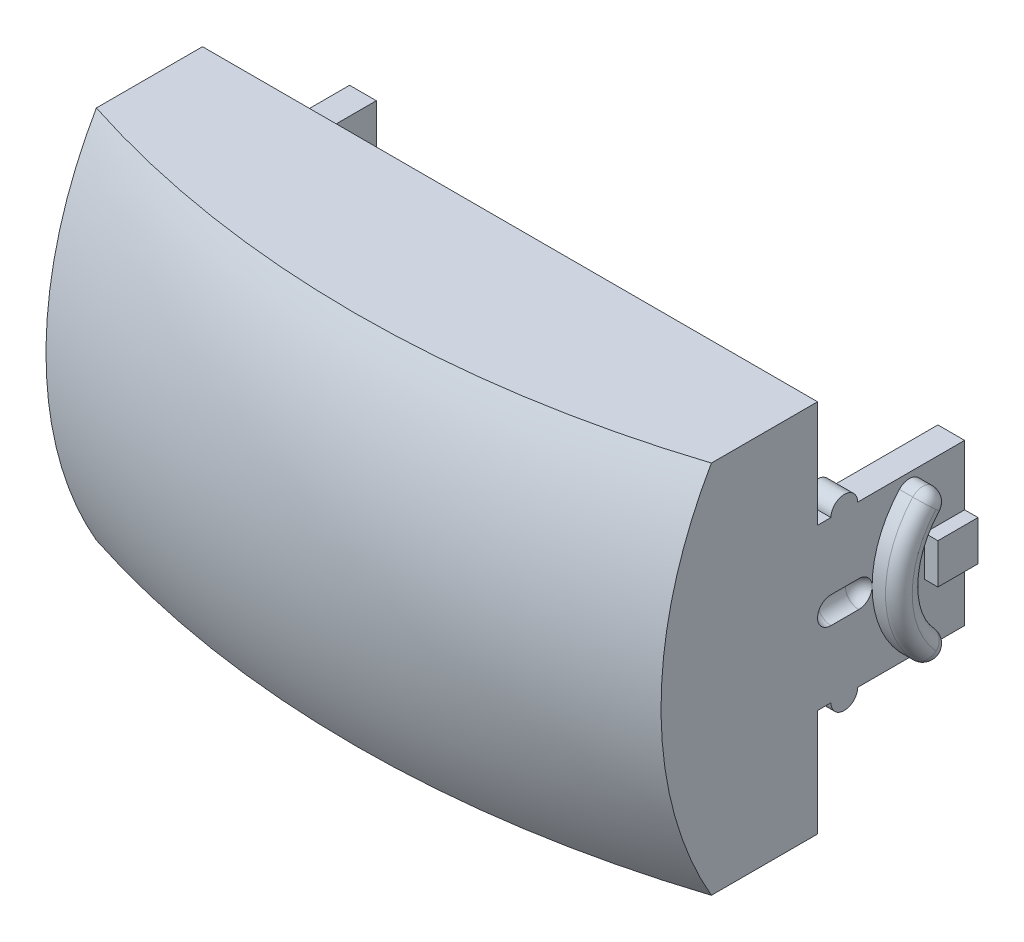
ISO-10303-21;
HEADER;
FILE_DESCRIPTION(('STEP AP214'),'2;1');
FILE_NAME('part.step','',(''),(''),'','','');
FILE_SCHEMA(('AUTOMOTIVE_DESIGN { 1 0 10303 214 1 1 1 1 }'));
ENDSEC;
DATA;
#1=APPLICATION_CONTEXT('core data for automotive mechanical design processes');
#2=APPLICATION_PROTOCOL_DEFINITION('international standard','automotive_design',2000,#1);
#3=PRODUCT_CONTEXT('',#1,'mechanical');
#4=PRODUCT('Part','Part','',(#3));
#5=PRODUCT_RELATED_PRODUCT_CATEGORY('part','',(#4));
#6=PRODUCT_DEFINITION_FORMATION('','',#4);
#7=PRODUCT_DEFINITION_CONTEXT('part definition',#1,'design');
#8=PRODUCT_DEFINITION('design','',#6,#7);
#9=PRODUCT_DEFINITION_SHAPE('','',#8);
#10=(LENGTH_UNIT() NAMED_UNIT(*) SI_UNIT(.MILLI.,.METRE.));
#11=(NAMED_UNIT(*) PLANE_ANGLE_UNIT() SI_UNIT($,.RADIAN.));
#12=(NAMED_UNIT(*) SI_UNIT($,.STERADIAN.) SOLID_ANGLE_UNIT());
#13=UNCERTAINTY_MEASURE_WITH_UNIT(LENGTH_MEASURE(1.E-05),#10,'distance_accuracy_value','');
#14=(GEOMETRIC_REPRESENTATION_CONTEXT(3) GLOBAL_UNCERTAINTY_ASSIGNED_CONTEXT((#13)) GLOBAL_UNIT_ASSIGNED_CONTEXT((#10,
#11,#12)) REPRESENTATION_CONTEXT('',''));
#15=CARTESIAN_POINT('',(0.,0.,0.));
#16=DIRECTION('',(0.,0.,1.));
#17=DIRECTION('',(1.,0.,0.));
#18=AXIS2_PLACEMENT_3D('',#15,#16,#17);
#19=CARTESIAN_POINT('',(-11.5,7.,15.));
#20=DIRECTION('',(1.,0.,0.));
#21=DIRECTION('',(0.,1.,0.));
#22=AXIS2_PLACEMENT_3D('',#19,#20,#21);
#23=PLANE('',#22);
#24=DIRECTION('',(0.,-1.,0.));
#25=VECTOR('',#24,1.);
#26=CARTESIAN_POINT('',(-11.5,0.750000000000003,-1.38880085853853));
#27=LINE('',#26,#25);
#28=CARTESIAN_POINT('',(-11.5,0.750000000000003,-1.38880085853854));
#29=VERTEX_POINT('',#28);
#30=CARTESIAN_POINT('',(-11.5,-0.749999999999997,-1.38880085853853));
#31=VERTEX_POINT('',#30);
#32=EDGE_CURVE('E54',#29,#31,#27,.T.);
#33=ORIENTED_EDGE('',*,*,#32,.T.);
#34=DIRECTION('',(0.,0.,-1.));
#35=VECTOR('',#34,1.);
#36=CARTESIAN_POINT('',(-11.5,-0.749999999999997,-2.88880085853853));
#37=LINE('',#36,#35);
#38=CARTESIAN_POINT('',(-11.5,-0.749999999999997,-2.88880085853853));
#39=VERTEX_POINT('',#38);
#40=EDGE_CURVE('E373',#31,#39,#37,.T.);
#41=ORIENTED_EDGE('',*,*,#40,.T.);
#42=DIRECTION('',(0.,-1.,0.));
#43=VECTOR('',#42,1.);
#44=CARTESIAN_POINT('',(-11.5,7.,-2.88880085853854));
#45=LINE('',#44,#43);
#46=CARTESIAN_POINT('',(-11.5,-3.,-2.88880085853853));
#47=VERTEX_POINT('',#46);
#48=EDGE_CURVE('E600',#39,#47,#45,.T.);
#49=ORIENTED_EDGE('',*,*,#48,.T.);
#50=DIRECTION('',(0.,0.,1.));
#51=VECTOR('',#50,1.);
#52=CARTESIAN_POINT('',(-11.5,-2.99999999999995,15.));
#53=LINE('',#52,#51);
#54=CARTESIAN_POINT('',(-11.5,-2.99999999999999,1.11119914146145));
#55=VERTEX_POINT('',#54);
#56=EDGE_CURVE('E605',#47,#55,#53,.T.);
#57=ORIENTED_EDGE('',*,*,#56,.T.);
#58=CARTESIAN_POINT('',(-11.5,-2.99999999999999,1.61119914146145));
#59=DIRECTION('',(1.,0.,0.));
#60=DIRECTION('',(0.,1.,0.));
#61=AXIS2_PLACEMENT_3D('',#58,#59,#60);
#62=CIRCLE('',#61,0.5);
#63=CARTESIAN_POINT('',(-11.5,-2.99999999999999,2.11119914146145));
#64=VERTEX_POINT('',#63);
#65=EDGE_CURVE('E610',#55,#64,#62,.F.);
#66=ORIENTED_EDGE('',*,*,#65,.T.);
#67=DIRECTION('',(0.,0.,1.));
#68=VECTOR('',#67,1.);
#69=CARTESIAN_POINT('',(-11.5,-2.99999999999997,15.));
#70=LINE('',#69,#68);
#71=CARTESIAN_POINT('',(-11.5,-2.99999999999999,2.61119914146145));
#72=VERTEX_POINT('',#71);
#73=EDGE_CURVE('E615',#64,#72,#70,.T.);
#74=ORIENTED_EDGE('',*,*,#73,.T.);
#75=DIRECTION('',(0.,-1.,0.));
#76=VECTOR('',#75,1.);
#77=CARTESIAN_POINT('',(-11.5,6.99999999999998,2.61119914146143));
#78=LINE('',#77,#76);
#79=CARTESIAN_POINT('',(-11.5,-7.,2.61119914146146));
#80=VERTEX_POINT('',#79);
#81=EDGE_CURVE('E625',#72,#80,#78,.T.);
#82=ORIENTED_EDGE('',*,*,#81,.T.);
#83=DIRECTION('',(0.,0.,-1.));
#84=VECTOR('',#83,1.);
#85=CARTESIAN_POINT('',(-11.5,-7.,15.));
#86=LINE('',#85,#84);
#87=CARTESIAN_POINT('',(-11.5,-7.,6.58119914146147));
#88=VERTEX_POINT('',#87);
#89=EDGE_CURVE('E902',#88,#80,#86,.T.);
#90=ORIENTED_EDGE('',*,*,#89,.F.);
#91=CARTESIAN_POINT('',(-11.5,0.,8.46547581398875));
#92=CARTESIAN_POINT('',(-11.5,0.393006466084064,8.46547378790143));
#93=CARTESIAN_POINT('',(-11.5,0.786158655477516,8.44877795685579));
#94=CARTESIAN_POINT('',(-11.5,1.56980664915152,8.38210818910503));
#95=CARTESIAN_POINT('',(-11.5,1.96030058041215,8.33211283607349));
#96=CARTESIAN_POINT('',(-11.5,2.73656089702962,8.19909085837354));
#97=CARTESIAN_POINT('',(-11.5,3.12231441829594,8.11598890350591));
#98=CARTESIAN_POINT('',(-11.5,3.88540800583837,7.91744682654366));
#99=CARTESIAN_POINT('',(-11.5,4.2627478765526,7.8020059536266));
#100=CARTESIAN_POINT('',(-11.5,5.0057303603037,7.53996588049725));
#101=CARTESIAN_POINT('',(-11.5,5.37139160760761,7.39341949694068));
#102=CARTESIAN_POINT('',(-11.5,6.08918046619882,7.07024585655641));
#103=CARTESIAN_POINT('',(-11.5,6.44130757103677,6.89361747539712));
#104=CARTESIAN_POINT('',(-11.5,7.12944423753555,6.51182860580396));
#105=CARTESIAN_POINT('',(-11.5,7.46546369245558,6.3066859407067));
#106=CARTESIAN_POINT('',(-11.5,8.1194482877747,5.8694142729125));
#107=CARTESIAN_POINT('',(-11.5,8.43741341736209,5.63728525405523));
#108=CARTESIAN_POINT('',(-11.5,9.05753855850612,5.14449667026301));
#109=CARTESIAN_POINT('',(-11.5,9.35942293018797,4.88349032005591));
#110=CARTESIAN_POINT('',(-11.5,9.9408021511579,4.33764430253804));
#111=CARTESIAN_POINT('',(-11.5,10.2202968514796,4.05280447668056));
#112=CARTESIAN_POINT('',(-11.5,10.7553771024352,3.46140669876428));
#113=CARTESIAN_POINT('',(-11.5,11.0109582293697,3.15484474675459));
#114=CARTESIAN_POINT('',(-11.5,11.496845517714,2.52231432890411));
#115=CARTESIAN_POINT('',(-11.5,11.7271510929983,2.19634541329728));
#116=CARTESIAN_POINT('',(-11.5,12.1701474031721,1.51391390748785));
#117=CARTESIAN_POINT('',(-11.5,12.3817620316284,1.15675275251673));
#118=CARTESIAN_POINT('',(-11.5,12.7756426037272,0.426612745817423));
#119=CARTESIAN_POINT('',(-11.5,12.9579079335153,0.0536335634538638));
#120=CARTESIAN_POINT('',(-11.5,13.2925439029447,-0.705524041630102));
#121=CARTESIAN_POINT('',(-11.5,13.4449119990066,-1.09170358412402));
#122=CARTESIAN_POINT('',(-11.5,13.7194801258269,-1.874629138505));
#123=CARTESIAN_POINT('',(-11.5,13.841679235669,-2.27137547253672));
#124=CARTESIAN_POINT('',(-11.5,14.0632617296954,-3.10031012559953));
#125=CARTESIAN_POINT('',(-11.5,14.1605156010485,-3.53306780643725));
#126=CARTESIAN_POINT('',(-11.5,14.3210056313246,-4.40482728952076));
#127=CARTESIAN_POINT('',(-11.5,14.3842404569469,-4.84382933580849));
#128=CARTESIAN_POINT('',(-11.5,14.4774148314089,-5.72541837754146));
#129=CARTESIAN_POINT('',(-11.5,14.5073476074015,-6.1680060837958));
#130=CARTESIAN_POINT('',(-11.5,14.5349123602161,-7.05420268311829));
#131=CARTESIAN_POINT('',(-11.5,14.5325403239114,-7.49781169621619));
#132=CARTESIAN_POINT('',(-11.5,14.4947558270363,-8.43340530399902));
#133=CARTESIAN_POINT('',(-11.5,14.4556715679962,-8.92524172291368));
#134=CARTESIAN_POINT('',(-11.5,14.3412144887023,-9.90464448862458));
#135=CARTESIAN_POINT('',(-11.5,14.2658392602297,-10.3922105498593));
#136=CARTESIAN_POINT('',(-11.5,14.0811978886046,-11.3608275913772));
#137=CARTESIAN_POINT('',(-11.5,13.9719325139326,-11.8418787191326));
#138=CARTESIAN_POINT('',(-11.5,13.7221464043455,-12.7958141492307));
#139=CARTESIAN_POINT('',(-11.5,13.5816205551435,-13.268697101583));
#140=CARTESIAN_POINT('',(-11.5,13.2289889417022,-14.3356737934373));
#141=CARTESIAN_POINT('',(-11.5,13.0078507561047,-14.9267818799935));
#142=CARTESIAN_POINT('',(-11.5,12.5255039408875,-16.0923770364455));
#143=CARTESIAN_POINT('',(-11.5,12.2642883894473,-16.6668612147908));
#144=CARTESIAN_POINT('',(-11.5,11.8477109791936,-17.5163693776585));
#145=CARTESIAN_POINT('',(-11.5,11.704698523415,-17.7975513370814));
#146=CARTESIAN_POINT('',(-11.5,11.4113705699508,-18.356080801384));
#147=CARTESIAN_POINT('',(-11.5,11.2610551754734,-18.6334283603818));
#148=CARTESIAN_POINT('',(-11.5,10.9541458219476,-19.1845951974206));
#149=CARTESIAN_POINT('',(-11.5,10.7975521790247,-19.4584146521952));
#150=CARTESIAN_POINT('',(-11.5,10.479190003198,-20.0030212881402));
#151=CARTESIAN_POINT('',(-11.5,10.317421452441,-20.2738084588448));
#152=CARTESIAN_POINT('',(-11.5,9.95570017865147,-20.8693705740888));
#153=CARTESIAN_POINT('',(-11.5,9.75483793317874,-21.193591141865));
#154=CARTESIAN_POINT('',(-11.5,9.34996035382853,-21.8400382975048));
#155=CARTESIAN_POINT('',(-11.5,9.14594504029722,-22.1622648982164));
#156=CARTESIAN_POINT('',(-11.5,8.7376689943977,-22.8074002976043));
#157=CARTESIAN_POINT('',(-11.5,8.53340850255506,-23.1303092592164));
#158=CARTESIAN_POINT('',(-11.5,8.23057916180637,-23.6168782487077));
#159=CARTESIAN_POINT('',(-11.5,8.13023464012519,-23.7794271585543));
#160=CARTESIAN_POINT('',(-11.5,7.93151427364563,-24.105721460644));
#161=CARTESIAN_POINT('',(-11.5,7.83313839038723,-24.269466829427));
#162=CARTESIAN_POINT('',(-11.5,7.59901663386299,-24.6669997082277));
#163=CARTESIAN_POINT('',(-11.5,7.4647115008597,-24.90164399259));
#164=CARTESIAN_POINT('',(-11.5,7.20525257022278,-25.3761252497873));
#165=CARTESIAN_POINT('',(-11.5,7.0801023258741,-25.6159641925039));
#166=CARTESIAN_POINT('',(-11.5,6.84420661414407,-26.1018252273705));
#167=CARTESIAN_POINT('',(-11.5,6.73341846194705,-26.3478262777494));
#168=CARTESIAN_POINT('',(-11.5,6.53247765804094,-26.8481334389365));
#169=CARTESIAN_POINT('',(-11.5,6.44230538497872,-27.1024313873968));
#170=CARTESIAN_POINT('',(-11.5,6.31977479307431,-27.5207123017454));
#171=CARTESIAN_POINT('',(-11.5,6.2784918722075,-27.6820683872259));
#172=CARTESIAN_POINT('',(-11.5,6.20894888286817,-28.0075935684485));
#173=CARTESIAN_POINT('',(-11.5,6.1806869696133,-28.1717622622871));
#174=CARTESIAN_POINT('',(-11.5,6.13892292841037,-28.5013837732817));
#175=CARTESIAN_POINT('',(-11.5,6.12536674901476,-28.6668296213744));
#176=CARTESIAN_POINT('',(-11.5,6.11372488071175,-28.9982719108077));
#177=CARTESIAN_POINT('',(-11.5,6.11563877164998,-29.1642683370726));
#178=CARTESIAN_POINT('',(-11.5,6.13479423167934,-29.4951697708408));
#179=CARTESIAN_POINT('',(-11.5,6.15201862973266,-29.660075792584));
#180=CARTESIAN_POINT('',(-11.5,6.20066702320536,-29.9877888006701));
#181=CARTESIAN_POINT('',(-11.5,6.23209510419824,-30.1505951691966));
#182=CARTESIAN_POINT('',(-11.5,6.30755142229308,-30.4739591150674));
#183=CARTESIAN_POINT('',(-11.5,6.3516336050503,-30.634503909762));
#184=CARTESIAN_POINT('',(-11.5,6.45030392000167,-30.9522322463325));
#185=CARTESIAN_POINT('',(-11.5,6.50488907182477,-31.1094167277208));
#186=CARTESIAN_POINT('',(-11.5,6.67045835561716,-31.547064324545));
#187=CARTESIAN_POINT('',(-11.5,6.79120481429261,-31.8238141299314));
#188=CARTESIAN_POINT('',(-11.5,7.05106049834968,-32.3686328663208));
#189=CARTESIAN_POINT('',(-11.5,7.19019023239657,-32.6366916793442));
#190=CARTESIAN_POINT('',(-11.5,7.4804356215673,-33.1674536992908));
#191=CARTESIAN_POINT('',(-11.5,7.6315937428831,-33.4301334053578));
#192=CARTESIAN_POINT('',(-11.5,7.94060014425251,-33.9513208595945));
#193=CARTESIAN_POINT('',(-11.5,8.09844547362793,-34.209830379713));
#194=CARTESIAN_POINT('',(-11.5,8.41899736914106,-34.7270753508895));
#195=CARTESIAN_POINT('',(-11.5,8.5817351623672,-34.985791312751));
#196=CARTESIAN_POINT('',(-11.5,8.90817156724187,-35.5026416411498));
#197=CARTESIAN_POINT('',(-11.5,9.07187025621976,-35.7607759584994));
#198=CARTESIAN_POINT('',(-11.5,9.39796206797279,-36.2771481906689));
#199=CARTESIAN_POINT('',(-11.5,9.56035714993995,-36.5353848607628));
#200=CARTESIAN_POINT('',(-11.5,9.88263682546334,-37.0534198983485));
#201=CARTESIAN_POINT('',(-11.5,10.0425214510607,-37.3132182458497));
#202=CARTESIAN_POINT('',(-11.5,10.4072202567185,-37.915610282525));
#203=CARTESIAN_POINT('',(-11.5,10.6106830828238,-38.2590271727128));
#204=CARTESIAN_POINT('',(-11.5,11.0086463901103,-38.9510387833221));
#205=CARTESIAN_POINT('',(-11.5,11.2031468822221,-39.2996334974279));
#206=CARTESIAN_POINT('',(-11.5,11.5811770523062,-40.003061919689));
#207=CARTESIAN_POINT('',(-11.5,11.7646989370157,-40.3578998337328));
#208=CARTESIAN_POINT('',(-11.5,12.1186582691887,-41.0740404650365));
#209=CARTESIAN_POINT('',(-11.5,12.2890965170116,-41.4353427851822));
#210=CARTESIAN_POINT('',(-11.5,12.6142916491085,-42.1628595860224));
#211=CARTESIAN_POINT('',(-11.5,12.769120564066,-42.5290417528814));
#212=CARTESIAN_POINT('',(-11.5,13.0623295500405,-43.2679318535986));
#213=CARTESIAN_POINT('',(-11.5,13.2007105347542,-43.640639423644));
#214=CARTESIAN_POINT('',(-11.5,13.4593580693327,-44.3921009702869));
#215=CARTESIAN_POINT('',(-11.5,13.5796338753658,-44.7708517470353));
#216=CARTESIAN_POINT('',(-11.5,13.8006243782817,-45.534014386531));
#217=CARTESIAN_POINT('',(-11.5,13.9013394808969,-45.9184261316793));
#218=CARTESIAN_POINT('',(-11.5,14.1096778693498,-46.8118733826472));
#219=CARTESIAN_POINT('',(-11.5,14.2098061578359,-47.3226865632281));
#220=CARTESIAN_POINT('',(-11.5,14.371036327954,-48.3503283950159));
#221=CARTESIAN_POINT('',(-11.5,14.4321491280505,-48.8671553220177));
#222=CARTESIAN_POINT('',(-11.5,14.5127688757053,-49.9043345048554));
#223=CARTESIAN_POINT('',(-11.5,14.5322577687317,-50.4246881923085));
#224=CARTESIAN_POINT('',(-11.5,14.5273260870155,-51.4652548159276));
#225=CARTESIAN_POINT('',(-11.5,14.5029044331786,-51.9854677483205));
#226=CARTESIAN_POINT('',(-11.5,14.4080455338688,-53.0254744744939));
#227=CARTESIAN_POINT('',(-11.5,14.3372820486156,-53.5452389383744));
#228=CARTESIAN_POINT('',(-11.5,14.1481827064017,-54.5761109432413));
#229=CARTESIAN_POINT('',(-11.5,14.0298455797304,-55.0872182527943));
#230=CARTESIAN_POINT('',(-11.5,13.7450366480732,-56.0957856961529));
#231=CARTESIAN_POINT('',(-11.5,13.5785737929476,-56.5932483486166));
#232=CARTESIAN_POINT('',(-11.5,13.1976256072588,-57.5694348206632));
#233=CARTESIAN_POINT('',(-11.5,12.9831466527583,-58.0481611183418));
#234=CARTESIAN_POINT('',(-11.5,12.5330785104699,-58.9305688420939));
#235=CARTESIAN_POINT('',(-11.5,12.3023530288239,-59.3367361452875));
#236=CARTESIAN_POINT('',(-11.5,11.8046484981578,-60.1262309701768));
#237=CARTESIAN_POINT('',(-11.5,11.5376718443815,-60.5095599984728));
#238=CARTESIAN_POINT('',(-11.5,10.9692560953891,-61.2494435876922));
#239=CARTESIAN_POINT('',(-11.5,10.6678356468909,-61.6060124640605));
#240=CARTESIAN_POINT('',(-11.5,10.0325539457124,-62.288977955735));
#241=CARTESIAN_POINT('',(-11.5,9.69869515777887,-62.6153768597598));
#242=CARTESIAN_POINT('',(-11.5,9.03371968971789,-63.2056875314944));
#243=CARTESIAN_POINT('',(-11.5,8.7052512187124,-63.4725880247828));
#244=CARTESIAN_POINT('',(-11.5,8.02608317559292,-63.9764120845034));
#245=CARTESIAN_POINT('',(-11.5,7.67538513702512,-64.2133377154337));
#246=CARTESIAN_POINT('',(-11.5,6.95440099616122,-64.6550138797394));
#247=CARTESIAN_POINT('',(-11.5,6.58411996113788,-64.8597726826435));
#248=CARTESIAN_POINT('',(-11.5,5.8266985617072,-65.2352965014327));
#249=CARTESIAN_POINT('',(-11.5,5.43955862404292,-65.4060623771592));
#250=CARTESIAN_POINT('',(-11.5,4.67128454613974,-65.7043059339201));
#251=CARTESIAN_POINT('',(-11.5,4.29082655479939,-65.8335279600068));
#252=CARTESIAN_POINT('',(-11.5,3.52020976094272,-66.0587622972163));
#253=CARTESIAN_POINT('',(-11.5,3.13005133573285,-66.1547758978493));
#254=CARTESIAN_POINT('',(-11.5,2.34295494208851,-66.3127561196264));
#255=CARTESIAN_POINT('',(-11.5,1.94601788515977,-66.3747272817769));
#256=CARTESIAN_POINT('',(-11.5,1.14826942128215,-66.4641036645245));
#257=CARTESIAN_POINT('',(-11.5,0.747458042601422,-66.4915091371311));
#258=CARTESIAN_POINT('',(-11.5,-0.0458483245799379,-66.5112878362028));
#259=CARTESIAN_POINT('',(-11.5,-0.438323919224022,-66.5044477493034));
#260=CARTESIAN_POINT('',(-11.5,-1.22128440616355,-66.4575965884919));
#261=CARTESIAN_POINT('',(-11.5,-1.61176933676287,-66.417586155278));
#262=CARTESIAN_POINT('',(-11.5,-2.38794356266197,-66.3047304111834));
#263=CARTESIAN_POINT('',(-11.5,-2.77363308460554,-66.231886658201));
#264=CARTESIAN_POINT('',(-11.5,-3.53750395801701,-66.0539679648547));
#265=CARTESIAN_POINT('',(-11.5,-3.91568527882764,-65.9488928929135));
#266=CARTESIAN_POINT('',(-11.5,-4.66104644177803,-65.7076500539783));
#267=CARTESIAN_POINT('',(-11.5,-5.02824924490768,-65.5715531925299));
#268=CARTESIAN_POINT('',(-11.5,-5.75003197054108,-65.2692403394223));
#269=CARTESIAN_POINT('',(-11.5,-6.10461196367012,-65.1030245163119));
#270=CARTESIAN_POINT('',(-11.5,-6.79878964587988,-64.7418030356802));
#271=CARTESIAN_POINT('',(-11.5,-7.13838715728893,-64.5467970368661));
#272=CARTESIAN_POINT('',(-11.5,-7.80040253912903,-64.1295349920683));
#273=CARTESIAN_POINT('',(-11.5,-8.12282017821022,-63.9072785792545));
#274=CARTESIAN_POINT('',(-11.5,-8.75375150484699,-63.4332701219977));
#275=CARTESIAN_POINT('',(-11.5,-9.06193877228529,-63.1810836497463));
#276=CARTESIAN_POINT('',(-11.5,-9.6565888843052,-62.6522944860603));
#277=CARTESIAN_POINT('',(-11.5,-9.94305158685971,-62.375691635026));
#278=CARTESIAN_POINT('',(-11.5,-10.4926288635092,-61.8001680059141));
#279=CARTESIAN_POINT('',(-11.5,-10.7557419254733,-61.5012457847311));
#280=CARTESIAN_POINT('',(-11.5,-11.2572136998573,-60.8833209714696));
#281=CARTESIAN_POINT('',(-11.5,-11.495571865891,-60.5643179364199));
#282=CARTESIAN_POINT('',(-11.5,-11.9549934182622,-59.8960324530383));
#283=CARTESIAN_POINT('',(-11.5,-12.1750524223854,-59.546059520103));
#284=CARTESIAN_POINT('',(-11.5,-12.5863149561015,-58.8295652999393));
#285=CARTESIAN_POINT('',(-11.5,-12.7775179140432,-58.4630436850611));
#286=CARTESIAN_POINT('',(-11.5,-13.130436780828,-57.7160294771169));
#287=CARTESIAN_POINT('',(-11.5,-13.2921490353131,-57.3355351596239));
#288=CARTESIAN_POINT('',(-11.5,-13.5857080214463,-56.5632076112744));
#289=CARTESIAN_POINT('',(-11.5,-13.7175538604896,-56.1713740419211));
#290=CARTESIAN_POINT('',(-11.5,-13.9589838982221,-55.3528852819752));
#291=CARTESIAN_POINT('',(-11.5,-14.0665405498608,-54.9256319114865));
#292=CARTESIAN_POINT('',(-11.5,-14.247930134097,-54.0640432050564));
#293=CARTESIAN_POINT('',(-11.5,-14.3217617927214,-53.629707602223));
#294=CARTESIAN_POINT('',(-11.5,-14.436304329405,-52.7566609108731));
#295=CARTESIAN_POINT('',(-11.5,-14.4770111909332,-52.3179492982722));
#296=CARTESIAN_POINT('',(-11.5,-14.5261924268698,-51.4387110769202));
#297=CARTESIAN_POINT('',(-11.5,-14.5346631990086,-50.9981842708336));
#298=CARTESIAN_POINT('',(-11.5,-14.5197679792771,-50.070356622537));
#299=CARTESIAN_POINT('',(-11.5,-14.4928860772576,-49.5831121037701));
#300=CARTESIAN_POINT('',(-11.5,-14.402932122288,-48.6119987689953));
#301=CARTESIAN_POINT('',(-11.5,-14.3398574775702,-48.1281301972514));
#302=CARTESIAN_POINT('',(-11.5,-14.1797270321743,-47.1659658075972));
#303=CARTESIAN_POINT('',(-11.5,-14.0826626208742,-46.687671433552));
#304=CARTESIAN_POINT('',(-11.5,-13.8570454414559,-45.7386220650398));
#305=CARTESIAN_POINT('',(-11.5,-13.7284925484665,-45.2678671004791));
#306=CARTESIAN_POINT('',(-11.5,-13.4293408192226,-44.2920030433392));
#307=CARTESIAN_POINT('',(-11.5,-13.2559496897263,-43.7877527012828));
#308=CARTESIAN_POINT('',(-11.5,-12.8785660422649,-42.7908934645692));
#309=CARTESIAN_POINT('',(-11.5,-12.6745717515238,-42.2982852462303));
#310=CARTESIAN_POINT('',(-11.5,-12.2400905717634,-41.3251531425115));
#311=CARTESIAN_POINT('',(-11.5,-12.0096127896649,-40.8446251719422));
#312=CARTESIAN_POINT('',(-11.5,-11.647294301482,-40.1323818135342));
#313=CARTESIAN_POINT('',(-11.5,-11.5237519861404,-39.8963877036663));
#314=CARTESIAN_POINT('',(-11.5,-11.2717186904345,-39.4270572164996));
#315=CARTESIAN_POINT('',(-11.5,-11.1432277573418,-39.1937208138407));
#316=CARTESIAN_POINT('',(-11.5,-10.784662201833,-38.5567230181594));
#317=CARTESIAN_POINT('',(-11.5,-10.5501614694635,-38.1555547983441));
#318=CARTESIAN_POINT('',(-11.5,-10.0716590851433,-37.3589312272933));
#319=CARTESIAN_POINT('',(-11.5,-9.82765658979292,-36.9634763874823));
#320=CARTESIAN_POINT('',(-11.5,-9.45784360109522,-36.372376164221));
#321=CARTESIAN_POINT('',(-11.5,-9.33386417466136,-36.1755753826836));
#322=CARTESIAN_POINT('',(-11.5,-9.08540156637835,-35.7822916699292));
#323=CARTESIAN_POINT('',(-11.5,-8.96091838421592,-35.58580873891));
#324=CARTESIAN_POINT('',(-11.5,-8.71229366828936,-35.1926562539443));
#325=CARTESIAN_POINT('',(-11.5,-8.58815209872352,-34.9959867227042));
#326=CARTESIAN_POINT('',(-11.5,-8.34122106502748,-34.6017991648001));
#327=CARTESIAN_POINT('',(-11.5,-8.21843159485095,-34.4042811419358));
#328=CARTESIAN_POINT('',(-11.5,-7.94875934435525,-33.964030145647));
#329=CARTESIAN_POINT('',(-11.5,-7.8025145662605,-33.7209035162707));
#330=CARTESIAN_POINT('',(-11.5,-7.51691456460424,-33.2304815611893));
#331=CARTESIAN_POINT('',(-11.5,-7.37756161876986,-32.9831848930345));
#332=CARTESIAN_POINT('',(-11.5,-7.11019014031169,-32.4826963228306));
#333=CARTESIAN_POINT('',(-11.5,-6.98216348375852,-32.2295088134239));
#334=CARTESIAN_POINT('',(-11.5,-6.74346379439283,-31.7150588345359));
#335=CARTESIAN_POINT('',(-11.5,-6.63277819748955,-31.4538023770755));
#336=CARTESIAN_POINT('',(-11.5,-6.47598836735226,-31.0275058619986));
#337=CARTESIAN_POINT('',(-11.5,-6.42170092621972,-30.8654945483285));
#338=CARTESIAN_POINT('',(-11.5,-6.32464502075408,-30.5380849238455));
#339=CARTESIAN_POINT('',(-11.5,-6.28187117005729,-30.3726882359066));
#340=CARTESIAN_POINT('',(-11.5,-6.2101563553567,-30.0397316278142));
#341=CARTESIAN_POINT('',(-11.5,-6.18114786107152,-29.8721864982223));
#342=CARTESIAN_POINT('',(-11.5,-6.13843268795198,-29.5351401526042));
#343=CARTESIAN_POINT('',(-11.5,-6.12472404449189,-29.3656391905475));
#344=CARTESIAN_POINT('',(-11.5,-6.11351532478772,-29.0248675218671));
#345=CARTESIAN_POINT('',(-11.5,-6.11613265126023,-28.8535928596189));
#346=CARTESIAN_POINT('',(-11.5,-6.13766246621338,-28.5120703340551));
#347=CARTESIAN_POINT('',(-11.5,-6.15657717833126,-28.341822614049));
#348=CARTESIAN_POINT('',(-11.5,-6.20952689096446,-28.0029752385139));
#349=CARTESIAN_POINT('',(-11.5,-6.24362769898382,-27.8343860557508));
#350=CARTESIAN_POINT('',(-11.5,-6.32493522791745,-27.5005161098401));
#351=CARTESIAN_POINT('',(-11.5,-6.37213787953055,-27.3352343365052));
#352=CARTESIAN_POINT('',(-11.5,-6.51382315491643,-26.8950609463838));
#353=CARTESIAN_POINT('',(-11.5,-6.61842305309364,-26.6234457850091));
#354=CARTESIAN_POINT('',(-11.5,-6.84888083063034,-26.089274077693));
#355=CARTESIAN_POINT('',(-11.5,-6.97476916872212,-25.8267311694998));
#356=CARTESIAN_POINT('',(-11.5,-7.24095060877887,-25.3075510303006));
#357=CARTESIAN_POINT('',(-11.5,-7.38131050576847,-25.050948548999));
#358=CARTESIAN_POINT('',(-11.5,-7.67058169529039,-24.5428609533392));
#359=CARTESIAN_POINT('',(-11.5,-7.81948840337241,-24.2913731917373));
#360=CARTESIAN_POINT('',(-11.5,-8.1244142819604,-23.7878153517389));
#361=CARTESIAN_POINT('',(-11.5,-8.28050494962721,-23.5357889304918));
#362=CARTESIAN_POINT('',(-11.5,-8.59500454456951,-23.0331638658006));
#363=CARTESIAN_POINT('',(-11.5,-8.75341369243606,-22.7825653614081));
#364=CARTESIAN_POINT('',(-11.5,-9.07003054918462,-22.2821864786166));
#365=CARTESIAN_POINT('',(-11.5,-9.22823765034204,-22.0324057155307));
#366=CARTESIAN_POINT('',(-11.5,-9.54326023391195,-21.5319723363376));
#367=CARTESIAN_POINT('',(-11.5,-9.70007574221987,-21.2813197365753));
#368=CARTESIAN_POINT('',(-11.5,-10.0684940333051,-20.6852948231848));
#369=CARTESIAN_POINT('',(-11.5,-10.2789061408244,-20.3391815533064));
#370=CARTESIAN_POINT('',(-11.5,-10.6918045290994,-19.6422356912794));
#371=CARTESIAN_POINT('',(-11.5,-10.8942908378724,-19.2914031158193));
#372=CARTESIAN_POINT('',(-11.5,-11.2891245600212,-18.5836503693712));
#373=CARTESIAN_POINT('',(-11.5,-11.4814629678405,-18.2267251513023));
#374=CARTESIAN_POINT('',(-11.5,-11.8536597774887,-17.5064288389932));
#375=CARTESIAN_POINT('',(-11.5,-12.0335189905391,-17.1430581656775));
#376=CARTESIAN_POINT('',(-11.5,-12.3775245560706,-16.4122188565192));
#377=CARTESIAN_POINT('',(-11.5,-12.5417775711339,-16.0448006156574));
#378=CARTESIAN_POINT('',(-11.5,-12.8542518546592,-15.3032096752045));
#379=CARTESIAN_POINT('',(-11.5,-13.0024740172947,-14.9290373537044));
#380=CARTESIAN_POINT('',(-11.5,-13.2811119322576,-14.1743222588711));
#381=CARTESIAN_POINT('',(-11.5,-13.4115372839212,-13.793783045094));
#382=CARTESIAN_POINT('',(-11.5,-13.6530478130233,-13.0266196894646));
#383=CARTESIAN_POINT('',(-11.5,-13.7641334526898,-12.6399956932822));
#384=CARTESIAN_POINT('',(-11.5,-13.9967615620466,-11.7401145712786));
#385=CARTESIAN_POINT('',(-11.5,-14.1108024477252,-11.2248873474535));
#386=CARTESIAN_POINT('',(-11.5,-14.2997381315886,-10.1874115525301));
#387=CARTESIAN_POINT('',(-11.5,-14.3746440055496,-9.66516501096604));
#388=CARTESIAN_POINT('',(-11.5,-14.4825403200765,-8.61577048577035));
#389=CARTESIAN_POINT('',(-11.5,-14.5154893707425,-8.08861817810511));
#390=CARTESIAN_POINT('',(-11.5,-14.5368502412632,-7.0333435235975));
#391=CARTESIAN_POINT('',(-11.5,-14.5252612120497,-6.50522115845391));
#392=CARTESIAN_POINT('',(-11.5,-14.4552908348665,-5.44815275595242));
#393=CARTESIAN_POINT('',(-11.5,-14.3965688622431,-4.91922879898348));
#394=CARTESIAN_POINT('',(-11.5,-14.2304384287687,-3.86900721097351));
#395=CARTESIAN_POINT('',(-11.5,-14.1230285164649,-3.34770980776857));
#396=CARTESIAN_POINT('',(-11.5,-13.8587628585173,-2.31791111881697));
#397=CARTESIAN_POINT('',(-11.5,-13.7019213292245,-1.80940619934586));
#398=CARTESIAN_POINT('',(-11.5,-13.3387236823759,-0.810398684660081));
#399=CARTESIAN_POINT('',(-11.5,-13.132374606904,-0.319893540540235));
#400=CARTESIAN_POINT('',(-11.5,-12.6972892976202,0.582876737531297));
#401=CARTESIAN_POINT('',(-11.5,-12.4738048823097,0.997677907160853));
#402=CARTESIAN_POINT('',(-11.5,-11.9896396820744,1.80496183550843));
#403=CARTESIAN_POINT('',(-11.5,-11.7289614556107,2.19744612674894));
#404=CARTESIAN_POINT('',(-11.5,-11.1720782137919,2.95606464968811));
#405=CARTESIAN_POINT('',(-11.5,-10.8758973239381,3.32221650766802));
#406=CARTESIAN_POINT('',(-11.5,-10.4066196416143,3.84890471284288));
#407=CARTESIAN_POINT('',(-11.5,-10.2460206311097,4.02071585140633));
#408=CARTESIAN_POINT('',(-11.5,-9.91671130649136,4.35648200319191));
#409=CARTESIAN_POINT('',(-11.5,-9.74799868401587,4.52043475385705));
#410=CARTESIAN_POINT('',(-11.5,-9.26393547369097,4.96857074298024));
#411=CARTESIAN_POINT('',(-11.5,-8.93980288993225,5.24337274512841));
#412=CARTESIAN_POINT('',(-11.5,-8.26860386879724,5.76326559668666));
#413=CARTESIAN_POINT('',(-11.5,-7.92153871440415,6.00835810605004));
#414=CARTESIAN_POINT('',(-11.5,-7.20680464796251,6.46675060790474));
#415=CARTESIAN_POINT('',(-11.5,-6.83912811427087,6.68003873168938));
#416=CARTESIAN_POINT('',(-11.5,-6.08611281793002,7.07270803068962));
#417=CARTESIAN_POINT('',(-11.5,-5.70077526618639,7.25209152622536));
#418=CARTESIAN_POINT('',(-11.5,-4.9356080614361,7.56698458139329));
#419=CARTESIAN_POINT('',(-11.5,-4.55650902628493,7.70427210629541));
#420=CARTESIAN_POINT('',(-11.5,-3.78789481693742,7.94563734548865));
#421=CARTESIAN_POINT('',(-11.5,-3.39838037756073,8.04971739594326));
#422=CARTESIAN_POINT('',(-11.5,-2.61279687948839,8.2235574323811));
#423=CARTESIAN_POINT('',(-11.5,-2.21674636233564,8.29340145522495));
#424=CARTESIAN_POINT('',(-11.5,-1.42026513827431,8.39851269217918));
#425=CARTESIAN_POINT('',(-11.5,-1.01983752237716,8.43380289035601));
#426=CARTESIAN_POINT('',(-11.5,-0.515720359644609,8.4562832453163));
#427=CARTESIAN_POINT('',(-11.5,-0.412609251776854,8.45972982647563));
#428=CARTESIAN_POINT('',(-11.5,-0.206335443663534,8.46432637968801));
#429=CARTESIAN_POINT('',(-11.5,-0.103172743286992,8.46547634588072));
#430=CARTESIAN_POINT('',(-11.5,0.,8.46547581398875));
#431=B_SPLINE_CURVE_WITH_KNOTS('',3,(#91,#92,#93,#94,#95,#96,#97,#98,#99,#100,#101,#102,#103,
#104,#105,#106,#107,#108,#109,#110,#111,#112,#113,#114,#115,#116,#117,#118,#119,#120,#121,#122,
#123,#124,#125,#126,#127,#128,#129,#130,#131,#132,#133,#134,#135,#136,#137,#138,#139,#140,#141,
#142,#143,#144,#145,#146,#147,#148,#149,#150,#151,#152,#153,#154,#155,#156,#157,#158,#159,#160,
#161,#162,#163,#164,#165,#166,#167,#168,#169,#170,#171,#172,#173,#174,#175,#176,#177,#178,#179,
#180,#181,#182,#183,#184,#185,#186,#187,#188,#189,#190,#191,#192,#193,#194,#195,#196,#197,#198,
#199,#200,#201,#202,#203,#204,#205,#206,#207,#208,#209,#210,#211,#212,#213,#214,#215,#216,#217,
#218,#219,#220,#221,#222,#223,#224,#225,#226,#227,#228,#229,#230,#231,#232,#233,#234,#235,#236,
#237,#238,#239,#240,#241,#242,#243,#244,#245,#246,#247,#248,#249,#250,#251,#252,#253,#254,#255,
#256,#257,#258,#259,#260,#261,#262,#263,#264,#265,#266,#267,#268,#269,#270,#271,#272,#273,#274,
#275,#276,#277,#278,#279,#280,#281,#282,#283,#284,#285,#286,#287,#288,#289,#290,#291,#292,#293,
#294,#295,#296,#297,#298,#299,#300,#301,#302,#303,#304,#305,#306,#307,#308,#309,#310,#311,#312,
#313,#314,#315,#316,#317,#318,#319,#320,#321,#322,#323,#324,#325,#326,#327,#328,#329,#330,#331,
#332,#333,#334,#335,#336,#337,#338,#339,#340,#341,#342,#343,#344,#345,#346,#347,#348,#349,#350,
#351,#352,#353,#354,#355,#356,#357,#358,#359,#360,#361,#362,#363,#364,#365,#366,#367,#368,#369,
#370,#371,#372,#373,#374,#375,#376,#377,#378,#379,#380,#381,#382,#383,#384,#385,#386,#387,#388,
#389,#390,#391,#392,#393,#394,#395,#396,#397,#398,#399,#400,#401,#402,#403,#404,#405,#406,#407,
#408,#409,#410,#411,#412,#413,#414,#415,#416,#417,#418,#419,#420,#421,#422,#423,#424,#425,#426,
#427,#428,#429,#430),.UNSPECIFIED.,.T.,.F.,(4,2,2,2,2,2,2,2,2,2,2,2,2,2,2,2,2,2,2,2,2,2,2,2,2,2,
2,2,2,2,2,2,2,2,2,2,2,2,2,2,2,2,2,2,2,2,2,2,2,2,2,2,2,2,2,2,2,2,2,2,2,2,2,2,2,2,2,2,2,2,2,2,2,2,
2,2,2,2,2,2,2,2,2,2,2,2,2,2,2,2,2,2,2,2,2,2,2,2,2,2,2,2,2,2,2,2,2,2,2,2,2,2,2,2,2,2,2,2,2,2,2,2,
2,2,2,2,2,2,2,2,2,2,2,2,2,2,2,2,2,2,2,2,2,2,2,2,2,2,2,2,2,2,2,2,2,2,2,2,2,2,2,2,2,2,2,2,2,2,2,
4),(0.,1.17891827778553,2.3585955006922,3.54097241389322,4.72337678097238,5.90378927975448,
7.08424590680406,8.26396796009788,9.44369071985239,10.6395482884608,11.8354138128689,
13.0315001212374,14.2276141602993,15.4716730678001,16.7157579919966,17.9599487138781,
19.2041774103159,20.5334232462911,21.8627211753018,23.1922894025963,24.5220227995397,
26.0007282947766,27.4795319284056,28.958302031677,30.4373142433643,32.3289063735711,
34.2208255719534,35.167121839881,36.1134047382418,37.0596400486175,38.0058786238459,
39.1500338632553,40.2941817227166,41.4404379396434,42.0135076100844,42.5865660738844,
43.3975278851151,44.2088028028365,45.0176084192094,45.825641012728,46.3248573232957,
46.8240028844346,47.3213075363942,47.818598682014,48.3153328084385,48.8122099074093,
49.3112375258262,49.8101237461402,50.7147732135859,51.6204405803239,52.5294608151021,
53.438084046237,54.3550036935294,55.2719981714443,56.1871546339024,57.1022994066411,
58.2996903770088,59.497079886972,60.6953095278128,61.8934658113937,63.0858123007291,
64.2780925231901,65.4697611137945,66.6614049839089,68.2215519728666,69.7812621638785,
71.3416487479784,72.9020736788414,74.4736036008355,76.0451754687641,77.6164552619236,
79.1875265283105,80.5870163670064,81.9864137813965,83.3850571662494,84.7835943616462,
86.0516986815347,87.3197156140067,88.5874060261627,89.8550643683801,91.0590079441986,
92.2629047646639,93.4666409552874,94.6703683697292,95.8465724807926,97.0227538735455,
98.1988794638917,99.375009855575,100.548478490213,101.721940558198,102.895416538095,
104.068908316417,105.262201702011,106.45550288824,107.648881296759,108.842286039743,
110.081140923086,111.320020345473,112.559053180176,113.798123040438,115.118469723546,
116.438866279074,117.759422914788,119.080127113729,120.542633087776,122.005243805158,
123.468225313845,124.931212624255,126.529764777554,128.128409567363,129.726506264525,
130.52558512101,131.324656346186,132.718484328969,134.112436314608,134.810228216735,
135.508020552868,136.20573673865,136.903449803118,137.754555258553,138.605940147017,
139.456709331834,140.306859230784,140.819115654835,141.331132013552,141.840609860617,
142.350022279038,142.863102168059,143.376252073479,143.891647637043,144.406883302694,
145.278571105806,146.15151680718,147.028689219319,147.905395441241,148.794712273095,
149.684114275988,150.57111924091,151.458107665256,152.673193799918,153.888275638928,
155.104418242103,156.320481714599,157.527524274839,158.73449947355,159.940821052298,
161.147113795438,162.728755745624,164.30994982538,165.892702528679,167.475485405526,
169.069810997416,170.664184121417,172.258099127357,173.851787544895,175.263383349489,
176.674882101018,178.085427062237,178.790743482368,179.49626176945,180.769335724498,
182.042338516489,183.315815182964,184.589204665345,185.797303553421,187.005317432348,
188.210351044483,189.414582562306,189.724073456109,190.033565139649),.UNSPECIFIED.);
#432=CARTESIAN_POINT('',(-11.5,7.,6.58119914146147));
#433=VERTEX_POINT('',#432);
#434=EDGE_CURVE('E682',#88,#433,#431,.T.);
#435=ORIENTED_EDGE('',*,*,#434,.T.);
#436=DIRECTION('',(0.,0.,-1.));
#437=VECTOR('',#436,1.);
#438=CARTESIAN_POINT('',(-11.5,7.,15.));
#439=LINE('',#438,#437);
#440=CARTESIAN_POINT('',(-11.5,7.,2.61119914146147));
#441=VERTEX_POINT('',#440);
#442=EDGE_CURVE('E899',#433,#441,#439,.T.);
#443=ORIENTED_EDGE('',*,*,#442,.T.);
#444=DIRECTION('',(0.,-1.,0.));
#445=VECTOR('',#444,1.);
#446=CARTESIAN_POINT('',(-11.5,7.,2.61119914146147));
#447=LINE('',#446,#445);
#448=CARTESIAN_POINT('',(-11.5,2.99999999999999,2.61119914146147));
#449=VERTEX_POINT('',#448);
#450=EDGE_CURVE('E580',#441,#449,#447,.T.);
#451=ORIENTED_EDGE('',*,*,#450,.T.);
#452=DIRECTION('',(0.,0.,-1.));
#453=VECTOR('',#452,1.);
#454=CARTESIAN_POINT('',(-11.5,2.99999999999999,15.));
#455=LINE('',#454,#453);
#456=CARTESIAN_POINT('',(-11.5,2.99999999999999,2.11119914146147));
#457=VERTEX_POINT('',#456);
#458=EDGE_CURVE('E585',#449,#457,#455,.T.);
#459=ORIENTED_EDGE('',*,*,#458,.T.);
#460=CARTESIAN_POINT('',(-11.5,2.99999999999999,1.61119914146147));
#461=DIRECTION('',(1.,0.,0.));
#462=DIRECTION('',(0.,1.,0.));
#463=AXIS2_PLACEMENT_3D('',#460,#461,#462);
#464=CIRCLE('',#463,0.5);
#465=CARTESIAN_POINT('',(-11.5,2.99999999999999,1.11119914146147));
#466=VERTEX_POINT('',#465);
#467=EDGE_CURVE('E590',#457,#466,#464,.F.);
#468=ORIENTED_EDGE('',*,*,#467,.T.);
#469=DIRECTION('',(0.,0.,-1.));
#470=VECTOR('',#469,1.);
#471=CARTESIAN_POINT('',(-11.5,2.99999999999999,15.));
#472=LINE('',#471,#470);
#473=CARTESIAN_POINT('',(-11.5,2.99999999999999,-2.88880085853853));
#474=VERTEX_POINT('',#473);
#475=EDGE_CURVE('E595',#466,#474,#472,.T.);
#476=ORIENTED_EDGE('',*,*,#475,.T.);
#477=CARTESIAN_POINT('',(-11.5,0.750000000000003,-2.88880085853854));
#478=VERTEX_POINT('',#477);
#479=EDGE_CURVE('E601',#474,#478,#45,.T.);
#480=ORIENTED_EDGE('',*,*,#479,.T.);
#481=DIRECTION('',(0.,0.,1.));
#482=VECTOR('',#481,1.);
#483=CARTESIAN_POINT('',(-11.5,0.750000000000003,-2.88880085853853));
#484=LINE('',#483,#482);
#485=EDGE_CURVE('E376',#478,#29,#484,.T.);
#486=ORIENTED_EDGE('',*,*,#485,.T.);
#487=EDGE_LOOP('',(#33,#41,#49,#57,#66,#74,#82,#90,#435,#443,#451,#459,#468,#476,#480,#486));
#488=FACE_BOUND('',#487,.T.);
#489=DIRECTION('',(0.,0.,-1.));
#490=VECTOR('',#489,1.);
#491=CARTESIAN_POINT('',(-11.5,-0.499999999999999,2.11119914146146));
#492=LINE('',#491,#490);
#493=CARTESIAN_POINT('',(-11.5,-0.499999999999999,2.11119914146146));
#494=VERTEX_POINT('',#493);
#495=CARTESIAN_POINT('',(-11.5,-0.499999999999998,1.07119914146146));
#496=VERTEX_POINT('',#495);
#497=EDGE_CURVE('E361',#494,#496,#492,.T.);
#498=ORIENTED_EDGE('',*,*,#497,.T.);
#499=CARTESIAN_POINT('',(-11.5,0.,1.07119914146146));
#500=DIRECTION('',(1.,0.,0.));
#501=DIRECTION('',(0.,-1.,0.));
#502=AXIS2_PLACEMENT_3D('',#499,#500,#501);
#503=CIRCLE('',#502,0.5);
#504=CARTESIAN_POINT('',(-11.5,0.,0.571199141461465));
#505=VERTEX_POINT('',#504);
#506=EDGE_CURVE('E370',#496,#505,#503,.T.);
#507=ORIENTED_EDGE('',*,*,#506,.T.);
#508=CARTESIAN_POINT('',(-11.5,0.,-3.32880085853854));
#509=DIRECTION('',(1.,0.,0.));
#510=DIRECTION('',(0.,1.,0.));
#511=AXIS2_PLACEMENT_3D('',#508,#509,#510);
#512=CIRCLE('',#511,3.9);
#513=CARTESIAN_POINT('',(-11.5,-2.63082833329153,-0.449783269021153));
#514=VERTEX_POINT('',#513);
#515=EDGE_CURVE('E423',#505,#514,#512,.T.);
#516=ORIENTED_EDGE('',*,*,#515,.T.);
#517=CARTESIAN_POINT('',(-11.5,-2.29354264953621,-0.818888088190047));
#518=DIRECTION('',(1.,0.,0.));
#519=DIRECTION('',(0.,-1.,0.));
#520=AXIS2_PLACEMENT_3D('',#517,#518,#519);
#521=CIRCLE('',#520,0.5);
#522=CARTESIAN_POINT('',(-11.5,-1.95625696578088,-1.18799290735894));
#523=VERTEX_POINT('',#522);
#524=EDGE_CURVE('E420',#514,#523,#521,.T.);
#525=ORIENTED_EDGE('',*,*,#524,.T.);
#526=CARTESIAN_POINT('',(-11.5,0.,-3.32880085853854));
#527=DIRECTION('',(-1.,0.,0.));
#528=DIRECTION('',(0.,1.,0.));
#529=AXIS2_PLACEMENT_3D('',#526,#527,#528);
#530=CIRCLE('',#529,2.9);
#531=CARTESIAN_POINT('',(-11.5,1.95625696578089,-1.18799290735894));
#532=VERTEX_POINT('',#531);
#533=EDGE_CURVE('E417',#523,#532,#530,.T.);
#534=ORIENTED_EDGE('',*,*,#533,.T.);
#535=CARTESIAN_POINT('',(-11.5,2.29354264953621,-0.818888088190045));
#536=DIRECTION('',(1.,0.,0.));
#537=DIRECTION('',(0.,1.,0.));
#538=AXIS2_PLACEMENT_3D('',#535,#536,#537);
#539=CIRCLE('',#538,0.5);
#540=CARTESIAN_POINT('',(-11.5,2.63082833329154,-0.44978326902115));
#541=VERTEX_POINT('',#540);
#542=EDGE_CURVE('E414',#532,#541,#539,.T.);
#543=ORIENTED_EDGE('',*,*,#542,.T.);
#544=EDGE_CURVE('E424',#541,#505,#512,.T.);
#545=ORIENTED_EDGE('',*,*,#544,.T.);
#546=CARTESIAN_POINT('',(-11.5,0.500000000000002,1.07119914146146));
#547=VERTEX_POINT('',#546);
#548=EDGE_CURVE('E369',#505,#547,#503,.T.);
#549=ORIENTED_EDGE('',*,*,#548,.T.);
#550=DIRECTION('',(0.,0.,1.));
#551=VECTOR('',#550,1.);
#552=CARTESIAN_POINT('',(-11.5,0.500000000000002,2.11119914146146));
#553=LINE('',#552,#551);
#554=CARTESIAN_POINT('',(-11.5,0.500000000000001,2.11119914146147));
#555=VERTEX_POINT('',#554);
#556=EDGE_CURVE('E46',#547,#555,#553,.T.);
#557=ORIENTED_EDGE('',*,*,#556,.T.);
#558=CARTESIAN_POINT('',(-11.5,0.,2.11119914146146));
#559=DIRECTION('',(1.,0.,0.));
#560=DIRECTION('',(0.,1.,0.));
#561=AXIS2_PLACEMENT_3D('',#558,#559,#560);
#562=CIRCLE('',#561,0.5);
#563=EDGE_CURVE('E348',#555,#494,#562,.T.);
#564=ORIENTED_EDGE('',*,*,#563,.T.);
#565=EDGE_LOOP('',(#498,#507,#516,#525,#534,#543,#545,#549,#557,#564));
#566=FACE_BOUND('',#565,.T.);
#567=ADVANCED_FACE('F31',(#488,#566),#23,.F.);
#568=CARTESIAN_POINT('',(11.5,7.,15.));
#569=DIRECTION('',(-1.,0.,0.));
#570=DIRECTION('',(0.,-1.,0.));
#571=AXIS2_PLACEMENT_3D('',#568,#569,#570);
#572=PLANE('',#571);
#573=DIRECTION('',(0.,0.,-1.));
#574=VECTOR('',#573,1.);
#575=CARTESIAN_POINT('',(11.5,-0.499999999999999,2.11119914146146));
#576=LINE('',#575,#574);
#577=CARTESIAN_POINT('',(11.5,-0.499999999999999,2.11119914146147));
#578=VERTEX_POINT('',#577);
#579=CARTESIAN_POINT('',(11.5,-0.499999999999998,1.07119914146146));
#580=VERTEX_POINT('',#579);
#581=EDGE_CURVE('E451',#578,#580,#576,.T.);
#582=ORIENTED_EDGE('',*,*,#581,.F.);
#583=CARTESIAN_POINT('',(11.5,0.,2.11119914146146));
#584=DIRECTION('',(1.,0.,0.));
#585=DIRECTION('',(0.,1.,0.));
#586=AXIS2_PLACEMENT_3D('',#583,#584,#585);
#587=CIRCLE('',#586,0.5);
#588=CARTESIAN_POINT('',(11.5,0.500000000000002,2.11119914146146));
#589=VERTEX_POINT('',#588);
#590=EDGE_CURVE('E448',#589,#578,#587,.T.);
#591=ORIENTED_EDGE('',*,*,#590,.F.);
#592=DIRECTION('',(0.,0.,1.));
#593=VECTOR('',#592,1.);
#594=CARTESIAN_POINT('',(11.5,0.500000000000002,2.11119914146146));
#595=LINE('',#594,#593);
#596=CARTESIAN_POINT('',(11.5,0.500000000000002,1.07119914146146));
#597=VERTEX_POINT('',#596);
#598=EDGE_CURVE('E458',#597,#589,#595,.T.);
#599=ORIENTED_EDGE('',*,*,#598,.F.);
#600=CARTESIAN_POINT('',(11.5,0.,1.07119914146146));
#601=DIRECTION('',(1.,0.,0.));
#602=DIRECTION('',(0.,-1.,0.));
#603=AXIS2_PLACEMENT_3D('',#600,#601,#602);
#604=CIRCLE('',#603,0.5);
#605=CARTESIAN_POINT('',(11.5,0.,0.571199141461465));
#606=VERTEX_POINT('',#605);
#607=EDGE_CURVE('E454',#606,#597,#604,.T.);
#608=ORIENTED_EDGE('',*,*,#607,.F.);
#609=CARTESIAN_POINT('',(11.5,0.,-3.32880085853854));
#610=DIRECTION('',(1.,0.,0.));
#611=DIRECTION('',(0.,1.,0.));
#612=AXIS2_PLACEMENT_3D('',#609,#610,#611);
#613=CIRCLE('',#612,3.9);
#614=CARTESIAN_POINT('',(11.5,2.63082833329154,-0.44978326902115));
#615=VERTEX_POINT('',#614);
#616=EDGE_CURVE('E503',#615,#606,#613,.T.);
#617=ORIENTED_EDGE('',*,*,#616,.F.);
#618=CARTESIAN_POINT('',(11.5,2.29354264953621,-0.818888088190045));
#619=DIRECTION('',(1.,0.,0.));
#620=DIRECTION('',(0.,1.,0.));
#621=AXIS2_PLACEMENT_3D('',#618,#619,#620);
#622=CIRCLE('',#621,0.5);
#623=CARTESIAN_POINT('',(11.5,1.95625696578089,-1.18799290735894));
#624=VERTEX_POINT('',#623);
#625=EDGE_CURVE('E499',#624,#615,#622,.T.);
#626=ORIENTED_EDGE('',*,*,#625,.F.);
#627=CARTESIAN_POINT('',(11.5,0.,-3.32880085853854));
#628=DIRECTION('',(-1.,0.,0.));
#629=DIRECTION('',(0.,1.,0.));
#630=AXIS2_PLACEMENT_3D('',#627,#628,#629);
#631=CIRCLE('',#630,2.9);
#632=CARTESIAN_POINT('',(11.5,-1.95625696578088,-1.18799290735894));
#633=VERTEX_POINT('',#632);
#634=EDGE_CURVE('E509',#633,#624,#631,.T.);
#635=ORIENTED_EDGE('',*,*,#634,.F.);
#636=CARTESIAN_POINT('',(11.5,-2.29354264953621,-0.818888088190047));
#637=DIRECTION('',(1.,0.,0.));
#638=DIRECTION('',(0.,-1.,0.));
#639=AXIS2_PLACEMENT_3D('',#636,#637,#638);
#640=CIRCLE('',#639,0.5);
#641=CARTESIAN_POINT('',(11.5,-2.63082833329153,-0.449783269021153));
#642=VERTEX_POINT('',#641);
#643=EDGE_CURVE('E506',#642,#633,#640,.T.);
#644=ORIENTED_EDGE('',*,*,#643,.F.);
#645=EDGE_CURVE('E502',#606,#642,#613,.T.);
#646=ORIENTED_EDGE('',*,*,#645,.F.);
#647=EDGE_CURVE('E455',#580,#606,#604,.T.);
#648=ORIENTED_EDGE('',*,*,#647,.F.);
#649=EDGE_LOOP('',(#582,#591,#599,#608,#617,#626,#635,#644,#646,#648));
#650=FACE_BOUND('',#649,.T.);
#651=DIRECTION('',(0.,0.,1.));
#652=VECTOR('',#651,1.);
#653=CARTESIAN_POINT('',(11.5,0.750000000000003,-2.88880085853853));
#654=LINE('',#653,#652);
#655=CARTESIAN_POINT('',(11.5,0.750000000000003,-2.88880085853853));
#656=VERTEX_POINT('',#655);
#657=CARTESIAN_POINT('',(11.5,0.750000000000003,-1.38880085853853));
#658=VERTEX_POINT('',#657);
#659=EDGE_CURVE('E461',#656,#658,#654,.T.);
#660=ORIENTED_EDGE('',*,*,#659,.F.);
#661=DIRECTION('',(0.,-1.,0.));
#662=VECTOR('',#661,1.);
#663=CARTESIAN_POINT('',(11.5,3.,-2.88880085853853));
#664=LINE('',#663,#662);
#665=CARTESIAN_POINT('',(11.5,3.,-2.88880085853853));
#666=VERTEX_POINT('',#665);
#667=EDGE_CURVE('E534',#666,#656,#664,.T.);
#668=ORIENTED_EDGE('',*,*,#667,.F.);
#669=DIRECTION('',(0.,0.,-1.));
#670=VECTOR('',#669,1.);
#671=CARTESIAN_POINT('',(11.5,3.,1.11119914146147));
#672=LINE('',#671,#670);
#673=CARTESIAN_POINT('',(11.5,3.,1.11119914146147));
#674=VERTEX_POINT('',#673);
#675=EDGE_CURVE('E530',#674,#666,#672,.T.);
#676=ORIENTED_EDGE('',*,*,#675,.F.);
#677=CARTESIAN_POINT('',(11.5,3.,1.61119914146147));
#678=DIRECTION('',(-1.,0.,0.));
#679=DIRECTION('',(0.,-1.,0.));
#680=AXIS2_PLACEMENT_3D('',#677,#678,#679);
#681=CIRCLE('',#680,0.5);
#682=CARTESIAN_POINT('',(11.5,3.,2.11119914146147));
#683=VERTEX_POINT('',#682);
#684=EDGE_CURVE('E527',#683,#674,#681,.T.);
#685=ORIENTED_EDGE('',*,*,#684,.F.);
#686=DIRECTION('',(0.,0.,-1.));
#687=VECTOR('',#686,1.);
#688=CARTESIAN_POINT('',(11.5,3.,2.61119914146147));
#689=LINE('',#688,#687);
#690=CARTESIAN_POINT('',(11.5,3.,2.61119914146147));
#691=VERTEX_POINT('',#690);
#692=EDGE_CURVE('E524',#691,#683,#689,.T.);
#693=ORIENTED_EDGE('',*,*,#692,.F.);
#694=DIRECTION('',(0.,-1.,0.));
#695=VECTOR('',#694,1.);
#696=CARTESIAN_POINT('',(11.5,7.03193323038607,2.61119914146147));
#697=LINE('',#696,#695);
#698=CARTESIAN_POINT('',(11.5,7.,2.61119914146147));
#699=VERTEX_POINT('',#698);
#700=EDGE_CURVE('E521',#699,#691,#697,.T.);
#701=ORIENTED_EDGE('',*,*,#700,.F.);
#702=DIRECTION('',(0.,0.,-1.));
#703=VECTOR('',#702,1.);
#704=CARTESIAN_POINT('',(11.5,7.,15.));
#705=LINE('',#704,#703);
#706=CARTESIAN_POINT('',(11.5,7.,6.58119914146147));
#707=VERTEX_POINT('',#706);
#708=EDGE_CURVE('E896',#707,#699,#705,.T.);
#709=ORIENTED_EDGE('',*,*,#708,.F.);
#710=CARTESIAN_POINT('',(11.5,0.,8.46547581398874));
#711=CARTESIAN_POINT('',(11.5,-0.393006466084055,8.46547378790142));
#712=CARTESIAN_POINT('',(11.5,-0.786158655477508,8.44877795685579));
#713=CARTESIAN_POINT('',(11.5,-1.56980664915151,8.38210818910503));
#714=CARTESIAN_POINT('',(11.5,-1.96030058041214,8.33211283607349));
#715=CARTESIAN_POINT('',(11.5,-2.73656089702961,8.19909085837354));
#716=CARTESIAN_POINT('',(11.5,-3.12231441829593,8.11598890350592));
#717=CARTESIAN_POINT('',(11.5,-3.88540800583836,7.91744682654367));
#718=CARTESIAN_POINT('',(11.5,-4.26274787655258,7.8020059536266));
#719=CARTESIAN_POINT('',(11.5,-5.00573036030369,7.53996588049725));
#720=CARTESIAN_POINT('',(11.5,-5.3713916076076,7.39341949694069));
#721=CARTESIAN_POINT('',(11.5,-6.08918046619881,7.07024585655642));
#722=CARTESIAN_POINT('',(11.5,-6.44130757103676,6.89361747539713));
#723=CARTESIAN_POINT('',(11.5,-7.12944423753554,6.51182860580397));
#724=CARTESIAN_POINT('',(11.5,-7.46546369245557,6.30668594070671));
#725=CARTESIAN_POINT('',(11.5,-8.11944828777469,5.86941427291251));
#726=CARTESIAN_POINT('',(11.5,-8.43741341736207,5.63728525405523));
#727=CARTESIAN_POINT('',(11.5,-9.05753855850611,5.14449667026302));
#728=CARTESIAN_POINT('',(11.5,-9.35942293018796,4.88349032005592));
#729=CARTESIAN_POINT('',(11.5,-9.94080215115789,4.33764430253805));
#730=CARTESIAN_POINT('',(11.5,-10.2202968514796,4.05280447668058));
#731=CARTESIAN_POINT('',(11.5,-10.7553771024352,3.46140669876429));
#732=CARTESIAN_POINT('',(11.5,-11.0109582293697,3.15484474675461));
#733=CARTESIAN_POINT('',(11.5,-11.496845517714,2.52231432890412));
#734=CARTESIAN_POINT('',(11.5,-11.7271510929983,2.19634541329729));
#735=CARTESIAN_POINT('',(11.5,-12.1701474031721,1.51391390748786));
#736=CARTESIAN_POINT('',(11.5,-12.3817620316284,1.15675275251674));
#737=CARTESIAN_POINT('',(11.5,-12.7756426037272,0.426612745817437));
#738=CARTESIAN_POINT('',(11.5,-12.9579079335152,0.0536335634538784));
#739=CARTESIAN_POINT('',(11.5,-13.2925439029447,-0.705524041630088));
#740=CARTESIAN_POINT('',(11.5,-13.4449119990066,-1.09170358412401));
#741=CARTESIAN_POINT('',(11.5,-13.7194801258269,-1.87462913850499));
#742=CARTESIAN_POINT('',(11.5,-13.841679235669,-2.27137547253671));
#743=CARTESIAN_POINT('',(11.5,-14.0632617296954,-3.10031012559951));
#744=CARTESIAN_POINT('',(11.5,-14.1605156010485,-3.53306780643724));
#745=CARTESIAN_POINT('',(11.5,-14.3210056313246,-4.40482728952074));
#746=CARTESIAN_POINT('',(11.5,-14.3842404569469,-4.84382933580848));
#747=CARTESIAN_POINT('',(11.5,-14.4774148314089,-5.72541837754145));
#748=CARTESIAN_POINT('',(11.5,-14.5073476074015,-6.16800608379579));
#749=CARTESIAN_POINT('',(11.5,-14.5349123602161,-7.05420268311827));
#750=CARTESIAN_POINT('',(11.5,-14.5325403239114,-7.49781169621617));
#751=CARTESIAN_POINT('',(11.5,-14.4947558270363,-8.433405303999));
#752=CARTESIAN_POINT('',(11.5,-14.4556715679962,-8.92524172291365));
#753=CARTESIAN_POINT('',(11.5,-14.3412144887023,-9.90464448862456));
#754=CARTESIAN_POINT('',(11.5,-14.2658392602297,-10.3922105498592));
#755=CARTESIAN_POINT('',(11.5,-14.0811978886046,-11.3608275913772));
#756=CARTESIAN_POINT('',(11.5,-13.9719325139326,-11.8418787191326));
#757=CARTESIAN_POINT('',(11.5,-13.7221464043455,-12.7958141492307));
#758=CARTESIAN_POINT('',(11.5,-13.5816205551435,-13.268697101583));
#759=CARTESIAN_POINT('',(11.5,-13.2289889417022,-14.3356737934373));
#760=CARTESIAN_POINT('',(11.5,-13.0078507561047,-14.9267818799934));
#761=CARTESIAN_POINT('',(11.5,-12.5255039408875,-16.0923770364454));
#762=CARTESIAN_POINT('',(11.5,-12.2642883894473,-16.6668612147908));
#763=CARTESIAN_POINT('',(11.5,-11.8477109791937,-17.5163693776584));
#764=CARTESIAN_POINT('',(11.5,-11.7046985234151,-17.7975513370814));
#765=CARTESIAN_POINT('',(11.5,-11.4113705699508,-18.3560808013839));
#766=CARTESIAN_POINT('',(11.5,-11.2610551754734,-18.6334283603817));
#767=CARTESIAN_POINT('',(11.5,-10.9541458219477,-19.1845951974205));
#768=CARTESIAN_POINT('',(11.5,-10.7975521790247,-19.4584146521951));
#769=CARTESIAN_POINT('',(11.5,-10.4791900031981,-20.0030212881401));
#770=CARTESIAN_POINT('',(11.5,-10.3174214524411,-20.2738084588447));
#771=CARTESIAN_POINT('',(11.5,-9.95570017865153,-20.8693705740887));
#772=CARTESIAN_POINT('',(11.5,-9.7548379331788,-21.1935911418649));
#773=CARTESIAN_POINT('',(11.5,-9.34996035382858,-21.8400382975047));
#774=CARTESIAN_POINT('',(11.5,-9.14594504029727,-22.1622648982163));
#775=CARTESIAN_POINT('',(11.5,-8.73766899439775,-22.8074002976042));
#776=CARTESIAN_POINT('',(11.5,-8.5334085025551,-23.1303092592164));
#777=CARTESIAN_POINT('',(11.5,-8.2305791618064,-23.6168782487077));
#778=CARTESIAN_POINT('',(11.5,-8.13023464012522,-23.7794271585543));
#779=CARTESIAN_POINT('',(11.5,-7.93151427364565,-24.1057214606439));
#780=CARTESIAN_POINT('',(11.5,-7.83313839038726,-24.269466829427));
#781=CARTESIAN_POINT('',(11.5,-7.59901663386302,-24.6669997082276));
#782=CARTESIAN_POINT('',(11.5,-7.46471150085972,-24.90164399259));
#783=CARTESIAN_POINT('',(11.5,-7.20525257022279,-25.3761252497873));
#784=CARTESIAN_POINT('',(11.5,-7.08010232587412,-25.6159641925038));
#785=CARTESIAN_POINT('',(11.5,-6.84420661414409,-26.1018252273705));
#786=CARTESIAN_POINT('',(11.5,-6.73341846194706,-26.3478262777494));
#787=CARTESIAN_POINT('',(11.5,-6.53247765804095,-26.8481334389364));
#788=CARTESIAN_POINT('',(11.5,-6.44230538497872,-27.1024313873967));
#789=CARTESIAN_POINT('',(11.5,-6.31977479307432,-27.5207123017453));
#790=CARTESIAN_POINT('',(11.5,-6.27849187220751,-27.6820683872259));
#791=CARTESIAN_POINT('',(11.5,-6.20894888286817,-28.0075935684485));
#792=CARTESIAN_POINT('',(11.5,-6.1806869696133,-28.1717622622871));
#793=CARTESIAN_POINT('',(11.5,-6.13892292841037,-28.5013837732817));
#794=CARTESIAN_POINT('',(11.5,-6.12536674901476,-28.6668296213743));
#795=CARTESIAN_POINT('',(11.5,-6.11372488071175,-28.9982719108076));
#796=CARTESIAN_POINT('',(11.5,-6.11563877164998,-29.1642683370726));
#797=CARTESIAN_POINT('',(11.5,-6.13479423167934,-29.4951697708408));
#798=CARTESIAN_POINT('',(11.5,-6.15201862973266,-29.660075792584));
#799=CARTESIAN_POINT('',(11.5,-6.20066702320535,-29.9877888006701));
#800=CARTESIAN_POINT('',(11.5,-6.23209510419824,-30.1505951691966));
#801=CARTESIAN_POINT('',(11.5,-6.30755142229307,-30.4739591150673));
#802=CARTESIAN_POINT('',(11.5,-6.35163360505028,-30.6345039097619));
#803=CARTESIAN_POINT('',(11.5,-6.45030392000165,-30.9522322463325));
#804=CARTESIAN_POINT('',(11.5,-6.50488907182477,-31.1094167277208));
#805=CARTESIAN_POINT('',(11.5,-6.67045835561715,-31.5470643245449));
#806=CARTESIAN_POINT('',(11.5,-6.7912048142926,-31.8238141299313));
#807=CARTESIAN_POINT('',(11.5,-7.05106049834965,-32.3686328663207));
#808=CARTESIAN_POINT('',(11.5,-7.19019023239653,-32.6366916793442));
#809=CARTESIAN_POINT('',(11.5,-7.48043562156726,-33.1674536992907));
#810=CARTESIAN_POINT('',(11.5,-7.63159374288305,-33.4301334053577));
#811=CARTESIAN_POINT('',(11.5,-7.94060014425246,-33.9513208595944));
#812=CARTESIAN_POINT('',(11.5,-8.09844547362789,-34.2098303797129));
#813=CARTESIAN_POINT('',(11.5,-8.41899736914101,-34.7270753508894));
#814=CARTESIAN_POINT('',(11.5,-8.58173516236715,-34.9857913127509));
#815=CARTESIAN_POINT('',(11.5,-8.90817156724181,-35.5026416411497));
#816=CARTESIAN_POINT('',(11.5,-9.07187025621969,-35.7607759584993));
#817=CARTESIAN_POINT('',(11.5,-9.39796206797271,-36.2771481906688));
#818=CARTESIAN_POINT('',(11.5,-9.56035714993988,-36.5353848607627));
#819=CARTESIAN_POINT('',(11.5,-9.88263682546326,-37.0534198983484));
#820=CARTESIAN_POINT('',(11.5,-10.0425214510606,-37.3132182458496));
#821=CARTESIAN_POINT('',(11.5,-10.4072202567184,-37.9156102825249));
#822=CARTESIAN_POINT('',(11.5,-10.6106830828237,-38.2590271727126));
#823=CARTESIAN_POINT('',(11.5,-11.0086463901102,-38.9510387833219));
#824=CARTESIAN_POINT('',(11.5,-11.203146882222,-39.2996334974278));
#825=CARTESIAN_POINT('',(11.5,-11.5811770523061,-40.0030619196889));
#826=CARTESIAN_POINT('',(11.5,-11.7646989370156,-40.3578998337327));
#827=CARTESIAN_POINT('',(11.5,-12.1186582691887,-41.0740404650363));
#828=CARTESIAN_POINT('',(11.5,-12.2890965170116,-41.4353427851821));
#829=CARTESIAN_POINT('',(11.5,-12.6142916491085,-42.1628595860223));
#830=CARTESIAN_POINT('',(11.5,-12.769120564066,-42.5290417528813));
#831=CARTESIAN_POINT('',(11.5,-13.0623295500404,-43.2679318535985));
#832=CARTESIAN_POINT('',(11.5,-13.2007105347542,-43.6406394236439));
#833=CARTESIAN_POINT('',(11.5,-13.4593580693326,-44.3921009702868));
#834=CARTESIAN_POINT('',(11.5,-13.5796338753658,-44.7708517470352));
#835=CARTESIAN_POINT('',(11.5,-13.8006243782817,-45.5340143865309));
#836=CARTESIAN_POINT('',(11.5,-13.9013394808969,-45.9184261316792));
#837=CARTESIAN_POINT('',(11.5,-14.1096778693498,-46.8118733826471));
#838=CARTESIAN_POINT('',(11.5,-14.2098061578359,-47.322686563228));
#839=CARTESIAN_POINT('',(11.5,-14.371036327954,-48.3503283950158));
#840=CARTESIAN_POINT('',(11.5,-14.4321491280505,-48.8671553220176));
#841=CARTESIAN_POINT('',(11.5,-14.5127688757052,-49.9043345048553));
#842=CARTESIAN_POINT('',(11.5,-14.5322577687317,-50.4246881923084));
#843=CARTESIAN_POINT('',(11.5,-14.5273260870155,-51.4652548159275));
#844=CARTESIAN_POINT('',(11.5,-14.5029044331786,-51.9854677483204));
#845=CARTESIAN_POINT('',(11.5,-14.4080455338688,-53.0254744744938));
#846=CARTESIAN_POINT('',(11.5,-14.3372820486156,-53.5452389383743));
#847=CARTESIAN_POINT('',(11.5,-14.1481827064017,-54.5761109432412));
#848=CARTESIAN_POINT('',(11.5,-14.0298455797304,-55.0872182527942));
#849=CARTESIAN_POINT('',(11.5,-13.7450366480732,-56.0957856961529));
#850=CARTESIAN_POINT('',(11.5,-13.5785737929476,-56.5932483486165));
#851=CARTESIAN_POINT('',(11.5,-13.1976256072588,-57.5694348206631));
#852=CARTESIAN_POINT('',(11.5,-12.9831466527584,-58.0481611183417));
#853=CARTESIAN_POINT('',(11.5,-12.53307851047,-58.9305688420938));
#854=CARTESIAN_POINT('',(11.5,-12.3023530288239,-59.3367361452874));
#855=CARTESIAN_POINT('',(11.5,-11.8046484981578,-60.1262309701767));
#856=CARTESIAN_POINT('',(11.5,-11.5376718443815,-60.5095599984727));
#857=CARTESIAN_POINT('',(11.5,-10.9692560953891,-61.2494435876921));
#858=CARTESIAN_POINT('',(11.5,-10.6678356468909,-61.6060124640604));
#859=CARTESIAN_POINT('',(11.5,-10.0325539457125,-62.2889779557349));
#860=CARTESIAN_POINT('',(11.5,-9.6986951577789,-62.6153768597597));
#861=CARTESIAN_POINT('',(11.5,-9.03371968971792,-63.2056875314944));
#862=CARTESIAN_POINT('',(11.5,-8.70525121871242,-63.4725880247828));
#863=CARTESIAN_POINT('',(11.5,-8.02608317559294,-63.9764120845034));
#864=CARTESIAN_POINT('',(11.5,-7.67538513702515,-64.2133377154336));
#865=CARTESIAN_POINT('',(11.5,-6.95440099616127,-64.6550138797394));
#866=CARTESIAN_POINT('',(11.5,-6.58411996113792,-64.8597726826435));
#867=CARTESIAN_POINT('',(11.5,-5.82669856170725,-65.2352965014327));
#868=CARTESIAN_POINT('',(11.5,-5.43955862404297,-65.4060623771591));
#869=CARTESIAN_POINT('',(11.5,-4.67128454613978,-65.7043059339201));
#870=CARTESIAN_POINT('',(11.5,-4.29082655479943,-65.8335279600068));
#871=CARTESIAN_POINT('',(11.5,-3.52020976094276,-66.0587622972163));
#872=CARTESIAN_POINT('',(11.5,-3.13005133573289,-66.1547758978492));
#873=CARTESIAN_POINT('',(11.5,-2.34295494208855,-66.3127561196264));
#874=CARTESIAN_POINT('',(11.5,-1.94601788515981,-66.3747272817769));
#875=CARTESIAN_POINT('',(11.5,-1.1482694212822,-66.4641036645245));
#876=CARTESIAN_POINT('',(11.5,-0.747458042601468,-66.4915091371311));
#877=CARTESIAN_POINT('',(11.5,0.0458483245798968,-66.5112878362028));
#878=CARTESIAN_POINT('',(11.5,0.438323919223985,-66.5044477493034));
#879=CARTESIAN_POINT('',(11.5,1.22128440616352,-66.4575965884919));
#880=CARTESIAN_POINT('',(11.5,1.61176933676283,-66.4175861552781));
#881=CARTESIAN_POINT('',(11.5,2.38794356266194,-66.3047304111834));
#882=CARTESIAN_POINT('',(11.5,2.7736330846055,-66.2318866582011));
#883=CARTESIAN_POINT('',(11.5,3.53750395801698,-66.0539679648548));
#884=CARTESIAN_POINT('',(11.5,3.9156852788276,-65.9488928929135));
#885=CARTESIAN_POINT('',(11.5,4.66104644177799,-65.7076500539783));
#886=CARTESIAN_POINT('',(11.5,5.02824924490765,-65.57155319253));
#887=CARTESIAN_POINT('',(11.5,5.75003197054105,-65.2692403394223));
#888=CARTESIAN_POINT('',(11.5,6.10461196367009,-65.1030245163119));
#889=CARTESIAN_POINT('',(11.5,6.79878964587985,-64.7418030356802));
#890=CARTESIAN_POINT('',(11.5,7.1383871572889,-64.5467970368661));
#891=CARTESIAN_POINT('',(11.5,7.800402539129,-64.1295349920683));
#892=CARTESIAN_POINT('',(11.5,8.12282017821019,-63.9072785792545));
#893=CARTESIAN_POINT('',(11.5,8.75375150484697,-63.4332701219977));
#894=CARTESIAN_POINT('',(11.5,9.06193877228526,-63.1810836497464));
#895=CARTESIAN_POINT('',(11.5,9.65658888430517,-62.6522944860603));
#896=CARTESIAN_POINT('',(11.5,9.94305158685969,-62.3756916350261));
#897=CARTESIAN_POINT('',(11.5,10.4926288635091,-61.8001680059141));
#898=CARTESIAN_POINT('',(11.5,10.7557419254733,-61.5012457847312));
#899=CARTESIAN_POINT('',(11.5,11.2572136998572,-60.8833209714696));
#900=CARTESIAN_POINT('',(11.5,11.495571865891,-60.5643179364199));
#901=CARTESIAN_POINT('',(11.5,11.9549934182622,-59.8960324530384));
#902=CARTESIAN_POINT('',(11.5,12.1750524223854,-59.5460595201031));
#903=CARTESIAN_POINT('',(11.5,12.5863149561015,-58.8295652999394));
#904=CARTESIAN_POINT('',(11.5,12.7775179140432,-58.4630436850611));
#905=CARTESIAN_POINT('',(11.5,13.130436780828,-57.7160294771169));
#906=CARTESIAN_POINT('',(11.5,13.2921490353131,-57.3355351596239));
#907=CARTESIAN_POINT('',(11.5,13.5857080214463,-56.5632076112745));
#908=CARTESIAN_POINT('',(11.5,13.7175538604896,-56.1713740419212));
#909=CARTESIAN_POINT('',(11.5,13.9589838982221,-55.3528852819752));
#910=CARTESIAN_POINT('',(11.5,14.0665405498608,-54.9256319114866));
#911=CARTESIAN_POINT('',(11.5,14.247930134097,-54.0640432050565));
#912=CARTESIAN_POINT('',(11.5,14.3217617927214,-53.6297076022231));
#913=CARTESIAN_POINT('',(11.5,14.436304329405,-52.7566609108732));
#914=CARTESIAN_POINT('',(11.5,14.4770111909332,-52.3179492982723));
#915=CARTESIAN_POINT('',(11.5,14.5261924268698,-51.4387110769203));
#916=CARTESIAN_POINT('',(11.5,14.5346631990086,-50.9981842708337));
#917=CARTESIAN_POINT('',(11.5,14.5197679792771,-50.0703566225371));
#918=CARTESIAN_POINT('',(11.5,14.4928860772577,-49.5831121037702));
#919=CARTESIAN_POINT('',(11.5,14.402932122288,-48.6119987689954));
#920=CARTESIAN_POINT('',(11.5,14.3398574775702,-48.1281301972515));
#921=CARTESIAN_POINT('',(11.5,14.1797270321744,-47.1659658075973));
#922=CARTESIAN_POINT('',(11.5,14.0826626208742,-46.6876714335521));
#923=CARTESIAN_POINT('',(11.5,13.857045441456,-45.7386220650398));
#924=CARTESIAN_POINT('',(11.5,13.7284925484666,-45.2678671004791));
#925=CARTESIAN_POINT('',(11.5,13.4293408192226,-44.2920030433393));
#926=CARTESIAN_POINT('',(11.5,13.2559496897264,-43.7877527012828));
#927=CARTESIAN_POINT('',(11.5,12.878566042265,-42.7908934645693));
#928=CARTESIAN_POINT('',(11.5,12.6745717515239,-42.2982852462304));
#929=CARTESIAN_POINT('',(11.5,12.2400905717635,-41.3251531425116));
#930=CARTESIAN_POINT('',(11.5,12.009612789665,-40.8446251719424));
#931=CARTESIAN_POINT('',(11.5,11.6472943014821,-40.1323818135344));
#932=CARTESIAN_POINT('',(11.5,11.5237519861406,-39.8963877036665));
#933=CARTESIAN_POINT('',(11.5,11.2717186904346,-39.4270572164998));
#934=CARTESIAN_POINT('',(11.5,11.1432277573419,-39.1937208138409));
#935=CARTESIAN_POINT('',(11.5,10.7846622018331,-38.5567230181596));
#936=CARTESIAN_POINT('',(11.5,10.5501614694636,-38.1555547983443));
#937=CARTESIAN_POINT('',(11.5,10.0716590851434,-37.3589312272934));
#938=CARTESIAN_POINT('',(11.5,9.82765658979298,-36.9634763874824));
#939=CARTESIAN_POINT('',(11.5,9.45784360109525,-36.372376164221));
#940=CARTESIAN_POINT('',(11.5,9.33386417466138,-36.1755753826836));
#941=CARTESIAN_POINT('',(11.5,9.08540156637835,-35.7822916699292));
#942=CARTESIAN_POINT('',(11.5,8.96091838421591,-35.5858087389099));
#943=CARTESIAN_POINT('',(11.5,8.71229366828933,-35.1926562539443));
#944=CARTESIAN_POINT('',(11.5,8.58815209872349,-34.9959867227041));
#945=CARTESIAN_POINT('',(11.5,8.34122106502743,-34.6017991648));
#946=CARTESIAN_POINT('',(11.5,8.2184315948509,-34.4042811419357));
#947=CARTESIAN_POINT('',(11.5,7.9487593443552,-33.9640301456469));
#948=CARTESIAN_POINT('',(11.5,7.80251456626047,-33.7209035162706));
#949=CARTESIAN_POINT('',(11.5,7.51691456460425,-33.2304815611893));
#950=CARTESIAN_POINT('',(11.5,7.37756161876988,-32.9831848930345));
#951=CARTESIAN_POINT('',(11.5,7.11019014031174,-32.4826963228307));
#952=CARTESIAN_POINT('',(11.5,6.98216348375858,-32.229508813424));
#953=CARTESIAN_POINT('',(11.5,6.74346379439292,-31.7150588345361));
#954=CARTESIAN_POINT('',(11.5,6.63277819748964,-31.4538023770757));
#955=CARTESIAN_POINT('',(11.5,6.47598836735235,-31.0275058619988));
#956=CARTESIAN_POINT('',(11.5,6.4217009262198,-30.8654945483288));
#957=CARTESIAN_POINT('',(11.5,6.32464502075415,-30.5380849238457));
#958=CARTESIAN_POINT('',(11.5,6.28187117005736,-30.3726882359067));
#959=CARTESIAN_POINT('',(11.5,6.21015635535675,-30.0397316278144));
#960=CARTESIAN_POINT('',(11.5,6.18114786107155,-29.8721864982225));
#961=CARTESIAN_POINT('',(11.5,6.13843268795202,-29.5351401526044));
#962=CARTESIAN_POINT('',(11.5,6.12472404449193,-29.3656391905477));
#963=CARTESIAN_POINT('',(11.5,6.11351532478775,-29.0248675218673));
#964=CARTESIAN_POINT('',(11.5,6.11613265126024,-28.8535928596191));
#965=CARTESIAN_POINT('',(11.5,6.13766246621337,-28.5120703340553));
#966=CARTESIAN_POINT('',(11.5,6.15657717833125,-28.3418226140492));
#967=CARTESIAN_POINT('',(11.5,6.20952689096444,-28.0029752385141));
#968=CARTESIAN_POINT('',(11.5,6.24362769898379,-27.834386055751));
#969=CARTESIAN_POINT('',(11.5,6.3249352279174,-27.5005161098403));
#970=CARTESIAN_POINT('',(11.5,6.37213787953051,-27.3352343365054));
#971=CARTESIAN_POINT('',(11.5,6.51382315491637,-26.895060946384));
#972=CARTESIAN_POINT('',(11.5,6.61842305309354,-26.6234457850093));
#973=CARTESIAN_POINT('',(11.5,6.84888083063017,-26.0892740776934));
#974=CARTESIAN_POINT('',(11.5,6.97476916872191,-25.8267311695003));
#975=CARTESIAN_POINT('',(11.5,7.24095060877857,-25.3075510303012));
#976=CARTESIAN_POINT('',(11.5,7.38131050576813,-25.0509485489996));
#977=CARTESIAN_POINT('',(11.5,7.67058169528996,-24.5428609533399));
#978=CARTESIAN_POINT('',(11.5,7.81948840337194,-24.2913731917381));
#979=CARTESIAN_POINT('',(11.5,8.12441428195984,-23.7878153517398));
#980=CARTESIAN_POINT('',(11.5,8.2805049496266,-23.5357889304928));
#981=CARTESIAN_POINT('',(11.5,8.59500454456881,-23.0331638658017));
#982=CARTESIAN_POINT('',(11.5,8.75341369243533,-22.7825653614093));
#983=CARTESIAN_POINT('',(11.5,9.07003054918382,-22.2821864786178));
#984=CARTESIAN_POINT('',(11.5,9.22823765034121,-22.032405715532));
#985=CARTESIAN_POINT('',(11.5,9.54326023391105,-21.5319723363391));
#986=CARTESIAN_POINT('',(11.5,9.70007574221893,-21.2813197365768));
#987=CARTESIAN_POINT('',(11.5,10.0684940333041,-20.6852948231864));
#988=CARTESIAN_POINT('',(11.5,10.2789061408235,-20.339181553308));
#989=CARTESIAN_POINT('',(11.5,10.6918045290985,-19.6422356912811));
#990=CARTESIAN_POINT('',(11.5,10.8942908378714,-19.2914031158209));
#991=CARTESIAN_POINT('',(11.5,11.2891245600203,-18.5836503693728));
#992=CARTESIAN_POINT('',(11.5,11.4814629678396,-18.226725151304));
#993=CARTESIAN_POINT('',(11.5,11.8536597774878,-17.5064288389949));
#994=CARTESIAN_POINT('',(11.5,12.0335189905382,-17.1430581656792));
#995=CARTESIAN_POINT('',(11.5,12.3775245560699,-16.4122188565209));
#996=CARTESIAN_POINT('',(11.5,12.5417775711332,-16.0448006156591));
#997=CARTESIAN_POINT('',(11.5,12.8542518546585,-15.3032096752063));
#998=CARTESIAN_POINT('',(11.5,13.002474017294,-14.9290373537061));
#999=CARTESIAN_POINT('',(11.5,13.281111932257,-14.1743222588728));
#1000=CARTESIAN_POINT('',(11.5,13.4115372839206,-13.7937830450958));
#1001=CARTESIAN_POINT('',(11.5,13.6530478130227,-13.0266196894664));
#1002=CARTESIAN_POINT('',(11.5,13.7641334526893,-12.639995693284));
#1003=CARTESIAN_POINT('',(11.5,13.9967615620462,-11.7401145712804));
#1004=CARTESIAN_POINT('',(11.5,14.1108024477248,-11.2248873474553));
#1005=CARTESIAN_POINT('',(11.5,14.2997381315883,-10.1874115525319));
#1006=CARTESIAN_POINT('',(11.5,14.3746440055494,-9.66516501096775));
#1007=CARTESIAN_POINT('',(11.5,14.4825403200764,-8.615770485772));
#1008=CARTESIAN_POINT('',(11.5,14.5154893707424,-8.08861817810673));
#1009=CARTESIAN_POINT('',(11.5,14.5368502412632,-7.03334352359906));
#1010=CARTESIAN_POINT('',(11.5,14.5252612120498,-6.50522115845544));
#1011=CARTESIAN_POINT('',(11.5,14.4552908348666,-5.44815275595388));
#1012=CARTESIAN_POINT('',(11.5,14.3965688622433,-4.91922879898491));
#1013=CARTESIAN_POINT('',(11.5,14.230438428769,-3.86900721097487));
#1014=CARTESIAN_POINT('',(11.5,14.1230285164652,-3.34770980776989));
#1015=CARTESIAN_POINT('',(11.5,13.8587628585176,-2.31791111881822));
#1016=CARTESIAN_POINT('',(11.5,13.7019213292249,-1.80940619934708));
#1017=CARTESIAN_POINT('',(11.5,13.3387236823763,-0.810398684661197));
#1018=CARTESIAN_POINT('',(11.5,13.1323746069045,-0.319893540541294));
#1019=CARTESIAN_POINT('',(11.5,12.6972892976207,0.582876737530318));
#1020=CARTESIAN_POINT('',(11.5,12.4738048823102,0.997677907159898));
#1021=CARTESIAN_POINT('',(11.5,11.989639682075,1.80496183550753));
#1022=CARTESIAN_POINT('',(11.5,11.7289614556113,2.19744612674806));
#1023=CARTESIAN_POINT('',(11.5,11.1720782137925,2.95606464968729));
#1024=CARTESIAN_POINT('',(11.5,10.8758973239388,3.32221650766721));
#1025=CARTESIAN_POINT('',(11.5,10.406619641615,3.84890471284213));
#1026=CARTESIAN_POINT('',(11.5,10.2460206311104,4.0207158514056));
#1027=CARTESIAN_POINT('',(11.5,9.91671130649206,4.35648200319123));
#1028=CARTESIAN_POINT('',(11.5,9.74799868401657,4.52043475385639));
#1029=CARTESIAN_POINT('',(11.5,9.26393547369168,4.96857074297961));
#1030=CARTESIAN_POINT('',(11.5,8.93980288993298,5.24337274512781));
#1031=CARTESIAN_POINT('',(11.5,8.26860386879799,5.7632655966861));
#1032=CARTESIAN_POINT('',(11.5,7.92153871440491,6.00835810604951));
#1033=CARTESIAN_POINT('',(11.5,7.20680464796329,6.46675060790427));
#1034=CARTESIAN_POINT('',(11.5,6.83912811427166,6.68003873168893));
#1035=CARTESIAN_POINT('',(11.5,6.08611281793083,7.07270803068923));
#1036=CARTESIAN_POINT('',(11.5,5.70077526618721,7.25209152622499));
#1037=CARTESIAN_POINT('',(11.5,4.93560806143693,7.56698458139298));
#1038=CARTESIAN_POINT('',(11.5,4.55650902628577,7.70427210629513));
#1039=CARTESIAN_POINT('',(11.5,3.78789481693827,7.94563734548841));
#1040=CARTESIAN_POINT('',(11.5,3.39838037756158,8.04971739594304));
#1041=CARTESIAN_POINT('',(11.5,2.61279687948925,8.22355743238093));
#1042=CARTESIAN_POINT('',(11.5,2.21674636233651,8.2934014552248));
#1043=CARTESIAN_POINT('',(11.5,1.42026513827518,8.39851269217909));
#1044=CARTESIAN_POINT('',(11.5,1.01983752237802,8.43380289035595));
#1045=CARTESIAN_POINT('',(11.5,0.515720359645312,8.45628324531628));
#1046=CARTESIAN_POINT('',(11.5,0.412609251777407,8.45972982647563));
#1047=CARTESIAN_POINT('',(11.5,0.206335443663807,8.46432637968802));
#1048=CARTESIAN_POINT('',(11.5,0.103172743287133,8.46547634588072));
#1049=CARTESIAN_POINT('',(11.5,0.,8.46547581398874));
#1050=B_SPLINE_CURVE_WITH_KNOTS('',3,(#710,#711,#712,#713,#714,#715,#716,#717,#718,#719,#720,
#721,#722,#723,#724,#725,#726,#727,#728,#729,#730,#731,#732,#733,#734,#735,#736,#737,#738,#739,
#740,#741,#742,#743,#744,#745,#746,#747,#748,#749,#750,#751,#752,#753,#754,#755,#756,#757,#758,
#759,#760,#761,#762,#763,#764,#765,#766,#767,#768,#769,#770,#771,#772,#773,#774,#775,#776,#777,
#778,#779,#780,#781,#782,#783,#784,#785,#786,#787,#788,#789,#790,#791,#792,#793,#794,#795,#796,
#797,#798,#799,#800,#801,#802,#803,#804,#805,#806,#807,#808,#809,#810,#811,#812,#813,#814,#815,
#816,#817,#818,#819,#820,#821,#822,#823,#824,#825,#826,#827,#828,#829,#830,#831,#832,#833,#834,
#835,#836,#837,#838,#839,#840,#841,#842,#843,#844,#845,#846,#847,#848,#849,#850,#851,#852,#853,
#854,#855,#856,#857,#858,#859,#860,#861,#862,#863,#864,#865,#866,#867,#868,#869,#870,#871,#872,
#873,#874,#875,#876,#877,#878,#879,#880,#881,#882,#883,#884,#885,#886,#887,#888,#889,#890,#891,
#892,#893,#894,#895,#896,#897,#898,#899,#900,#901,#902,#903,#904,#905,#906,#907,#908,#909,#910,
#911,#912,#913,#914,#915,#916,#917,#918,#919,#920,#921,#922,#923,#924,#925,#926,#927,#928,#929,
#930,#931,#932,#933,#934,#935,#936,#937,#938,#939,#940,#941,#942,#943,#944,#945,#946,#947,#948,
#949,#950,#951,#952,#953,#954,#955,#956,#957,#958,#959,#960,#961,#962,#963,#964,#965,#966,#967,
#968,#969,#970,#971,#972,#973,#974,#975,#976,#977,#978,#979,#980,#981,#982,#983,#984,#985,#986,
#987,#988,#989,#990,#991,#992,#993,#994,#995,#996,#997,#998,#999,#1000,#1001,#1002,#1003,#1004,
#1005,#1006,#1007,#1008,#1009,#1010,#1011,#1012,#1013,#1014,#1015,#1016,#1017,#1018,#1019,#1020,
#1021,#1022,#1023,#1024,#1025,#1026,#1027,#1028,#1029,#1030,#1031,#1032,#1033,#1034,#1035,#1036,
#1037,#1038,#1039,#1040,#1041,#1042,#1043,#1044,#1045,#1046,#1047,#1048,#1049),.UNSPECIFIED.,
.T.,.F.,(4,2,2,2,2,2,2,2,2,2,2,2,2,2,2,2,2,2,2,2,2,2,2,2,2,2,2,2,2,2,2,2,2,2,2,2,2,2,2,2,2,2,2,
2,2,2,2,2,2,2,2,2,2,2,2,2,2,2,2,2,2,2,2,2,2,2,2,2,2,2,2,2,2,2,2,2,2,2,2,2,2,2,2,2,2,2,2,2,2,2,2,
2,2,2,2,2,2,2,2,2,2,2,2,2,2,2,2,2,2,2,2,2,2,2,2,2,2,2,2,2,2,2,2,2,2,2,2,2,2,2,2,2,2,2,2,2,2,2,2,
2,2,2,2,2,2,2,2,2,2,2,2,2,2,2,2,2,2,2,2,2,2,2,2,2,2,2,2,2,2,4),(0.,1.17891827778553,
2.35859550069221,3.54097241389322,4.72337678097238,5.90378927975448,7.08424590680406,
8.26396796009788,9.44369071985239,10.6395482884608,11.8354138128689,13.0315001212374,
14.2276141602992,15.4716730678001,16.7157579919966,17.959948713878,19.2041774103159,
20.533423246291,21.8627211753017,23.1922894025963,24.5220227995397,26.0007282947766,
27.4795319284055,28.958302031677,30.4373142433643,32.328906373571,34.2208255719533,
35.167121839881,36.1134047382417,37.0596400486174,38.0058786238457,39.1500338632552,
40.2941817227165,41.4404379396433,42.0135076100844,42.5865660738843,43.3975278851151,
44.2088028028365,45.0176084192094,45.825641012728,46.3248573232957,46.8240028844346,
47.3213075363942,47.818598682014,48.3153328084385,48.8122099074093,49.3112375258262,
49.8101237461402,50.7147732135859,51.6204405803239,52.529460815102,53.438084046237,
54.3550036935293,55.2719981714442,56.1871546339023,57.1022994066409,58.2996903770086,
59.4970798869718,60.6953095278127,61.8934658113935,63.085812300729,64.27809252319,
65.4697611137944,66.6614049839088,68.2215519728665,69.7812621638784,71.3416487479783,
72.9020736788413,74.4736036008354,76.045175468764,77.6164552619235,79.1875265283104,
80.5870163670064,81.9864137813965,83.3850571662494,84.7835943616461,86.0516986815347,
87.3197156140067,88.5874060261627,89.8550643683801,91.0590079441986,92.2629047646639,
93.4666409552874,94.6703683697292,95.8465724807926,97.0227538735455,98.1988794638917,
99.375009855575,100.548478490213,101.721940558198,102.895416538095,104.068908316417,
105.262201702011,106.45550288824,107.648881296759,108.842286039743,110.081140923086,
111.320020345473,112.559053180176,113.798123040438,115.118469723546,116.438866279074,
117.759422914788,119.080127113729,120.542633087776,122.005243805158,123.468225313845,
124.931212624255,126.529764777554,128.128409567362,129.726506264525,130.52558512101,
131.324656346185,132.718484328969,134.112436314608,134.810228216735,135.508020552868,
136.20573673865,136.903449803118,137.754555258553,138.605940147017,139.456709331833,
140.306859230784,140.819115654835,141.331132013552,141.840609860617,142.350022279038,
142.863102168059,143.376252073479,143.891647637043,144.406883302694,145.278571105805,
146.151516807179,147.028689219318,147.90539544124,148.794712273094,149.684114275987,
150.571119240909,151.458107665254,152.673193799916,153.888275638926,155.104418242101,
156.320481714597,157.527524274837,158.734499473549,159.940821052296,161.147113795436,
162.728755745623,164.309949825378,165.892702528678,167.475485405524,169.069810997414,
170.664184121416,172.258099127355,173.851787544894,175.263383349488,176.674882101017,
178.085427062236,178.790743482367,179.496261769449,180.769335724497,182.042338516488,
183.315815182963,184.589204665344,185.79730355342,187.005317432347,188.210351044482,
189.414582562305,189.724073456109,190.033565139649),.UNSPECIFIED.);
#1051=CARTESIAN_POINT('',(11.5,-7.,6.58119914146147));
#1052=VERTEX_POINT('',#1051);
#1053=EDGE_CURVE('E675',#707,#1052,#1050,.T.);
#1054=ORIENTED_EDGE('',*,*,#1053,.T.);
#1055=DIRECTION('',(0.,0.,-1.));
#1056=VECTOR('',#1055,1.);
#1057=CARTESIAN_POINT('',(11.5,-7.,15.));
#1058=LINE('',#1057,#1056);
#1059=CARTESIAN_POINT('',(11.5,-7.,2.61119914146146));
#1060=VERTEX_POINT('',#1059);
#1061=EDGE_CURVE('E898',#1052,#1060,#1058,.T.);
#1062=ORIENTED_EDGE('',*,*,#1061,.T.);
#1063=DIRECTION('',(0.,-1.,0.));
#1064=VECTOR('',#1063,1.);
#1065=CARTESIAN_POINT('',(11.5,-7.03193323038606,2.61119914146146));
#1066=LINE('',#1065,#1064);
#1067=CARTESIAN_POINT('',(11.5,-2.99999999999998,2.61119914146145));
#1068=VERTEX_POINT('',#1067);
#1069=EDGE_CURVE('E546',#1068,#1060,#1066,.T.);
#1070=ORIENTED_EDGE('',*,*,#1069,.F.);
#1071=DIRECTION('',(0.,0.,1.));
#1072=VECTOR('',#1071,1.);
#1073=CARTESIAN_POINT('',(11.5,-2.99999999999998,2.61119914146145));
#1074=LINE('',#1073,#1072);
#1075=CARTESIAN_POINT('',(11.5,-2.99999999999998,2.11119914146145));
#1076=VERTEX_POINT('',#1075);
#1077=EDGE_CURVE('E543',#1076,#1068,#1074,.T.);
#1078=ORIENTED_EDGE('',*,*,#1077,.F.);
#1079=CARTESIAN_POINT('',(11.5,-2.99999999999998,1.61119914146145));
#1080=DIRECTION('',(-1.,0.,0.));
#1081=DIRECTION('',(0.,1.,0.));
#1082=AXIS2_PLACEMENT_3D('',#1079,#1080,#1081);
#1083=CIRCLE('',#1082,0.5);
#1084=CARTESIAN_POINT('',(11.5,-2.99999999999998,1.11119914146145));
#1085=VERTEX_POINT('',#1084);
#1086=EDGE_CURVE('E540',#1085,#1076,#1083,.T.);
#1087=ORIENTED_EDGE('',*,*,#1086,.F.);
#1088=DIRECTION('',(0.,0.,1.));
#1089=VECTOR('',#1088,1.);
#1090=CARTESIAN_POINT('',(11.5,-2.99999999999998,1.11119914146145));
#1091=LINE('',#1090,#1089);
#1092=CARTESIAN_POINT('',(11.5,-3.,-2.88880085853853));
#1093=VERTEX_POINT('',#1092);
#1094=EDGE_CURVE('E537',#1093,#1085,#1091,.T.);
#1095=ORIENTED_EDGE('',*,*,#1094,.F.);
#1096=CARTESIAN_POINT('',(11.5,-0.749999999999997,-2.88880085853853));
#1097=VERTEX_POINT('',#1096);
#1098=EDGE_CURVE('E533',#1097,#1093,#664,.T.);
#1099=ORIENTED_EDGE('',*,*,#1098,.F.);
#1100=DIRECTION('',(0.,0.,-1.));
#1101=VECTOR('',#1100,1.);
#1102=CARTESIAN_POINT('',(11.5,-0.749999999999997,-2.88880085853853));
#1103=LINE('',#1102,#1101);
#1104=CARTESIAN_POINT('',(11.5,-0.749999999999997,-1.38880085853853));
#1105=VERTEX_POINT('',#1104);
#1106=EDGE_CURVE('E465',#1105,#1097,#1103,.T.);
#1107=ORIENTED_EDGE('',*,*,#1106,.F.);
#1108=DIRECTION('',(0.,-1.,0.));
#1109=VECTOR('',#1108,1.);
#1110=CARTESIAN_POINT('',(11.5,0.750000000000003,-1.38880085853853));
#1111=LINE('',#1110,#1109);
#1112=EDGE_CURVE('E463',#658,#1105,#1111,.T.);
#1113=ORIENTED_EDGE('',*,*,#1112,.F.);
#1114=EDGE_LOOP('',(#660,#668,#676,#685,#693,#701,#709,#1054,#1062,#1070,#1078,#1087,#1095,
#1099,#1107,#1113));
#1115=FACE_BOUND('',#1114,.T.);
#1116=ADVANCED_FACE('F686',(#650,#1115),#572,.F.);
#1117=CARTESIAN_POINT('',(-11.5,-7.,15.));
#1118=DIRECTION('',(0.,1.,0.));
#1119=DIRECTION('',(0.,0.,1.));
#1120=AXIS2_PLACEMENT_3D('',#1117,#1118,#1119);
#1121=PLANE('',#1120);
#1122=ORIENTED_EDGE('',*,*,#89,.T.);
#1123=DIRECTION('',(1.,0.,0.));
#1124=VECTOR('',#1123,1.);
#1125=CARTESIAN_POINT('',(-11.5,-7.,2.61119914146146));
#1126=LINE('',#1125,#1124);
#1127=EDGE_CURVE('E622',#80,#1060,#1126,.T.);
#1128=ORIENTED_EDGE('',*,*,#1127,.T.);
#1129=ORIENTED_EDGE('',*,*,#1061,.F.);
#1130=CARTESIAN_POINT('',(0.,-6.99999999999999,-29.0201761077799));
#1131=DIRECTION('',(0.,1.,0.));
#1132=DIRECTION('',(0.,0.,1.));
#1133=AXIS2_PLACEMENT_3D('',#1130,#1131,#1132);
#1134=CIRCLE('',#1133,37.4126705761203);
#1135=EDGE_CURVE('E632',#88,#1052,#1134,.T.);
#1136=ORIENTED_EDGE('',*,*,#1135,.F.);
#1137=EDGE_LOOP('',(#1122,#1128,#1129,#1136));
#1138=FACE_BOUND('',#1137,.T.);
#1139=ADVANCED_FACE('F698',(#1138),#1121,.F.);
#1140=CARTESIAN_POINT('',(-11.5,7.,15.));
#1141=DIRECTION('',(0.,-1.,0.));
#1142=DIRECTION('',(0.,0.,-1.));
#1143=AXIS2_PLACEMENT_3D('',#1140,#1141,#1142);
#1144=PLANE('',#1143);
#1145=ORIENTED_EDGE('',*,*,#708,.T.);
#1146=DIRECTION('',(-1.,0.,0.));
#1147=VECTOR('',#1146,1.);
#1148=CARTESIAN_POINT('',(-11.5,7.,2.61119914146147));
#1149=LINE('',#1148,#1147);
#1150=EDGE_CURVE('E577',#699,#441,#1149,.T.);
#1151=ORIENTED_EDGE('',*,*,#1150,.T.);
#1152=ORIENTED_EDGE('',*,*,#442,.F.);
#1153=CARTESIAN_POINT('',(0.,7.00000000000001,-29.0201761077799));
#1154=DIRECTION('',(0.,1.,0.));
#1155=DIRECTION('',(0.,0.,1.));
#1156=AXIS2_PLACEMENT_3D('',#1153,#1154,#1155);
#1157=CIRCLE('',#1156,37.4126705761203);
#1158=EDGE_CURVE('E672',#433,#707,#1157,.T.);
#1159=ORIENTED_EDGE('',*,*,#1158,.T.);
#1160=EDGE_LOOP('',(#1145,#1151,#1152,#1159));
#1161=FACE_BOUND('',#1160,.T.);
#1162=ADVANCED_FACE('F694',(#1161),#1144,.F.);
#1163=CARTESIAN_POINT('',(0.,0.,-29.0201761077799));
#1164=DIRECTION('',(0.,1.,0.));
#1165=DIRECTION('',(0.,0.,1.));
#1166=AXIS2_PLACEMENT_3D('',#1163,#1164,#1165);
#1167=TOROIDAL_SURFACE('',#1166,24.68,14.53);
#1168=ORIENTED_EDGE('',*,*,#1135,.T.);
#1169=ORIENTED_EDGE('',*,*,#1053,.F.);
#1170=ORIENTED_EDGE('',*,*,#1158,.F.);
#1171=ORIENTED_EDGE('',*,*,#434,.F.);
#1172=EDGE_LOOP('',(#1168,#1169,#1170,#1171));
#1173=FACE_BOUND('',#1172,.T.);
#1174=ADVANCED_FACE('F689',(#1173),#1167,.T.);
#1175=CARTESIAN_POINT('',(-18.5,-7.03193323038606,2.61119914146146));
#1176=DIRECTION('',(0.,0.,1.));
#1177=DIRECTION('',(0.,-1.,0.));
#1178=AXIS2_PLACEMENT_3D('',#1175,#1176,#1177);
#1179=PLANE('',#1178);
#1180=DIRECTION('',(1.,0.,0.));
#1181=VECTOR('',#1180,1.);
#1182=CARTESIAN_POINT('',(-18.5,-2.99999999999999,2.61119914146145));
#1183=LINE('',#1182,#1181);
#1184=CARTESIAN_POINT('',(-10.5,-2.99999999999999,2.61119914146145));
#1185=VERTEX_POINT('',#1184);
#1186=EDGE_CURVE('E551',#72,#1185,#1183,.T.);
#1187=ORIENTED_EDGE('',*,*,#1186,.T.);
#1188=DIRECTION('',(0.,-1.,0.));
#1189=VECTOR('',#1188,1.);
#1190=CARTESIAN_POINT('',(-10.5,6.99999999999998,2.61119914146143));
#1191=LINE('',#1190,#1189);
#1192=CARTESIAN_POINT('',(-10.5,-6.,2.61119914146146));
#1193=VERTEX_POINT('',#1192);
#1194=EDGE_CURVE('E620',#1185,#1193,#1191,.T.);
#1195=ORIENTED_EDGE('',*,*,#1194,.T.);
#1196=DIRECTION('',(1.,0.,0.));
#1197=VECTOR('',#1196,1.);
#1198=CARTESIAN_POINT('',(-11.5,-6.,2.61119914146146));
#1199=LINE('',#1198,#1197);
#1200=CARTESIAN_POINT('',(10.5,-6.,2.61119914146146));
#1201=VERTEX_POINT('',#1200);
#1202=EDGE_CURVE('E618',#1193,#1201,#1199,.T.);
#1203=ORIENTED_EDGE('',*,*,#1202,.T.);
#1204=DIRECTION('',(0.,1.,0.));
#1205=VECTOR('',#1204,1.);
#1206=CARTESIAN_POINT('',(10.5,6.99999999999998,2.61119914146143));
#1207=LINE('',#1206,#1205);
#1208=CARTESIAN_POINT('',(10.5,-2.99999999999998,2.61119914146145));
#1209=VERTEX_POINT('',#1208);
#1210=EDGE_CURVE('E923',#1201,#1209,#1207,.T.);
#1211=ORIENTED_EDGE('',*,*,#1210,.T.);
#1212=EDGE_CURVE('E549',#1209,#1068,#1183,.T.);
#1213=ORIENTED_EDGE('',*,*,#1212,.T.);
#1214=ORIENTED_EDGE('',*,*,#1069,.T.);
#1215=ORIENTED_EDGE('',*,*,#1127,.F.);
#1216=ORIENTED_EDGE('',*,*,#81,.F.);
#1217=EDGE_LOOP('',(#1187,#1195,#1203,#1211,#1213,#1214,#1215,#1216));
#1218=FACE_BOUND('',#1217,.T.);
#1219=ADVANCED_FACE('F693',(#1218),#1179,.F.);
#1220=CARTESIAN_POINT('',(-18.5,-2.99999999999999,2.61119914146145));
#1221=DIRECTION('',(0.,1.,0.));
#1222=DIRECTION('',(0.,0.,1.));
#1223=AXIS2_PLACEMENT_3D('',#1220,#1221,#1222);
#1224=PLANE('',#1223);
#1225=DIRECTION('',(1.,0.,0.));
#1226=VECTOR('',#1225,1.);
#1227=CARTESIAN_POINT('',(-18.5,-2.99999999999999,2.11119914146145));
#1228=LINE('',#1227,#1226);
#1229=CARTESIAN_POINT('',(-10.5,-2.99999999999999,2.11119914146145));
#1230=VERTEX_POINT('',#1229);
#1231=EDGE_CURVE('E552',#64,#1230,#1228,.T.);
#1232=ORIENTED_EDGE('',*,*,#1231,.T.);
#1233=DIRECTION('',(0.,0.,1.));
#1234=VECTOR('',#1233,1.);
#1235=CARTESIAN_POINT('',(-10.5,-2.99999999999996,15.));
#1236=LINE('',#1235,#1234);
#1237=EDGE_CURVE('E613',#1230,#1185,#1236,.T.);
#1238=ORIENTED_EDGE('',*,*,#1237,.T.);
#1239=ORIENTED_EDGE('',*,*,#1186,.F.);
#1240=ORIENTED_EDGE('',*,*,#73,.F.);
#1241=EDGE_LOOP('',(#1232,#1238,#1239,#1240));
#1242=FACE_BOUND('',#1241,.T.);
#1243=ADVANCED_FACE('F846',(#1242),#1224,.F.);
#1244=CARTESIAN_POINT('',(-18.5,-2.99999999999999,1.61119914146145));
#1245=DIRECTION('',(1.,0.,0.));
#1246=DIRECTION('',(0.,1.,0.));
#1247=AXIS2_PLACEMENT_3D('',#1244,#1245,#1246);
#1248=CYLINDRICAL_SURFACE('',#1247,0.5);
#1249=DIRECTION('',(1.,0.,0.));
#1250=VECTOR('',#1249,1.);
#1251=CARTESIAN_POINT('',(-18.5,-2.99999999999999,1.11119914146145));
#1252=LINE('',#1251,#1250);
#1253=CARTESIAN_POINT('',(-10.5,-2.99999999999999,1.11119914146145));
#1254=VERTEX_POINT('',#1253);
#1255=EDGE_CURVE('E555',#55,#1254,#1252,.T.);
#1256=ORIENTED_EDGE('',*,*,#1255,.T.);
#1257=CARTESIAN_POINT('',(-10.5,-2.99999999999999,1.61119914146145));
#1258=DIRECTION('',(1.,0.,0.));
#1259=DIRECTION('',(0.,1.,0.));
#1260=AXIS2_PLACEMENT_3D('',#1257,#1258,#1259);
#1261=CIRCLE('',#1260,0.5);
#1262=EDGE_CURVE('E608',#1254,#1230,#1261,.F.);
#1263=ORIENTED_EDGE('',*,*,#1262,.T.);
#1264=ORIENTED_EDGE('',*,*,#1231,.F.);
#1265=ORIENTED_EDGE('',*,*,#65,.F.);
#1266=EDGE_LOOP('',(#1256,#1263,#1264,#1265));
#1267=FACE_BOUND('',#1266,.T.);
#1268=ADVANCED_FACE('F858',(#1267),#1248,.T.);
#1269=CARTESIAN_POINT('',(-18.5,-2.99999999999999,1.11119914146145));
#1270=DIRECTION('',(0.,1.,0.));
#1271=DIRECTION('',(0.,0.,1.));
#1272=AXIS2_PLACEMENT_3D('',#1269,#1270,#1271);
#1273=PLANE('',#1272);
#1274=DIRECTION('',(1.,0.,0.));
#1275=VECTOR('',#1274,1.);
#1276=CARTESIAN_POINT('',(-18.5,-3.,-2.88880085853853));
#1277=LINE('',#1276,#1275);
#1278=CARTESIAN_POINT('',(-10.5,-3.,-2.88880085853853));
#1279=VERTEX_POINT('',#1278);
#1280=EDGE_CURVE('E558',#47,#1279,#1277,.T.);
#1281=ORIENTED_EDGE('',*,*,#1280,.T.);
#1282=DIRECTION('',(0.,0.,1.));
#1283=VECTOR('',#1282,1.);
#1284=CARTESIAN_POINT('',(-10.5,-2.99999999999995,15.));
#1285=LINE('',#1284,#1283);
#1286=EDGE_CURVE('E603',#1279,#1254,#1285,.T.);
#1287=ORIENTED_EDGE('',*,*,#1286,.T.);
#1288=ORIENTED_EDGE('',*,*,#1255,.F.);
#1289=ORIENTED_EDGE('',*,*,#56,.F.);
#1290=EDGE_LOOP('',(#1281,#1287,#1288,#1289));
#1291=FACE_BOUND('',#1290,.T.);
#1292=ADVANCED_FACE('F863',(#1291),#1273,.F.);
#1293=CARTESIAN_POINT('',(-18.5,2.99999999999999,-2.88880085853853));
#1294=DIRECTION('',(0.,0.,1.));
#1295=DIRECTION('',(0.,-1.,0.));
#1296=AXIS2_PLACEMENT_3D('',#1293,#1294,#1295);
#1297=PLANE('',#1296);
#1298=DIRECTION('',(1.,0.,0.));
#1299=VECTOR('',#1298,1.);
#1300=CARTESIAN_POINT('',(-18.5,2.99999999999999,-2.88880085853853));
#1301=LINE('',#1300,#1299);
#1302=CARTESIAN_POINT('',(-10.5,2.99999999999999,-2.88880085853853));
#1303=VERTEX_POINT('',#1302);
#1304=EDGE_CURVE('E562',#474,#1303,#1301,.T.);
#1305=ORIENTED_EDGE('',*,*,#1304,.T.);
#1306=DIRECTION('',(0.,-1.,0.));
#1307=VECTOR('',#1306,1.);
#1308=CARTESIAN_POINT('',(-10.5,7.,-2.88880085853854));
#1309=LINE('',#1308,#1307);
#1310=EDGE_CURVE('E598',#1303,#1279,#1309,.T.);
#1311=ORIENTED_EDGE('',*,*,#1310,.T.);
#1312=ORIENTED_EDGE('',*,*,#1280,.F.);
#1313=ORIENTED_EDGE('',*,*,#48,.F.);
#1314=DIRECTION('',(1.,0.,0.));
#1315=VECTOR('',#1314,1.);
#1316=CARTESIAN_POINT('',(-12.,-0.749999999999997,-2.88880085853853));
#1317=LINE('',#1316,#1315);
#1318=CARTESIAN_POINT('',(-12.,-0.749999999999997,-2.88880085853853));
#1319=VERTEX_POINT('',#1318);
#1320=EDGE_CURVE('E398',#1319,#39,#1317,.T.);
#1321=ORIENTED_EDGE('',*,*,#1320,.F.);
#1322=DIRECTION('',(0.,1.,0.));
#1323=VECTOR('',#1322,1.);
#1324=CARTESIAN_POINT('',(-12.,0.750000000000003,-2.88880085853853));
#1325=LINE('',#1324,#1323);
#1326=CARTESIAN_POINT('',(-12.,0.750000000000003,-2.88880085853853));
#1327=VERTEX_POINT('',#1326);
#1328=EDGE_CURVE('E378',#1319,#1327,#1325,.T.);
#1329=ORIENTED_EDGE('',*,*,#1328,.T.);
#1330=DIRECTION('',(1.,0.,0.));
#1331=VECTOR('',#1330,1.);
#1332=CARTESIAN_POINT('',(-12.,0.750000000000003,-2.88880085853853));
#1333=LINE('',#1332,#1331);
#1334=EDGE_CURVE('E390',#1327,#478,#1333,.T.);
#1335=ORIENTED_EDGE('',*,*,#1334,.T.);
#1336=ORIENTED_EDGE('',*,*,#479,.F.);
#1337=EDGE_LOOP('',(#1305,#1311,#1312,#1313,#1321,#1329,#1335,#1336));
#1338=FACE_BOUND('',#1337,.T.);
#1339=ADVANCED_FACE('F868',(#1338),#1297,.F.);
#1340=CARTESIAN_POINT('',(-18.5,2.99999999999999,1.11119914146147));
#1341=DIRECTION('',(0.,-1.,0.));
#1342=DIRECTION('',(1.,0.,0.));
#1343=AXIS2_PLACEMENT_3D('',#1340,#1341,#1342);
#1344=PLANE('',#1343);
#1345=DIRECTION('',(1.,0.,0.));
#1346=VECTOR('',#1345,1.);
#1347=CARTESIAN_POINT('',(-18.5,2.99999999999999,1.11119914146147));
#1348=LINE('',#1347,#1346);
#1349=CARTESIAN_POINT('',(-10.5,2.99999999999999,1.11119914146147));
#1350=VERTEX_POINT('',#1349);
#1351=EDGE_CURVE('E565',#466,#1350,#1348,.T.);
#1352=ORIENTED_EDGE('',*,*,#1351,.T.);
#1353=DIRECTION('',(0.,0.,-1.));
#1354=VECTOR('',#1353,1.);
#1355=CARTESIAN_POINT('',(-10.5,2.99999999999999,15.));
#1356=LINE('',#1355,#1354);
#1357=EDGE_CURVE('E593',#1350,#1303,#1356,.T.);
#1358=ORIENTED_EDGE('',*,*,#1357,.T.);
#1359=ORIENTED_EDGE('',*,*,#1304,.F.);
#1360=ORIENTED_EDGE('',*,*,#475,.F.);
#1361=EDGE_LOOP('',(#1352,#1358,#1359,#1360));
#1362=FACE_BOUND('',#1361,.T.);
#1363=ADVANCED_FACE('F873',(#1362),#1344,.F.);
#1364=CARTESIAN_POINT('',(-18.5,2.99999999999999,1.61119914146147));
#1365=DIRECTION('',(1.,0.,0.));
#1366=DIRECTION('',(0.,1.,0.));
#1367=AXIS2_PLACEMENT_3D('',#1364,#1365,#1366);
#1368=CYLINDRICAL_SURFACE('',#1367,0.5);
#1369=DIRECTION('',(1.,0.,0.));
#1370=VECTOR('',#1369,1.);
#1371=CARTESIAN_POINT('',(-18.5,2.99999999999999,2.11119914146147));
#1372=LINE('',#1371,#1370);
#1373=CARTESIAN_POINT('',(-10.5,2.99999999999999,2.11119914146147));
#1374=VERTEX_POINT('',#1373);
#1375=EDGE_CURVE('E568',#457,#1374,#1372,.T.);
#1376=ORIENTED_EDGE('',*,*,#1375,.T.);
#1377=CARTESIAN_POINT('',(-10.5,2.99999999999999,1.61119914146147));
#1378=DIRECTION('',(1.,0.,0.));
#1379=DIRECTION('',(0.,1.,0.));
#1380=AXIS2_PLACEMENT_3D('',#1377,#1378,#1379);
#1381=CIRCLE('',#1380,0.5);
#1382=EDGE_CURVE('E588',#1374,#1350,#1381,.F.);
#1383=ORIENTED_EDGE('',*,*,#1382,.T.);
#1384=ORIENTED_EDGE('',*,*,#1351,.F.);
#1385=ORIENTED_EDGE('',*,*,#467,.F.);
#1386=EDGE_LOOP('',(#1376,#1383,#1384,#1385));
#1387=FACE_BOUND('',#1386,.T.);
#1388=ADVANCED_FACE('F877',(#1387),#1368,.T.);
#1389=CARTESIAN_POINT('',(-18.5,2.99999999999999,2.61119914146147));
#1390=DIRECTION('',(0.,-1.,0.));
#1391=DIRECTION('',(1.,0.,0.));
#1392=AXIS2_PLACEMENT_3D('',#1389,#1390,#1391);
#1393=PLANE('',#1392);
#1394=DIRECTION('',(1.,0.,0.));
#1395=VECTOR('',#1394,1.);
#1396=CARTESIAN_POINT('',(-18.5,2.99999999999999,2.61119914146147));
#1397=LINE('',#1396,#1395);
#1398=CARTESIAN_POINT('',(-10.5,2.99999999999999,2.61119914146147));
#1399=VERTEX_POINT('',#1398);
#1400=EDGE_CURVE('E571',#449,#1399,#1397,.T.);
#1401=ORIENTED_EDGE('',*,*,#1400,.T.);
#1402=DIRECTION('',(0.,0.,-1.));
#1403=VECTOR('',#1402,1.);
#1404=CARTESIAN_POINT('',(-10.5,2.99999999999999,15.));
#1405=LINE('',#1404,#1403);
#1406=EDGE_CURVE('E583',#1399,#1374,#1405,.T.);
#1407=ORIENTED_EDGE('',*,*,#1406,.T.);
#1408=ORIENTED_EDGE('',*,*,#1375,.F.);
#1409=ORIENTED_EDGE('',*,*,#458,.F.);
#1410=EDGE_LOOP('',(#1401,#1407,#1408,#1409));
#1411=FACE_BOUND('',#1410,.T.);
#1412=ADVANCED_FACE('F880',(#1411),#1393,.F.);
#1413=CARTESIAN_POINT('',(-18.5,7.03193323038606,2.61119914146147));
#1414=DIRECTION('',(0.,0.,1.));
#1415=DIRECTION('',(0.,-1.,0.));
#1416=AXIS2_PLACEMENT_3D('',#1413,#1414,#1415);
#1417=PLANE('',#1416);
#1418=ORIENTED_EDGE('',*,*,#1150,.F.);
#1419=ORIENTED_EDGE('',*,*,#700,.T.);
#1420=CARTESIAN_POINT('',(10.5,3.,2.61119914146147));
#1421=VERTEX_POINT('',#1420);
#1422=EDGE_CURVE('E548',#1421,#691,#1397,.T.);
#1423=ORIENTED_EDGE('',*,*,#1422,.F.);
#1424=DIRECTION('',(0.,1.,0.));
#1425=VECTOR('',#1424,1.);
#1426=CARTESIAN_POINT('',(10.5,7.,2.61119914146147));
#1427=LINE('',#1426,#1425);
#1428=CARTESIAN_POINT('',(10.5,6.,2.61119914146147));
#1429=VERTEX_POINT('',#1428);
#1430=EDGE_CURVE('E573',#1421,#1429,#1427,.T.);
#1431=ORIENTED_EDGE('',*,*,#1430,.T.);
#1432=DIRECTION('',(-1.,0.,0.));
#1433=VECTOR('',#1432,1.);
#1434=CARTESIAN_POINT('',(-11.5,6.,2.61119914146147));
#1435=LINE('',#1434,#1433);
#1436=CARTESIAN_POINT('',(-10.5,6.,2.61119914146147));
#1437=VERTEX_POINT('',#1436);
#1438=EDGE_CURVE('E907',#1429,#1437,#1435,.T.);
#1439=ORIENTED_EDGE('',*,*,#1438,.T.);
#1440=DIRECTION('',(0.,-1.,0.));
#1441=VECTOR('',#1440,1.);
#1442=CARTESIAN_POINT('',(-10.5,7.,2.61119914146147));
#1443=LINE('',#1442,#1441);
#1444=EDGE_CURVE('E575',#1437,#1399,#1443,.T.);
#1445=ORIENTED_EDGE('',*,*,#1444,.T.);
#1446=ORIENTED_EDGE('',*,*,#1400,.F.);
#1447=ORIENTED_EDGE('',*,*,#450,.F.);
#1448=EDGE_LOOP('',(#1418,#1419,#1423,#1431,#1439,#1445,#1446,#1447));
#1449=FACE_BOUND('',#1448,.T.);
#1450=ADVANCED_FACE('F852',(#1449),#1417,.F.);
#1451=DIRECTION('',(0.,0.,-1.));
#1452=VECTOR('',#1451,1.);
#1453=CARTESIAN_POINT('',(10.5,-2.99999999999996,15.));
#1454=LINE('',#1453,#1452);
#1455=CARTESIAN_POINT('',(10.5,-2.99999999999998,2.11119914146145));
#1456=VERTEX_POINT('',#1455);
#1457=EDGE_CURVE('E921',#1209,#1456,#1454,.T.);
#1458=ORIENTED_EDGE('',*,*,#1457,.T.);
#1459=EDGE_CURVE('E553',#1456,#1076,#1228,.T.);
#1460=ORIENTED_EDGE('',*,*,#1459,.T.);
#1461=ORIENTED_EDGE('',*,*,#1077,.T.);
#1462=ORIENTED_EDGE('',*,*,#1212,.F.);
#1463=EDGE_LOOP('',(#1458,#1460,#1461,#1462));
#1464=FACE_BOUND('',#1463,.T.);
#1465=ADVANCED_FACE('F848',(#1464),#1224,.F.);
#1466=CARTESIAN_POINT('',(10.5,-2.99999999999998,1.61119914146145));
#1467=DIRECTION('',(-1.,0.,0.));
#1468=DIRECTION('',(0.,-1.,0.));
#1469=AXIS2_PLACEMENT_3D('',#1466,#1467,#1468);
#1470=CIRCLE('',#1469,0.5);
#1471=CARTESIAN_POINT('',(10.5,-2.99999999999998,1.11119914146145));
#1472=VERTEX_POINT('',#1471);
#1473=EDGE_CURVE('E919',#1456,#1472,#1470,.F.);
#1474=ORIENTED_EDGE('',*,*,#1473,.T.);
#1475=EDGE_CURVE('E556',#1472,#1085,#1252,.T.);
#1476=ORIENTED_EDGE('',*,*,#1475,.T.);
#1477=ORIENTED_EDGE('',*,*,#1086,.T.);
#1478=ORIENTED_EDGE('',*,*,#1459,.F.);
#1479=EDGE_LOOP('',(#1474,#1476,#1477,#1478));
#1480=FACE_BOUND('',#1479,.T.);
#1481=ADVANCED_FACE('F851',(#1480),#1248,.T.);
#1482=DIRECTION('',(0.,0.,-1.));
#1483=VECTOR('',#1482,1.);
#1484=CARTESIAN_POINT('',(10.5,-2.99999999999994,15.));
#1485=LINE('',#1484,#1483);
#1486=CARTESIAN_POINT('',(10.5,-3.,-2.88880085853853));
#1487=VERTEX_POINT('',#1486);
#1488=EDGE_CURVE('E917',#1472,#1487,#1485,.T.);
#1489=ORIENTED_EDGE('',*,*,#1488,.T.);
#1490=EDGE_CURVE('E559',#1487,#1093,#1277,.T.);
#1491=ORIENTED_EDGE('',*,*,#1490,.T.);
#1492=ORIENTED_EDGE('',*,*,#1094,.T.);
#1493=ORIENTED_EDGE('',*,*,#1475,.F.);
#1494=EDGE_LOOP('',(#1489,#1491,#1492,#1493));
#1495=FACE_BOUND('',#1494,.T.);
#1496=ADVANCED_FACE('F856',(#1495),#1273,.F.);
#1497=DIRECTION('',(0.,1.,0.));
#1498=VECTOR('',#1497,1.);
#1499=CARTESIAN_POINT('',(10.5,7.,-2.88880085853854));
#1500=LINE('',#1499,#1498);
#1501=CARTESIAN_POINT('',(10.5,3.,-2.88880085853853));
#1502=VERTEX_POINT('',#1501);
#1503=EDGE_CURVE('E915',#1487,#1502,#1500,.T.);
#1504=ORIENTED_EDGE('',*,*,#1503,.T.);
#1505=EDGE_CURVE('E563',#1502,#666,#1301,.T.);
#1506=ORIENTED_EDGE('',*,*,#1505,.T.);
#1507=ORIENTED_EDGE('',*,*,#667,.T.);
#1508=DIRECTION('',(-1.,0.,0.));
#1509=VECTOR('',#1508,1.);
#1510=CARTESIAN_POINT('',(12.,0.750000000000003,-2.88880085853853));
#1511=LINE('',#1510,#1509);
#1512=CARTESIAN_POINT('',(12.,0.750000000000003,-2.88880085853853));
#1513=VERTEX_POINT('',#1512);
#1514=EDGE_CURVE('E485',#1513,#656,#1511,.T.);
#1515=ORIENTED_EDGE('',*,*,#1514,.F.);
#1516=DIRECTION('',(0.,1.,0.));
#1517=VECTOR('',#1516,1.);
#1518=CARTESIAN_POINT('',(12.,0.750000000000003,-2.88880085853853));
#1519=LINE('',#1518,#1517);
#1520=CARTESIAN_POINT('',(12.,-0.749999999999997,-2.88880085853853));
#1521=VERTEX_POINT('',#1520);
#1522=EDGE_CURVE('E468',#1521,#1513,#1519,.T.);
#1523=ORIENTED_EDGE('',*,*,#1522,.F.);
#1524=DIRECTION('',(-1.,0.,0.));
#1525=VECTOR('',#1524,1.);
#1526=CARTESIAN_POINT('',(12.,-0.749999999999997,-2.88880085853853));
#1527=LINE('',#1526,#1525);
#1528=EDGE_CURVE('E477',#1521,#1097,#1527,.T.);
#1529=ORIENTED_EDGE('',*,*,#1528,.T.);
#1530=ORIENTED_EDGE('',*,*,#1098,.T.);
#1531=ORIENTED_EDGE('',*,*,#1490,.F.);
#1532=EDGE_LOOP('',(#1504,#1506,#1507,#1515,#1523,#1529,#1530,#1531));
#1533=FACE_BOUND('',#1532,.T.);
#1534=ADVANCED_FACE('F861',(#1533),#1297,.F.);
#1535=DIRECTION('',(0.,0.,1.));
#1536=VECTOR('',#1535,1.);
#1537=CARTESIAN_POINT('',(10.5,3.,15.));
#1538=LINE('',#1537,#1536);
#1539=CARTESIAN_POINT('',(10.5,3.,1.11119914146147));
#1540=VERTEX_POINT('',#1539);
#1541=EDGE_CURVE('E913',#1502,#1540,#1538,.T.);
#1542=ORIENTED_EDGE('',*,*,#1541,.T.);
#1543=EDGE_CURVE('E566',#1540,#674,#1348,.T.);
#1544=ORIENTED_EDGE('',*,*,#1543,.T.);
#1545=ORIENTED_EDGE('',*,*,#675,.T.);
#1546=ORIENTED_EDGE('',*,*,#1505,.F.);
#1547=EDGE_LOOP('',(#1542,#1544,#1545,#1546));
#1548=FACE_BOUND('',#1547,.T.);
#1549=ADVANCED_FACE('F866',(#1548),#1344,.F.);
#1550=CARTESIAN_POINT('',(10.5,3.,1.61119914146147));
#1551=DIRECTION('',(-1.,0.,0.));
#1552=DIRECTION('',(0.,-1.,0.));
#1553=AXIS2_PLACEMENT_3D('',#1550,#1551,#1552);
#1554=CIRCLE('',#1553,0.5);
#1555=CARTESIAN_POINT('',(10.5,3.,2.11119914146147));
#1556=VERTEX_POINT('',#1555);
#1557=EDGE_CURVE('E911',#1540,#1556,#1554,.F.);
#1558=ORIENTED_EDGE('',*,*,#1557,.T.);
#1559=EDGE_CURVE('E569',#1556,#683,#1372,.T.);
#1560=ORIENTED_EDGE('',*,*,#1559,.T.);
#1561=ORIENTED_EDGE('',*,*,#684,.T.);
#1562=ORIENTED_EDGE('',*,*,#1543,.F.);
#1563=EDGE_LOOP('',(#1558,#1560,#1561,#1562));
#1564=FACE_BOUND('',#1563,.T.);
#1565=ADVANCED_FACE('F871',(#1564),#1368,.T.);
#1566=DIRECTION('',(0.,0.,1.));
#1567=VECTOR('',#1566,1.);
#1568=CARTESIAN_POINT('',(10.5,3.,15.));
#1569=LINE('',#1568,#1567);
#1570=EDGE_CURVE('E909',#1556,#1421,#1569,.T.);
#1571=ORIENTED_EDGE('',*,*,#1570,.T.);
#1572=ORIENTED_EDGE('',*,*,#1422,.T.);
#1573=ORIENTED_EDGE('',*,*,#692,.T.);
#1574=ORIENTED_EDGE('',*,*,#1559,.F.);
#1575=EDGE_LOOP('',(#1571,#1572,#1573,#1574));
#1576=FACE_BOUND('',#1575,.T.);
#1577=ADVANCED_FACE('F653',(#1576),#1393,.F.);
#1578=CARTESIAN_POINT('',(0.,0.,-29.0201761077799));
#1579=DIRECTION('',(0.,1.,0.));
#1580=DIRECTION('',(0.,0.,1.));
#1581=AXIS2_PLACEMENT_3D('',#1578,#1579,#1580);
#1582=TOROIDAL_SURFACE('',#1581,24.68,13.53);
#1583=CARTESIAN_POINT('',(0.,-6.,-29.0201761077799));
#1584=DIRECTION('',(0.,1.,0.));
#1585=DIRECTION('',(0.,0.,1.));
#1586=AXIS2_PLACEMENT_3D('',#1583,#1584,#1585);
#1587=CIRCLE('',#1586,36.8068668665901);
#1588=CARTESIAN_POINT('',(-10.5,-6.,6.25723094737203));
#1589=VERTEX_POINT('',#1588);
#1590=CARTESIAN_POINT('',(10.5,-6.,6.25723094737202));
#1591=VERTEX_POINT('',#1590);
#1592=EDGE_CURVE('E628',#1589,#1591,#1587,.T.);
#1593=ORIENTED_EDGE('',*,*,#1592,.F.);
#1594=CARTESIAN_POINT('',(-10.5,-6.,6.25723094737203));
#1595=CARTESIAN_POINT('',(-10.5,-5.67323658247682,6.42596375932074));
#1596=CARTESIAN_POINT('',(-10.5,-5.33939233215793,6.58099788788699));
#1597=CARTESIAN_POINT('',(-10.5,-4.65989813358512,6.86260480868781));
#1598=CARTESIAN_POINT('',(-10.5,-4.31424784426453,6.9891767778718));
#1599=CARTESIAN_POINT('',(-10.5,-3.6139118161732,7.21265944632));
#1600=CARTESIAN_POINT('',(-10.5,-3.25923670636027,7.30960343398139));
#1601=CARTESIAN_POINT('',(-10.5,-2.54299079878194,7.47324337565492));
#1602=CARTESIAN_POINT('',(-10.5,-2.18142030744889,7.53994067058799));
#1603=CARTESIAN_POINT('',(-10.5,-1.4535130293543,7.64260419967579));
#1604=CARTESIAN_POINT('',(-10.5,-1.08717120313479,7.67853471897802));
#1605=CARTESIAN_POINT('',(-10.5,-0.352760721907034,7.71923824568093));
#1606=CARTESIAN_POINT('',(-10.5,0.0153079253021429,7.72401139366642));
#1607=CARTESIAN_POINT('',(-10.5,0.750394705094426,7.70236639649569));
#1608=CARTESIAN_POINT('',(-10.5,1.11741315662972,7.67595902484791));
#1609=CARTESIAN_POINT('',(-10.5,1.84786652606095,7.59218774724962));
#1610=CARTESIAN_POINT('',(-10.5,2.21130191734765,7.53482798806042));
#1611=CARTESIAN_POINT('',(-10.5,2.86947857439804,7.40223651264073));
#1612=CARTESIAN_POINT('',(-10.5,3.16520267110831,7.33182919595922));
#1613=CARTESIAN_POINT('',(-10.5,3.75100792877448,7.17060075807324));
#1614=CARTESIAN_POINT('',(-10.5,4.04108972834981,7.07978196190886));
#1615=CARTESIAN_POINT('',(-10.5,4.61426262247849,6.87821786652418));
#1616=CARTESIAN_POINT('',(-10.5,4.89735322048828,6.76747115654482));
#1617=CARTESIAN_POINT('',(-10.5,5.45523700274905,6.52667246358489));
#1618=CARTESIAN_POINT('',(-10.5,5.73002931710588,6.39661846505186));
#1619=CARTESIAN_POINT('',(-10.5,6.,6.25723094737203));
#1620=B_SPLINE_CURVE_WITH_KNOTS('',3,(#1594,#1595,#1596,#1597,#1598,#1599,#1600,#1601,#1602,
#1603,#1604,#1605,#1606,#1607,#1608,#1609,#1610,#1611,#1612,#1613,#1614,#1615,#1616,#1617,#1618,
#1619),.UNSPECIFIED.,.F.,.F.,(4,2,2,2,2,2,2,2,2,2,2,2,4),(0.,1.10296128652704,2.20595446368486,
3.30770378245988,4.4094042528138,5.51238187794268,6.61535452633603,7.71794618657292,
8.82039016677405,9.731648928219,10.642803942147,11.5540234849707,12.4653382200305),.UNSPECIFIED.);
#1621=CARTESIAN_POINT('',(-10.5,6.,6.25723094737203));
#1622=VERTEX_POINT('',#1621);
#1623=EDGE_CURVE('E634',#1589,#1622,#1620,.T.);
#1624=ORIENTED_EDGE('',*,*,#1623,.T.);
#1625=CARTESIAN_POINT('',(0.,6.,-29.0201761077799));
#1626=DIRECTION('',(0.,1.,0.));
#1627=DIRECTION('',(0.,0.,1.));
#1628=AXIS2_PLACEMENT_3D('',#1625,#1626,#1627);
#1629=CIRCLE('',#1628,36.8068668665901);
#1630=CARTESIAN_POINT('',(10.5,6.,6.25723094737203));
#1631=VERTEX_POINT('',#1630);
#1632=EDGE_CURVE('E666',#1622,#1631,#1629,.T.);
#1633=ORIENTED_EDGE('',*,*,#1632,.T.);
#1634=CARTESIAN_POINT('',(10.5,6.,6.25723094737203));
#1635=CARTESIAN_POINT('',(10.5,5.67323658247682,6.42596375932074));
#1636=CARTESIAN_POINT('',(10.5,5.33939233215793,6.58099788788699));
#1637=CARTESIAN_POINT('',(10.5,4.65989813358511,6.86260480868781));
#1638=CARTESIAN_POINT('',(10.5,4.31424784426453,6.98917677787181));
#1639=CARTESIAN_POINT('',(10.5,3.6139118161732,7.21265944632));
#1640=CARTESIAN_POINT('',(10.5,3.25923670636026,7.30960343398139));
#1641=CARTESIAN_POINT('',(10.5,2.54299079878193,7.47324337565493));
#1642=CARTESIAN_POINT('',(10.5,2.18142030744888,7.53994067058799));
#1643=CARTESIAN_POINT('',(10.5,1.45351302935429,7.64260419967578));
#1644=CARTESIAN_POINT('',(10.5,1.08717120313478,7.67853471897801));
#1645=CARTESIAN_POINT('',(10.5,0.352760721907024,7.71923824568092));
#1646=CARTESIAN_POINT('',(10.5,-0.015307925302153,7.72401139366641));
#1647=CARTESIAN_POINT('',(10.5,-0.750394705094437,7.70236639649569));
#1648=CARTESIAN_POINT('',(10.5,-1.11741315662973,7.6759590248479));
#1649=CARTESIAN_POINT('',(10.5,-1.84786652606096,7.59218774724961));
#1650=CARTESIAN_POINT('',(10.5,-2.21130191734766,7.53482798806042));
#1651=CARTESIAN_POINT('',(10.5,-2.86947857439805,7.40223651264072));
#1652=CARTESIAN_POINT('',(10.5,-3.16520267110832,7.33182919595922));
#1653=CARTESIAN_POINT('',(10.5,-3.75100792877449,7.17060075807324));
#1654=CARTESIAN_POINT('',(10.5,-4.04108972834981,7.07978196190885));
#1655=CARTESIAN_POINT('',(10.5,-4.61426262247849,6.87821786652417));
#1656=CARTESIAN_POINT('',(10.5,-4.89735322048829,6.76747115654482));
#1657=CARTESIAN_POINT('',(10.5,-5.45523700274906,6.52667246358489));
#1658=CARTESIAN_POINT('',(10.5,-5.73002931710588,6.39661846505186));
#1659=CARTESIAN_POINT('',(10.5,-6.,6.25723094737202));
#1660=B_SPLINE_CURVE_WITH_KNOTS('',3,(#1634,#1635,#1636,#1637,#1638,#1639,#1640,#1641,#1642,
#1643,#1644,#1645,#1646,#1647,#1648,#1649,#1650,#1651,#1652,#1653,#1654,#1655,#1656,#1657,#1658,
#1659),.UNSPECIFIED.,.F.,.F.,(4,2,2,2,2,2,2,2,2,2,2,2,4),(0.,1.10296128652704,2.20595446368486,
3.30770378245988,4.4094042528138,5.51238187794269,6.61535452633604,7.71794618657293,
8.82039016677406,9.73164892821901,10.642803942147,11.5540234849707,12.4653382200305),.UNSPECIFIED.);
#1661=EDGE_CURVE('E643',#1631,#1591,#1660,.T.);
#1662=ORIENTED_EDGE('',*,*,#1661,.T.);
#1663=EDGE_LOOP('',(#1593,#1624,#1633,#1662));
#1664=FACE_BOUND('',#1663,.T.);
#1665=ADVANCED_FACE('F648',(#1664),#1582,.F.);
#1666=CARTESIAN_POINT('',(-11.5,6.,15.));
#1667=DIRECTION('',(0.,-1.,0.));
#1668=DIRECTION('',(0.,0.,-1.));
#1669=AXIS2_PLACEMENT_3D('',#1666,#1667,#1668);
#1670=PLANE('',#1669);
#1671=ORIENTED_EDGE('',*,*,#1438,.F.);
#1672=DIRECTION('',(0.,0.,-1.));
#1673=VECTOR('',#1672,1.);
#1674=CARTESIAN_POINT('',(10.5,6.,15.));
#1675=LINE('',#1674,#1673);
#1676=EDGE_CURVE('E667',#1631,#1429,#1675,.T.);
#1677=ORIENTED_EDGE('',*,*,#1676,.F.);
#1678=ORIENTED_EDGE('',*,*,#1632,.F.);
#1679=DIRECTION('',(0.,0.,-1.));
#1680=VECTOR('',#1679,1.);
#1681=CARTESIAN_POINT('',(-10.5,6.,15.));
#1682=LINE('',#1681,#1680);
#1683=EDGE_CURVE('E642',#1622,#1437,#1682,.T.);
#1684=ORIENTED_EDGE('',*,*,#1683,.T.);
#1685=EDGE_LOOP('',(#1671,#1677,#1678,#1684));
#1686=FACE_BOUND('',#1685,.T.);
#1687=ADVANCED_FACE('F652',(#1686),#1670,.T.);
#1688=CARTESIAN_POINT('',(10.5,7.,15.));
#1689=DIRECTION('',(-1.,0.,0.));
#1690=DIRECTION('',(0.,-1.,0.));
#1691=AXIS2_PLACEMENT_3D('',#1688,#1689,#1690);
#1692=PLANE('',#1691);
#1693=ORIENTED_EDGE('',*,*,#1210,.F.);
#1694=DIRECTION('',(0.,0.,-1.));
#1695=VECTOR('',#1694,1.);
#1696=CARTESIAN_POINT('',(10.5,-6.,15.));
#1697=LINE('',#1696,#1695);
#1698=EDGE_CURVE('E633',#1591,#1201,#1697,.T.);
#1699=ORIENTED_EDGE('',*,*,#1698,.F.);
#1700=ORIENTED_EDGE('',*,*,#1661,.F.);
#1701=ORIENTED_EDGE('',*,*,#1676,.T.);
#1702=ORIENTED_EDGE('',*,*,#1430,.F.);
#1703=ORIENTED_EDGE('',*,*,#1570,.F.);
#1704=ORIENTED_EDGE('',*,*,#1557,.F.);
#1705=ORIENTED_EDGE('',*,*,#1541,.F.);
#1706=ORIENTED_EDGE('',*,*,#1503,.F.);
#1707=ORIENTED_EDGE('',*,*,#1488,.F.);
#1708=ORIENTED_EDGE('',*,*,#1473,.F.);
#1709=ORIENTED_EDGE('',*,*,#1457,.F.);
#1710=EDGE_LOOP('',(#1693,#1699,#1700,#1701,#1702,#1703,#1704,#1705,#1706,#1707,#1708,#1709));
#1711=FACE_BOUND('',#1710,.T.);
#1712=ADVANCED_FACE('F655',(#1711),#1692,.T.);
#1713=CARTESIAN_POINT('',(-11.5,-6.,15.));
#1714=DIRECTION('',(0.,1.,0.));
#1715=DIRECTION('',(0.,0.,1.));
#1716=AXIS2_PLACEMENT_3D('',#1713,#1714,#1715);
#1717=PLANE('',#1716);
#1718=ORIENTED_EDGE('',*,*,#1202,.F.);
#1719=DIRECTION('',(0.,0.,-1.));
#1720=VECTOR('',#1719,1.);
#1721=CARTESIAN_POINT('',(-10.5,-6.,15.));
#1722=LINE('',#1721,#1720);
#1723=EDGE_CURVE('E629',#1589,#1193,#1722,.T.);
#1724=ORIENTED_EDGE('',*,*,#1723,.F.);
#1725=ORIENTED_EDGE('',*,*,#1592,.T.);
#1726=ORIENTED_EDGE('',*,*,#1698,.T.);
#1727=EDGE_LOOP('',(#1718,#1724,#1725,#1726));
#1728=FACE_BOUND('',#1727,.T.);
#1729=ADVANCED_FACE('F1007',(#1728),#1717,.T.);
#1730=CARTESIAN_POINT('',(-10.5,7.,15.));
#1731=DIRECTION('',(1.,0.,0.));
#1732=DIRECTION('',(0.,1.,0.));
#1733=AXIS2_PLACEMENT_3D('',#1730,#1731,#1732);
#1734=PLANE('',#1733);
#1735=ORIENTED_EDGE('',*,*,#1194,.F.);
#1736=ORIENTED_EDGE('',*,*,#1237,.F.);
#1737=ORIENTED_EDGE('',*,*,#1262,.F.);
#1738=ORIENTED_EDGE('',*,*,#1286,.F.);
#1739=ORIENTED_EDGE('',*,*,#1310,.F.);
#1740=ORIENTED_EDGE('',*,*,#1357,.F.);
#1741=ORIENTED_EDGE('',*,*,#1382,.F.);
#1742=ORIENTED_EDGE('',*,*,#1406,.F.);
#1743=ORIENTED_EDGE('',*,*,#1444,.F.);
#1744=ORIENTED_EDGE('',*,*,#1683,.F.);
#1745=ORIENTED_EDGE('',*,*,#1623,.F.);
#1746=ORIENTED_EDGE('',*,*,#1723,.T.);
#1747=EDGE_LOOP('',(#1735,#1736,#1737,#1738,#1739,#1740,#1741,#1742,#1743,#1744,#1745,#1746));
#1748=FACE_BOUND('',#1747,.T.);
#1749=ADVANCED_FACE('F645',(#1748),#1734,.T.);
#1750=CARTESIAN_POINT('',(12.5,2.29354264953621,-0.818888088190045));
#1751=DIRECTION('',(-1.,0.,0.));
#1752=DIRECTION('',(0.,-1.,0.));
#1753=AXIS2_PLACEMENT_3D('',#1750,#1751,#1752);
#1754=CYLINDRICAL_SURFACE('',#1753,0.5);
#1755=DIRECTION('',(-1.,0.,0.));
#1756=VECTOR('',#1755,1.);
#1757=CARTESIAN_POINT('',(12.5,2.63082833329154,-0.44978326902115));
#1758=LINE('',#1757,#1756);
#1759=CARTESIAN_POINT('',(12.,2.63082833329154,-0.44978326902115));
#1760=VERTEX_POINT('',#1759);
#1761=EDGE_CURVE('E519',#1760,#615,#1758,.T.);
#1762=ORIENTED_EDGE('',*,*,#1761,.F.);
#1763=CARTESIAN_POINT('',(12.,2.29354264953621,-0.818888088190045));
#1764=DIRECTION('',(-1.,0.,0.));
#1765=DIRECTION('',(0.,-1.,0.));
#1766=AXIS2_PLACEMENT_3D('',#1763,#1764,#1765);
#1767=CIRCLE('',#1766,0.5);
#1768=CARTESIAN_POINT('',(12.,1.95625696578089,-1.18799290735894));
#1769=VERTEX_POINT('',#1768);
#1770=EDGE_CURVE('E932',#1760,#1769,#1767,.T.);
#1771=ORIENTED_EDGE('',*,*,#1770,.T.);
#1772=DIRECTION('',(-1.,0.,0.));
#1773=VECTOR('',#1772,1.);
#1774=CARTESIAN_POINT('',(12.5,1.95625696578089,-1.18799290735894));
#1775=LINE('',#1774,#1773);
#1776=EDGE_CURVE('E512',#1769,#624,#1775,.T.);
#1777=ORIENTED_EDGE('',*,*,#1776,.T.);
#1778=ORIENTED_EDGE('',*,*,#625,.T.);
#1779=EDGE_LOOP('',(#1762,#1771,#1777,#1778));
#1780=FACE_BOUND('',#1779,.T.);
#1781=ADVANCED_FACE('F839',(#1780),#1754,.T.);
#1782=CARTESIAN_POINT('',(12.5,0.,-3.32880085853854));
#1783=DIRECTION('',(-1.,0.,0.));
#1784=DIRECTION('',(0.,-1.,0.));
#1785=AXIS2_PLACEMENT_3D('',#1782,#1783,#1784);
#1786=CYLINDRICAL_SURFACE('',#1785,3.9);
#1787=DIRECTION('',(-1.,0.,0.));
#1788=VECTOR('',#1787,1.);
#1789=CARTESIAN_POINT('',(12.5,-2.63082833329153,-0.449783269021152));
#1790=LINE('',#1789,#1788);
#1791=CARTESIAN_POINT('',(12.,-2.63082833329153,-0.449783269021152));
#1792=VERTEX_POINT('',#1791);
#1793=EDGE_CURVE('E516',#1792,#642,#1790,.T.);
#1794=ORIENTED_EDGE('',*,*,#1793,.F.);
#1795=CARTESIAN_POINT('',(12.,0.,-3.32880085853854));
#1796=DIRECTION('',(1.,0.,0.));
#1797=DIRECTION('',(0.,1.,0.));
#1798=AXIS2_PLACEMENT_3D('',#1795,#1796,#1797);
#1799=CIRCLE('',#1798,3.9);
#1800=EDGE_CURVE('E930',#1792,#1760,#1799,.F.);
#1801=ORIENTED_EDGE('',*,*,#1800,.T.);
#1802=ORIENTED_EDGE('',*,*,#1761,.T.);
#1803=ORIENTED_EDGE('',*,*,#616,.T.);
#1804=ORIENTED_EDGE('',*,*,#645,.T.);
#1805=EDGE_LOOP('',(#1794,#1801,#1802,#1803,#1804));
#1806=FACE_BOUND('',#1805,.T.);
#1807=ADVANCED_FACE('F835',(#1806),#1786,.T.);
#1808=CARTESIAN_POINT('',(12.5,-2.29354264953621,-0.818888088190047));
#1809=DIRECTION('',(-1.,0.,0.));
#1810=DIRECTION('',(0.,-1.,0.));
#1811=AXIS2_PLACEMENT_3D('',#1808,#1809,#1810);
#1812=CYLINDRICAL_SURFACE('',#1811,0.5);
#1813=DIRECTION('',(-1.,0.,0.));
#1814=VECTOR('',#1813,1.);
#1815=CARTESIAN_POINT('',(12.5,-1.95625696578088,-1.18799290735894));
#1816=LINE('',#1815,#1814);
#1817=CARTESIAN_POINT('',(12.,-1.95625696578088,-1.18799290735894));
#1818=VERTEX_POINT('',#1817);
#1819=EDGE_CURVE('E514',#1818,#633,#1816,.T.);
#1820=ORIENTED_EDGE('',*,*,#1819,.F.);
#1821=CARTESIAN_POINT('',(12.,-2.29354264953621,-0.818888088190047));
#1822=DIRECTION('',(-1.,0.,0.));
#1823=DIRECTION('',(0.,-1.,0.));
#1824=AXIS2_PLACEMENT_3D('',#1821,#1822,#1823);
#1825=CIRCLE('',#1824,0.5);
#1826=EDGE_CURVE('E928',#1818,#1792,#1825,.T.);
#1827=ORIENTED_EDGE('',*,*,#1826,.T.);
#1828=ORIENTED_EDGE('',*,*,#1793,.T.);
#1829=ORIENTED_EDGE('',*,*,#643,.T.);
#1830=EDGE_LOOP('',(#1820,#1827,#1828,#1829));
#1831=FACE_BOUND('',#1830,.T.);
#1832=ADVANCED_FACE('F831',(#1831),#1812,.T.);
#1833=CARTESIAN_POINT('',(12.5,0.,-3.32880085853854));
#1834=DIRECTION('',(-1.,0.,0.));
#1835=DIRECTION('',(0.,-1.,0.));
#1836=AXIS2_PLACEMENT_3D('',#1833,#1834,#1835);
#1837=CYLINDRICAL_SURFACE('',#1836,2.9);
#1838=ORIENTED_EDGE('',*,*,#1776,.F.);
#1839=CARTESIAN_POINT('',(12.,0.,-3.32880085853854));
#1840=DIRECTION('',(1.,0.,0.));
#1841=DIRECTION('',(0.,1.,0.));
#1842=AXIS2_PLACEMENT_3D('',#1839,#1840,#1841);
#1843=CIRCLE('',#1842,2.9);
#1844=EDGE_CURVE('E925',#1769,#1818,#1843,.T.);
#1845=ORIENTED_EDGE('',*,*,#1844,.T.);
#1846=ORIENTED_EDGE('',*,*,#1819,.T.);
#1847=ORIENTED_EDGE('',*,*,#634,.T.);
#1848=EDGE_LOOP('',(#1838,#1845,#1846,#1847));
#1849=FACE_BOUND('',#1848,.T.);
#1850=ADVANCED_FACE('F827',(#1849),#1837,.F.);
#1851=CARTESIAN_POINT('',(12.,-2.29354264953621,-0.818888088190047));
#1852=DIRECTION('',(0.,0.,1.));
#1853=DIRECTION('',(1.,0.,0.));
#1854=AXIS2_PLACEMENT_3D('',#1851,#1852,#1853);
#1855=SPHERICAL_SURFACE('',#1854,0.5);
#1856=CARTESIAN_POINT('',(12.,-2.29354264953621,-0.818888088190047));
#1857=DIRECTION('',(0.,0.73820963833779,0.674571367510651));
#1858=DIRECTION('',(0.,-0.674571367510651,0.73820963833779));
#1859=AXIS2_PLACEMENT_3D('',#1856,#1857,#1858);
#1860=CIRCLE('',#1859,0.5);
#1861=CARTESIAN_POINT('',(12.5,-2.29354264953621,-0.818888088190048));
#1862=VERTEX_POINT('',#1861);
#1863=EDGE_CURVE('E497',#1792,#1862,#1860,.T.);
#1864=ORIENTED_EDGE('',*,*,#1863,.F.);
#1865=ORIENTED_EDGE('',*,*,#1826,.F.);
#1866=CARTESIAN_POINT('',(12.,-2.29354264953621,-0.818888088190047));
#1867=DIRECTION('',(0.,0.738209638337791,0.674571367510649));
#1868=DIRECTION('',(0.,-0.674571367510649,0.738209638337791));
#1869=AXIS2_PLACEMENT_3D('',#1866,#1867,#1868);
#1870=CIRCLE('',#1869,0.5);
#1871=EDGE_CURVE('E493',#1862,#1818,#1870,.T.);
#1872=ORIENTED_EDGE('',*,*,#1871,.F.);
#1873=EDGE_LOOP('',(#1864,#1865,#1872));
#1874=FACE_BOUND('',#1873,.T.);
#1875=ADVANCED_FACE('F823',(#1874),#1855,.T.);
#1876=CARTESIAN_POINT('',(12.,0.,-3.32880085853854));
#1877=DIRECTION('',(1.,0.,0.));
#1878=DIRECTION('',(0.,1.,0.));
#1879=AXIS2_PLACEMENT_3D('',#1876,#1877,#1878);
#1880=TOROIDAL_SURFACE('',#1879,3.4,0.5);
#1881=CARTESIAN_POINT('',(12.,2.29354264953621,-0.818888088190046));
#1882=DIRECTION('',(0.,0.738209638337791,-0.674571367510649));
#1883=DIRECTION('',(0.,0.674571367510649,0.738209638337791));
#1884=AXIS2_PLACEMENT_3D('',#1881,#1882,#1883);
#1885=CIRCLE('',#1884,0.5);
#1886=CARTESIAN_POINT('',(12.5,2.29354264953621,-0.818888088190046));
#1887=VERTEX_POINT('',#1886);
#1888=EDGE_CURVE('E495',#1760,#1887,#1885,.T.);
#1889=ORIENTED_EDGE('',*,*,#1888,.F.);
#1890=ORIENTED_EDGE('',*,*,#1800,.F.);
#1891=ORIENTED_EDGE('',*,*,#1863,.T.);
#1892=CARTESIAN_POINT('',(12.5,0.,-3.32880085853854));
#1893=DIRECTION('',(1.,0.,0.));
#1894=DIRECTION('',(0.,1.,0.));
#1895=AXIS2_PLACEMENT_3D('',#1892,#1893,#1894);
#1896=CIRCLE('',#1895,3.4);
#1897=EDGE_CURVE('E490',#1887,#1862,#1896,.T.);
#1898=ORIENTED_EDGE('',*,*,#1897,.F.);
#1899=EDGE_LOOP('',(#1889,#1890,#1891,#1898));
#1900=FACE_BOUND('',#1899,.T.);
#1901=ADVANCED_FACE('F819',(#1900),#1880,.T.);
#1902=CARTESIAN_POINT('',(12.,2.29354264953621,-0.818888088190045));
#1903=DIRECTION('',(0.,0.,1.));
#1904=DIRECTION('',(1.,0.,0.));
#1905=AXIS2_PLACEMENT_3D('',#1902,#1903,#1904);
#1906=SPHERICAL_SURFACE('',#1905,0.5);
#1907=ORIENTED_EDGE('',*,*,#1770,.F.);
#1908=ORIENTED_EDGE('',*,*,#1888,.T.);
#1909=CARTESIAN_POINT('',(12.,2.29354264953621,-0.818888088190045));
#1910=DIRECTION('',(0.,-0.738209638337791,0.674571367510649));
#1911=DIRECTION('',(0.,-0.674571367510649,-0.738209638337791));
#1912=AXIS2_PLACEMENT_3D('',#1909,#1910,#1911);
#1913=CIRCLE('',#1912,0.5);
#1914=EDGE_CURVE('E487',#1769,#1887,#1913,.T.);
#1915=ORIENTED_EDGE('',*,*,#1914,.F.);
#1916=EDGE_LOOP('',(#1907,#1908,#1915));
#1917=FACE_BOUND('',#1916,.T.);
#1918=ADVANCED_FACE('F815',(#1917),#1906,.T.);
#1919=CARTESIAN_POINT('',(12.,0.,-3.32880085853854));
#1920=DIRECTION('',(1.,0.,0.));
#1921=DIRECTION('',(0.,1.,0.));
#1922=AXIS2_PLACEMENT_3D('',#1919,#1920,#1921);
#1923=TOROIDAL_SURFACE('',#1922,3.4,0.5);
#1924=ORIENTED_EDGE('',*,*,#1871,.T.);
#1925=ORIENTED_EDGE('',*,*,#1844,.F.);
#1926=ORIENTED_EDGE('',*,*,#1914,.T.);
#1927=ORIENTED_EDGE('',*,*,#1897,.T.);
#1928=EDGE_LOOP('',(#1924,#1925,#1926,#1927));
#1929=FACE_BOUND('',#1928,.T.);
#1930=ADVANCED_FACE('F811',(#1929),#1923,.T.);
#1931=CARTESIAN_POINT('',(12.,0.750000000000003,-2.88880085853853));
#1932=DIRECTION('',(0.,-1.,0.));
#1933=DIRECTION('',(1.,0.,0.));
#1934=AXIS2_PLACEMENT_3D('',#1931,#1932,#1933);
#1935=PLANE('',#1934);
#1936=ORIENTED_EDGE('',*,*,#659,.T.);
#1937=DIRECTION('',(-1.,0.,0.));
#1938=VECTOR('',#1937,1.);
#1939=CARTESIAN_POINT('',(12.,0.750000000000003,-1.38880085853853));
#1940=LINE('',#1939,#1938);
#1941=CARTESIAN_POINT('',(12.,0.750000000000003,-1.38880085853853));
#1942=VERTEX_POINT('',#1941);
#1943=EDGE_CURVE('E482',#1942,#658,#1940,.T.);
#1944=ORIENTED_EDGE('',*,*,#1943,.F.);
#1945=DIRECTION('',(0.,0.,1.));
#1946=VECTOR('',#1945,1.);
#1947=CARTESIAN_POINT('',(12.,0.750000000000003,-2.88880085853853));
#1948=LINE('',#1947,#1946);
#1949=EDGE_CURVE('E471',#1513,#1942,#1948,.T.);
#1950=ORIENTED_EDGE('',*,*,#1949,.F.);
#1951=ORIENTED_EDGE('',*,*,#1514,.T.);
#1952=EDGE_LOOP('',(#1936,#1944,#1950,#1951));
#1953=FACE_BOUND('',#1952,.T.);
#1954=ADVANCED_FACE('F807',(#1953),#1935,.F.);
#1955=CARTESIAN_POINT('',(12.,0.750000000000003,-1.38880085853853));
#1956=DIRECTION('',(0.,0.,-1.));
#1957=DIRECTION('',(-1.,0.,0.));
#1958=AXIS2_PLACEMENT_3D('',#1955,#1956,#1957);
#1959=PLANE('',#1958);
#1960=ORIENTED_EDGE('',*,*,#1112,.T.);
#1961=DIRECTION('',(-1.,0.,0.));
#1962=VECTOR('',#1961,1.);
#1963=CARTESIAN_POINT('',(12.,-0.749999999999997,-1.38880085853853));
#1964=LINE('',#1963,#1962);
#1965=CARTESIAN_POINT('',(12.,-0.749999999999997,-1.38880085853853));
#1966=VERTEX_POINT('',#1965);
#1967=EDGE_CURVE('E479',#1966,#1105,#1964,.T.);
#1968=ORIENTED_EDGE('',*,*,#1967,.F.);
#1969=DIRECTION('',(0.,-1.,0.));
#1970=VECTOR('',#1969,1.);
#1971=CARTESIAN_POINT('',(12.,0.750000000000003,-1.38880085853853));
#1972=LINE('',#1971,#1970);
#1973=EDGE_CURVE('E473',#1942,#1966,#1972,.T.);
#1974=ORIENTED_EDGE('',*,*,#1973,.F.);
#1975=ORIENTED_EDGE('',*,*,#1943,.T.);
#1976=EDGE_LOOP('',(#1960,#1968,#1974,#1975));
#1977=FACE_BOUND('',#1976,.T.);
#1978=ADVANCED_FACE('F803',(#1977),#1959,.F.);
#1979=CARTESIAN_POINT('',(12.,-0.749999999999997,-2.88880085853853));
#1980=DIRECTION('',(0.,1.,0.));
#1981=DIRECTION('',(-1.,0.,0.));
#1982=AXIS2_PLACEMENT_3D('',#1979,#1980,#1981);
#1983=PLANE('',#1982);
#1984=ORIENTED_EDGE('',*,*,#1106,.T.);
#1985=ORIENTED_EDGE('',*,*,#1528,.F.);
#1986=DIRECTION('',(0.,0.,-1.));
#1987=VECTOR('',#1986,1.);
#1988=CARTESIAN_POINT('',(12.,-0.749999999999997,-2.88880085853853));
#1989=LINE('',#1988,#1987);
#1990=EDGE_CURVE('E475',#1966,#1521,#1989,.T.);
#1991=ORIENTED_EDGE('',*,*,#1990,.F.);
#1992=ORIENTED_EDGE('',*,*,#1967,.T.);
#1993=EDGE_LOOP('',(#1984,#1985,#1991,#1992));
#1994=FACE_BOUND('',#1993,.T.);
#1995=ADVANCED_FACE('F799',(#1994),#1983,.F.);
#1996=CARTESIAN_POINT('',(12.,-0.749999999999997,-2.88880085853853));
#1997=DIRECTION('',(-1.,0.,0.));
#1998=DIRECTION('',(0.,0.,1.));
#1999=AXIS2_PLACEMENT_3D('',#1996,#1997,#1998);
#2000=PLANE('',#1999);
#2001=ORIENTED_EDGE('',*,*,#1522,.T.);
#2002=ORIENTED_EDGE('',*,*,#1949,.T.);
#2003=ORIENTED_EDGE('',*,*,#1973,.T.);
#2004=ORIENTED_EDGE('',*,*,#1990,.T.);
#2005=EDGE_LOOP('',(#2001,#2002,#2003,#2004));
#2006=FACE_BOUND('',#2005,.T.);
#2007=ADVANCED_FACE('F795',(#2006),#2000,.F.);
#2008=CARTESIAN_POINT('',(11.5,0.,1.07119914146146));
#2009=DIRECTION('',(0.,0.,1.));
#2010=DIRECTION('',(1.,0.,0.));
#2011=AXIS2_PLACEMENT_3D('',#2008,#2009,#2010);
#2012=SPHERICAL_SURFACE('',#2011,0.5);
#2013=CARTESIAN_POINT('',(11.5,0.,1.07119914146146));
#2014=DIRECTION('',(0.,0.,-1.));
#2015=DIRECTION('',(-1.,0.,0.));
#2016=AXIS2_PLACEMENT_3D('',#2013,#2014,#2015);
#2017=CIRCLE('',#2016,0.5);
#2018=CARTESIAN_POINT('',(11.,0.,1.07119914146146));
#2019=VERTEX_POINT('',#2018);
#2020=EDGE_CURVE('E446',#580,#2019,#2017,.T.);
#2021=ORIENTED_EDGE('',*,*,#2020,.F.);
#2022=ORIENTED_EDGE('',*,*,#647,.T.);
#2023=ORIENTED_EDGE('',*,*,#607,.T.);
#2024=CARTESIAN_POINT('',(11.5,0.,1.07119914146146));
#2025=DIRECTION('',(0.,0.,-1.));
#2026=DIRECTION('',(-1.,0.,0.));
#2027=AXIS2_PLACEMENT_3D('',#2024,#2025,#2026);
#2028=CIRCLE('',#2027,0.5);
#2029=EDGE_CURVE('E442',#2019,#597,#2028,.T.);
#2030=ORIENTED_EDGE('',*,*,#2029,.F.);
#2031=EDGE_LOOP('',(#2021,#2022,#2023,#2030));
#2032=FACE_BOUND('',#2031,.T.);
#2033=ADVANCED_FACE('F791',(#2032),#2012,.F.);
#2034=CARTESIAN_POINT('',(11.5,0.,2.11119914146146));
#2035=DIRECTION('',(0.,0.,-1.));
#2036=DIRECTION('',(-1.,0.,0.));
#2037=AXIS2_PLACEMENT_3D('',#2034,#2035,#2036);
#2038=CYLINDRICAL_SURFACE('',#2037,0.5);
#2039=CARTESIAN_POINT('',(11.5,0.,2.11119914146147));
#2040=DIRECTION('',(0.,0.,-1.));
#2041=DIRECTION('',(-1.,0.,0.));
#2042=AXIS2_PLACEMENT_3D('',#2039,#2040,#2041);
#2043=CIRCLE('',#2042,0.5);
#2044=CARTESIAN_POINT('',(11.,0.,2.11119914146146));
#2045=VERTEX_POINT('',#2044);
#2046=EDGE_CURVE('E444',#578,#2045,#2043,.T.);
#2047=ORIENTED_EDGE('',*,*,#2046,.F.);
#2048=ORIENTED_EDGE('',*,*,#581,.T.);
#2049=ORIENTED_EDGE('',*,*,#2020,.T.);
#2050=DIRECTION('',(0.,0.,-1.));
#2051=VECTOR('',#2050,1.);
#2052=CARTESIAN_POINT('',(11.,0.,2.11119914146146));
#2053=LINE('',#2052,#2051);
#2054=EDGE_CURVE('E439',#2045,#2019,#2053,.T.);
#2055=ORIENTED_EDGE('',*,*,#2054,.F.);
#2056=EDGE_LOOP('',(#2047,#2048,#2049,#2055));
#2057=FACE_BOUND('',#2056,.T.);
#2058=ADVANCED_FACE('F787',(#2057),#2038,.F.);
#2059=CARTESIAN_POINT('',(11.5,0.,2.11119914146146));
#2060=DIRECTION('',(0.,0.,1.));
#2061=DIRECTION('',(1.,0.,0.));
#2062=AXIS2_PLACEMENT_3D('',#2059,#2060,#2061);
#2063=SPHERICAL_SURFACE('',#2062,0.5);
#2064=ORIENTED_EDGE('',*,*,#590,.T.);
#2065=ORIENTED_EDGE('',*,*,#2046,.T.);
#2066=CARTESIAN_POINT('',(11.5,0.,2.11119914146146));
#2067=DIRECTION('',(0.,0.,1.));
#2068=DIRECTION('',(1.,0.,0.));
#2069=AXIS2_PLACEMENT_3D('',#2066,#2067,#2068);
#2070=CIRCLE('',#2069,0.5);
#2071=EDGE_CURVE('E436',#589,#2045,#2070,.T.);
#2072=ORIENTED_EDGE('',*,*,#2071,.F.);
#2073=EDGE_LOOP('',(#2064,#2065,#2072));
#2074=FACE_BOUND('',#2073,.T.);
#2075=ADVANCED_FACE('F783',(#2074),#2063,.F.);
#2076=CARTESIAN_POINT('',(11.5,0.,2.11119914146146));
#2077=DIRECTION('',(0.,0.,1.));
#2078=DIRECTION('',(1.,0.,0.));
#2079=AXIS2_PLACEMENT_3D('',#2076,#2077,#2078);
#2080=CYLINDRICAL_SURFACE('',#2079,0.5);
#2081=ORIENTED_EDGE('',*,*,#2029,.T.);
#2082=ORIENTED_EDGE('',*,*,#598,.T.);
#2083=ORIENTED_EDGE('',*,*,#2071,.T.);
#2084=ORIENTED_EDGE('',*,*,#2054,.T.);
#2085=EDGE_LOOP('',(#2081,#2082,#2083,#2084));
#2086=FACE_BOUND('',#2085,.T.);
#2087=ADVANCED_FACE('F779',(#2086),#2080,.F.);
#2088=CARTESIAN_POINT('',(-12.5,2.29354264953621,-0.818888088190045));
#2089=DIRECTION('',(1.,0.,0.));
#2090=DIRECTION('',(0.,1.,0.));
#2091=AXIS2_PLACEMENT_3D('',#2088,#2089,#2090);
#2092=CYLINDRICAL_SURFACE('',#2091,0.5);
#2093=DIRECTION('',(1.,0.,0.));
#2094=VECTOR('',#2093,1.);
#2095=CARTESIAN_POINT('',(-12.5,1.95625696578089,-1.18799290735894));
#2096=LINE('',#2095,#2094);
#2097=CARTESIAN_POINT('',(-12.,1.95625696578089,-1.18799290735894));
#2098=VERTEX_POINT('',#2097);
#2099=EDGE_CURVE('E434',#2098,#532,#2096,.T.);
#2100=ORIENTED_EDGE('',*,*,#2099,.F.);
#2101=CARTESIAN_POINT('',(-12.,2.29354264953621,-0.818888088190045));
#2102=DIRECTION('',(1.,0.,0.));
#2103=DIRECTION('',(0.,1.,0.));
#2104=AXIS2_PLACEMENT_3D('',#2101,#2102,#2103);
#2105=CIRCLE('',#2104,0.5);
#2106=CARTESIAN_POINT('',(-12.,2.63082833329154,-0.44978326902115));
#2107=VERTEX_POINT('',#2106);
#2108=EDGE_CURVE('E11',#2098,#2107,#2105,.T.);
#2109=ORIENTED_EDGE('',*,*,#2108,.T.);
#2110=DIRECTION('',(1.,0.,0.));
#2111=VECTOR('',#2110,1.);
#2112=CARTESIAN_POINT('',(-12.5,2.63082833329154,-0.44978326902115));
#2113=LINE('',#2112,#2111);
#2114=EDGE_CURVE('E427',#2107,#541,#2113,.T.);
#2115=ORIENTED_EDGE('',*,*,#2114,.T.);
#2116=ORIENTED_EDGE('',*,*,#542,.F.);
#2117=EDGE_LOOP('',(#2100,#2109,#2115,#2116));
#2118=FACE_BOUND('',#2117,.T.);
#2119=ADVANCED_FACE('F775',(#2118),#2092,.T.);
#2120=CARTESIAN_POINT('',(-12.5,0.,-3.32880085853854));
#2121=DIRECTION('',(1.,0.,0.));
#2122=DIRECTION('',(0.,1.,0.));
#2123=AXIS2_PLACEMENT_3D('',#2120,#2121,#2122);
#2124=CYLINDRICAL_SURFACE('',#2123,2.9);
#2125=DIRECTION('',(1.,0.,0.));
#2126=VECTOR('',#2125,1.);
#2127=CARTESIAN_POINT('',(-12.5,-1.95625696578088,-1.18799290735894));
#2128=LINE('',#2127,#2126);
#2129=CARTESIAN_POINT('',(-12.,-1.95625696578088,-1.18799290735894));
#2130=VERTEX_POINT('',#2129);
#2131=EDGE_CURVE('E432',#2130,#523,#2128,.T.);
#2132=ORIENTED_EDGE('',*,*,#2131,.F.);
#2133=CARTESIAN_POINT('',(-12.,0.,-3.32880085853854));
#2134=DIRECTION('',(-1.,0.,0.));
#2135=DIRECTION('',(0.,-1.,0.));
#2136=AXIS2_PLACEMENT_3D('',#2133,#2134,#2135);
#2137=CIRCLE('',#2136,2.9);
#2138=EDGE_CURVE('E39',#2130,#2098,#2137,.T.);
#2139=ORIENTED_EDGE('',*,*,#2138,.T.);
#2140=ORIENTED_EDGE('',*,*,#2099,.T.);
#2141=ORIENTED_EDGE('',*,*,#533,.F.);
#2142=EDGE_LOOP('',(#2132,#2139,#2140,#2141));
#2143=FACE_BOUND('',#2142,.T.);
#2144=ADVANCED_FACE('F771',(#2143),#2124,.F.);
#2145=CARTESIAN_POINT('',(-12.5,-2.29354264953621,-0.818888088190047));
#2146=DIRECTION('',(1.,0.,0.));
#2147=DIRECTION('',(0.,1.,0.));
#2148=AXIS2_PLACEMENT_3D('',#2145,#2146,#2147);
#2149=CYLINDRICAL_SURFACE('',#2148,0.5);
#2150=DIRECTION('',(1.,0.,0.));
#2151=VECTOR('',#2150,1.);
#2152=CARTESIAN_POINT('',(-12.5,-2.63082833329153,-0.449783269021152));
#2153=LINE('',#2152,#2151);
#2154=CARTESIAN_POINT('',(-12.,-2.63082833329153,-0.449783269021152));
#2155=VERTEX_POINT('',#2154);
#2156=EDGE_CURVE('E429',#2155,#514,#2153,.T.);
#2157=ORIENTED_EDGE('',*,*,#2156,.F.);
#2158=CARTESIAN_POINT('',(-12.,-2.29354264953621,-0.818888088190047));
#2159=DIRECTION('',(1.,0.,0.));
#2160=DIRECTION('',(0.,1.,0.));
#2161=AXIS2_PLACEMENT_3D('',#2158,#2159,#2160);
#2162=CIRCLE('',#2161,0.5);
#2163=EDGE_CURVE('E936',#2155,#2130,#2162,.T.);
#2164=ORIENTED_EDGE('',*,*,#2163,.T.);
#2165=ORIENTED_EDGE('',*,*,#2131,.T.);
#2166=ORIENTED_EDGE('',*,*,#524,.F.);
#2167=EDGE_LOOP('',(#2157,#2164,#2165,#2166));
#2168=FACE_BOUND('',#2167,.T.);
#2169=ADVANCED_FACE('F768',(#2168),#2149,.T.);
#2170=CARTESIAN_POINT('',(-12.5,0.,-3.32880085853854));
#2171=DIRECTION('',(1.,0.,0.));
#2172=DIRECTION('',(0.,1.,0.));
#2173=AXIS2_PLACEMENT_3D('',#2170,#2171,#2172);
#2174=CYLINDRICAL_SURFACE('',#2173,3.9);
#2175=ORIENTED_EDGE('',*,*,#2114,.F.);
#2176=CARTESIAN_POINT('',(-12.,0.,-3.32880085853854));
#2177=DIRECTION('',(-1.,0.,0.));
#2178=DIRECTION('',(0.,-1.,0.));
#2179=AXIS2_PLACEMENT_3D('',#2176,#2177,#2178);
#2180=CIRCLE('',#2179,3.9);
#2181=EDGE_CURVE('E934',#2107,#2155,#2180,.F.);
#2182=ORIENTED_EDGE('',*,*,#2181,.T.);
#2183=ORIENTED_EDGE('',*,*,#2156,.T.);
#2184=ORIENTED_EDGE('',*,*,#515,.F.);
#2185=ORIENTED_EDGE('',*,*,#544,.F.);
#2186=EDGE_LOOP('',(#2175,#2182,#2183,#2184,#2185));
#2187=FACE_BOUND('',#2186,.T.);
#2188=ADVANCED_FACE('F717',(#2187),#2174,.T.);
#2189=CARTESIAN_POINT('',(-12.,0.,-3.32880085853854));
#2190=DIRECTION('',(-1.,0.,0.));
#2191=DIRECTION('',(0.,-1.,0.));
#2192=AXIS2_PLACEMENT_3D('',#2189,#2190,#2191);
#2193=TOROIDAL_SURFACE('',#2192,3.4,0.5);
#2194=CARTESIAN_POINT('',(-12.,2.29354264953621,-0.818888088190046));
#2195=DIRECTION('',(0.,0.738209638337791,-0.674571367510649));
#2196=DIRECTION('',(0.,0.674571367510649,0.738209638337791));
#2197=AXIS2_PLACEMENT_3D('',#2194,#2195,#2196);
#2198=CIRCLE('',#2197,0.5);
#2199=CARTESIAN_POINT('',(-12.5,2.29354264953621,-0.818888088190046));
#2200=VERTEX_POINT('',#2199);
#2201=EDGE_CURVE('E412',#2098,#2200,#2198,.T.);
#2202=ORIENTED_EDGE('',*,*,#2201,.F.);
#2203=ORIENTED_EDGE('',*,*,#2138,.F.);
#2204=CARTESIAN_POINT('',(-12.,-2.29354264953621,-0.818888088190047));
#2205=DIRECTION('',(0.,-0.738209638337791,-0.674571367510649));
#2206=DIRECTION('',(0.,0.674571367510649,-0.738209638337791));
#2207=AXIS2_PLACEMENT_3D('',#2204,#2205,#2206);
#2208=CIRCLE('',#2207,0.5);
#2209=CARTESIAN_POINT('',(-12.5,-2.29354264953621,-0.818888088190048));
#2210=VERTEX_POINT('',#2209);
#2211=EDGE_CURVE('E409',#2210,#2130,#2208,.T.);
#2212=ORIENTED_EDGE('',*,*,#2211,.F.);
#2213=CARTESIAN_POINT('',(-12.5,0.,-3.32880085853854));
#2214=DIRECTION('',(-1.,0.,0.));
#2215=DIRECTION('',(0.,-1.,0.));
#2216=AXIS2_PLACEMENT_3D('',#2213,#2214,#2215);
#2217=CIRCLE('',#2216,3.4);
#2218=EDGE_CURVE('E406',#2200,#2210,#2217,.F.);
#2219=ORIENTED_EDGE('',*,*,#2218,.F.);
#2220=EDGE_LOOP('',(#2202,#2203,#2212,#2219));
#2221=FACE_BOUND('',#2220,.T.);
#2222=ADVANCED_FACE('F761',(#2221),#2193,.T.);
#2223=CARTESIAN_POINT('',(-12.,2.29354264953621,-0.818888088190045));
#2224=DIRECTION('',(0.,0.,1.));
#2225=DIRECTION('',(1.,0.,0.));
#2226=AXIS2_PLACEMENT_3D('',#2223,#2224,#2225);
#2227=SPHERICAL_SURFACE('',#2226,0.5);
#2228=ORIENTED_EDGE('',*,*,#2108,.F.);
#2229=ORIENTED_EDGE('',*,*,#2201,.T.);
#2230=CARTESIAN_POINT('',(-12.,2.29354264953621,-0.818888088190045));
#2231=DIRECTION('',(0.,-0.738209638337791,0.67457136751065));
#2232=DIRECTION('',(0.,-0.67457136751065,-0.738209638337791));
#2233=AXIS2_PLACEMENT_3D('',#2230,#2231,#2232);
#2234=CIRCLE('',#2233,0.5);
#2235=EDGE_CURVE('E403',#2107,#2200,#2234,.T.);
#2236=ORIENTED_EDGE('',*,*,#2235,.F.);
#2237=EDGE_LOOP('',(#2228,#2229,#2236));
#2238=FACE_BOUND('',#2237,.T.);
#2239=ADVANCED_FACE('F757',(#2238),#2227,.T.);
#2240=CARTESIAN_POINT('',(-12.,-2.29354264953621,-0.818888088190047));
#2241=DIRECTION('',(0.,0.,1.));
#2242=DIRECTION('',(1.,0.,0.));
#2243=AXIS2_PLACEMENT_3D('',#2240,#2241,#2242);
#2244=SPHERICAL_SURFACE('',#2243,0.5);
#2245=ORIENTED_EDGE('',*,*,#2211,.T.);
#2246=ORIENTED_EDGE('',*,*,#2163,.F.);
#2247=CARTESIAN_POINT('',(-12.,-2.29354264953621,-0.818888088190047));
#2248=DIRECTION('',(0.,0.73820963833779,0.674571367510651));
#2249=DIRECTION('',(0.,-0.674571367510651,0.73820963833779));
#2250=AXIS2_PLACEMENT_3D('',#2247,#2248,#2249);
#2251=CIRCLE('',#2250,0.5);
#2252=EDGE_CURVE('E401',#2210,#2155,#2251,.T.);
#2253=ORIENTED_EDGE('',*,*,#2252,.F.);
#2254=EDGE_LOOP('',(#2245,#2246,#2253));
#2255=FACE_BOUND('',#2254,.T.);
#2256=ADVANCED_FACE('F753',(#2255),#2244,.T.);
#2257=CARTESIAN_POINT('',(-12.,0.,-3.32880085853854));
#2258=DIRECTION('',(-1.,0.,0.));
#2259=DIRECTION('',(0.,-1.,0.));
#2260=AXIS2_PLACEMENT_3D('',#2257,#2258,#2259);
#2261=TOROIDAL_SURFACE('',#2260,3.4,0.5);
#2262=ORIENTED_EDGE('',*,*,#2235,.T.);
#2263=ORIENTED_EDGE('',*,*,#2218,.T.);
#2264=ORIENTED_EDGE('',*,*,#2252,.T.);
#2265=ORIENTED_EDGE('',*,*,#2181,.F.);
#2266=EDGE_LOOP('',(#2262,#2263,#2264,#2265));
#2267=FACE_BOUND('',#2266,.T.);
#2268=ADVANCED_FACE('F749',(#2267),#2261,.T.);
#2269=CARTESIAN_POINT('',(-12.,-0.749999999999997,-2.88880085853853));
#2270=DIRECTION('',(0.,-1.,0.));
#2271=DIRECTION('',(1.,0.,0.));
#2272=AXIS2_PLACEMENT_3D('',#2269,#2270,#2271);
#2273=PLANE('',#2272);
#2274=ORIENTED_EDGE('',*,*,#40,.F.);
#2275=DIRECTION('',(1.,0.,0.));
#2276=VECTOR('',#2275,1.);
#2277=CARTESIAN_POINT('',(-12.,-0.749999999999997,-1.38880085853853));
#2278=LINE('',#2277,#2276);
#2279=CARTESIAN_POINT('',(-12.,-0.749999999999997,-1.38880085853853));
#2280=VERTEX_POINT('',#2279);
#2281=EDGE_CURVE('E396',#2280,#31,#2278,.T.);
#2282=ORIENTED_EDGE('',*,*,#2281,.F.);
#2283=DIRECTION('',(0.,0.,-1.));
#2284=VECTOR('',#2283,1.);
#2285=CARTESIAN_POINT('',(-12.,-0.749999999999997,-2.88880085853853));
#2286=LINE('',#2285,#2284);
#2287=EDGE_CURVE('E381',#2280,#1319,#2286,.T.);
#2288=ORIENTED_EDGE('',*,*,#2287,.T.);
#2289=ORIENTED_EDGE('',*,*,#1320,.T.);
#2290=EDGE_LOOP('',(#2274,#2282,#2288,#2289));
#2291=FACE_BOUND('',#2290,.T.);
#2292=ADVANCED_FACE('F745',(#2291),#2273,.T.);
#2293=CARTESIAN_POINT('',(-12.,0.750000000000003,-1.38880085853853));
#2294=DIRECTION('',(0.,0.,1.));
#2295=DIRECTION('',(1.,0.,0.));
#2296=AXIS2_PLACEMENT_3D('',#2293,#2294,#2295);
#2297=PLANE('',#2296);
#2298=ORIENTED_EDGE('',*,*,#32,.F.);
#2299=DIRECTION('',(1.,0.,0.));
#2300=VECTOR('',#2299,1.);
#2301=CARTESIAN_POINT('',(-12.,0.750000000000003,-1.38880085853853));
#2302=LINE('',#2301,#2300);
#2303=CARTESIAN_POINT('',(-12.,0.750000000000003,-1.38880085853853));
#2304=VERTEX_POINT('',#2303);
#2305=EDGE_CURVE('E393',#2304,#29,#2302,.T.);
#2306=ORIENTED_EDGE('',*,*,#2305,.F.);
#2307=DIRECTION('',(0.,-1.,0.));
#2308=VECTOR('',#2307,1.);
#2309=CARTESIAN_POINT('',(-12.,0.750000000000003,-1.38880085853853));
#2310=LINE('',#2309,#2308);
#2311=EDGE_CURVE('E384',#2304,#2280,#2310,.T.);
#2312=ORIENTED_EDGE('',*,*,#2311,.T.);
#2313=ORIENTED_EDGE('',*,*,#2281,.T.);
#2314=EDGE_LOOP('',(#2298,#2306,#2312,#2313));
#2315=FACE_BOUND('',#2314,.T.);
#2316=ADVANCED_FACE('F741',(#2315),#2297,.T.);
#2317=CARTESIAN_POINT('',(-12.,0.750000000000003,-2.88880085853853));
#2318=DIRECTION('',(0.,1.,0.));
#2319=DIRECTION('',(-1.,0.,0.));
#2320=AXIS2_PLACEMENT_3D('',#2317,#2318,#2319);
#2321=PLANE('',#2320);
#2322=ORIENTED_EDGE('',*,*,#485,.F.);
#2323=ORIENTED_EDGE('',*,*,#1334,.F.);
#2324=DIRECTION('',(0.,0.,1.));
#2325=VECTOR('',#2324,1.);
#2326=CARTESIAN_POINT('',(-12.,0.750000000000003,-2.88880085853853));
#2327=LINE('',#2326,#2325);
#2328=EDGE_CURVE('E387',#1327,#2304,#2327,.T.);
#2329=ORIENTED_EDGE('',*,*,#2328,.T.);
#2330=ORIENTED_EDGE('',*,*,#2305,.T.);
#2331=EDGE_LOOP('',(#2322,#2323,#2329,#2330));
#2332=FACE_BOUND('',#2331,.T.);
#2333=ADVANCED_FACE('F737',(#2332),#2321,.T.);
#2334=CARTESIAN_POINT('',(-12.,-0.749999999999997,-2.88880085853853));
#2335=DIRECTION('',(1.,0.,0.));
#2336=DIRECTION('',(0.,0.,1.));
#2337=AXIS2_PLACEMENT_3D('',#2334,#2335,#2336);
#2338=PLANE('',#2337);
#2339=ORIENTED_EDGE('',*,*,#1328,.F.);
#2340=ORIENTED_EDGE('',*,*,#2287,.F.);
#2341=ORIENTED_EDGE('',*,*,#2311,.F.);
#2342=ORIENTED_EDGE('',*,*,#2328,.F.);
#2343=EDGE_LOOP('',(#2339,#2340,#2341,#2342));
#2344=FACE_BOUND('',#2343,.T.);
#2345=ADVANCED_FACE('F734',(#2344),#2338,.F.);
#2346=CARTESIAN_POINT('',(-11.5,0.,2.11119914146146));
#2347=DIRECTION('',(0.,0.,-1.));
#2348=DIRECTION('',(-1.,0.,0.));
#2349=AXIS2_PLACEMENT_3D('',#2346,#2347,#2348);
#2350=CYLINDRICAL_SURFACE('',#2349,0.5);
#2351=CARTESIAN_POINT('',(-11.5,0.,2.11119914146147));
#2352=DIRECTION('',(0.,0.,-1.));
#2353=DIRECTION('',(-1.,0.,0.));
#2354=AXIS2_PLACEMENT_3D('',#2351,#2352,#2353);
#2355=CIRCLE('',#2354,0.5);
#2356=CARTESIAN_POINT('',(-11.,0.,2.11119914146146));
#2357=VERTEX_POINT('',#2356);
#2358=EDGE_CURVE('E342',#555,#2357,#2355,.T.);
#2359=ORIENTED_EDGE('',*,*,#2358,.F.);
#2360=ORIENTED_EDGE('',*,*,#556,.F.);
#2361=CARTESIAN_POINT('',(-11.5,0.,1.07119914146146));
#2362=DIRECTION('',(0.,0.,1.));
#2363=DIRECTION('',(1.,0.,0.));
#2364=AXIS2_PLACEMENT_3D('',#2361,#2362,#2363);
#2365=CIRCLE('',#2364,0.5);
#2366=CARTESIAN_POINT('',(-11.,0.,1.07119914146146));
#2367=VERTEX_POINT('',#2366);
#2368=EDGE_CURVE('E350',#2367,#547,#2365,.T.);
#2369=ORIENTED_EDGE('',*,*,#2368,.F.);
#2370=DIRECTION('',(0.,0.,1.));
#2371=VECTOR('',#2370,1.);
#2372=CARTESIAN_POINT('',(-11.,0.,1.07119914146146));
#2373=LINE('',#2372,#2371);
#2374=EDGE_CURVE('E353',#2357,#2367,#2373,.F.);
#2375=ORIENTED_EDGE('',*,*,#2374,.F.);
#2376=EDGE_LOOP('',(#2359,#2360,#2369,#2375));
#2377=FACE_BOUND('',#2376,.T.);
#2378=ADVANCED_FACE('F354',(#2377),#2350,.F.);
#2379=CARTESIAN_POINT('',(-11.5,0.,2.11119914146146));
#2380=DIRECTION('',(0.,0.,1.));
#2381=DIRECTION('',(1.,0.,0.));
#2382=AXIS2_PLACEMENT_3D('',#2379,#2380,#2381);
#2383=SPHERICAL_SURFACE('',#2382,0.5);
#2384=ORIENTED_EDGE('',*,*,#563,.F.);
#2385=ORIENTED_EDGE('',*,*,#2358,.T.);
#2386=CARTESIAN_POINT('',(-11.5,0.,2.11119914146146));
#2387=DIRECTION('',(0.,0.,1.));
#2388=DIRECTION('',(1.,0.,0.));
#2389=AXIS2_PLACEMENT_3D('',#2386,#2387,#2388);
#2390=CIRCLE('',#2389,0.5);
#2391=EDGE_CURVE('E346',#494,#2357,#2390,.T.);
#2392=ORIENTED_EDGE('',*,*,#2391,.F.);
#2393=EDGE_LOOP('',(#2384,#2385,#2392));
#2394=FACE_BOUND('',#2393,.T.);
#2395=ADVANCED_FACE('F344',(#2394),#2383,.F.);
#2396=CARTESIAN_POINT('',(-11.5,0.,1.07119914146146));
#2397=DIRECTION('',(0.,0.,1.));
#2398=DIRECTION('',(1.,0.,0.));
#2399=AXIS2_PLACEMENT_3D('',#2396,#2397,#2398);
#2400=SPHERICAL_SURFACE('',#2399,0.5);
#2401=ORIENTED_EDGE('',*,*,#548,.F.);
#2402=ORIENTED_EDGE('',*,*,#506,.F.);
#2403=CARTESIAN_POINT('',(-11.5,0.,1.07119914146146));
#2404=DIRECTION('',(0.,0.,-1.));
#2405=DIRECTION('',(-1.,0.,0.));
#2406=AXIS2_PLACEMENT_3D('',#2403,#2404,#2405);
#2407=CIRCLE('',#2406,0.5);
#2408=EDGE_CURVE('E362',#2367,#496,#2407,.T.);
#2409=ORIENTED_EDGE('',*,*,#2408,.F.);
#2410=ORIENTED_EDGE('',*,*,#2368,.T.);
#2411=EDGE_LOOP('',(#2401,#2402,#2409,#2410));
#2412=FACE_BOUND('',#2411,.T.);
#2413=ADVANCED_FACE('F722',(#2412),#2400,.F.);
#2414=CARTESIAN_POINT('',(-11.5,0.,2.11119914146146));
#2415=DIRECTION('',(0.,0.,1.));
#2416=DIRECTION('',(1.,0.,0.));
#2417=AXIS2_PLACEMENT_3D('',#2414,#2415,#2416);
#2418=CYLINDRICAL_SURFACE('',#2417,0.5);
#2419=ORIENTED_EDGE('',*,*,#2391,.T.);
#2420=ORIENTED_EDGE('',*,*,#2374,.T.);
#2421=ORIENTED_EDGE('',*,*,#2408,.T.);
#2422=ORIENTED_EDGE('',*,*,#497,.F.);
#2423=EDGE_LOOP('',(#2419,#2420,#2421,#2422));
#2424=FACE_BOUND('',#2423,.T.);
#2425=ADVANCED_FACE('F359',(#2424),#2418,.F.);
#2426=CLOSED_SHELL('',(#567,#1116,#1139,#1162,#1174,#1219,#1243,#1268,#1292,#1339,#1363,#1388,
#1412,#1450,#1465,#1481,#1496,#1534,#1549,#1565,#1577,#1665,#1687,#1712,#1729,#1749,#1781,#1807,
#1832,#1850,#1875,#1901,#1918,#1930,#1954,#1978,#1995,#2007,#2033,#2058,#2075,#2087,#2119,#2144,
#2169,#2188,#2222,#2239,#2256,#2268,#2292,#2316,#2333,#2345,#2378,#2395,#2413,#2425));
#2427=MANIFOLD_SOLID_BREP('B2',#2426);
#2428=ADVANCED_BREP_SHAPE_REPRESENTATION('',(#18,#2427),#14);
#2429=SHAPE_DEFINITION_REPRESENTATION(#9,#2428);
ENDSEC;
END-ISO-10303-21;
